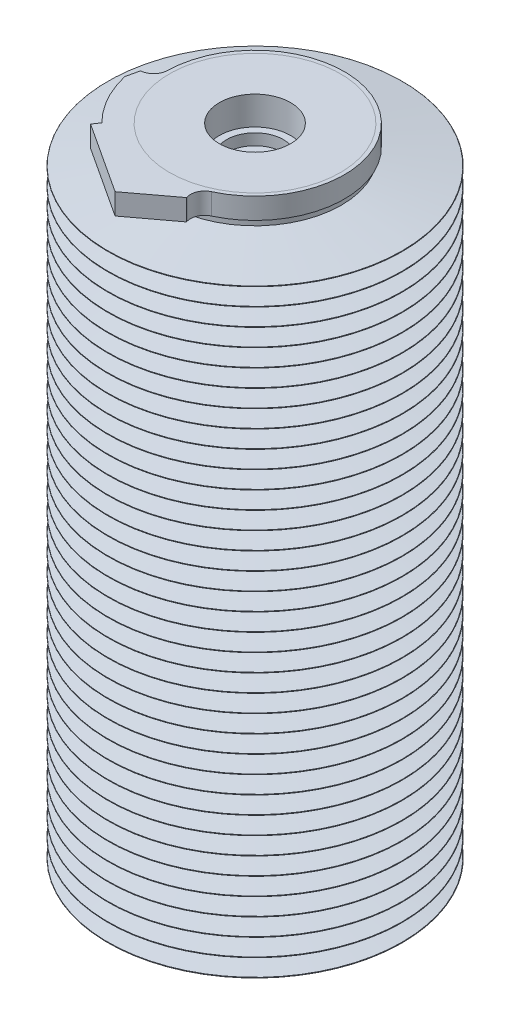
ISO-10303-21;
HEADER;
FILE_DESCRIPTION(('STEP AP214'),'2;1');
FILE_NAME('part.step','',(''),(''),'','','');
FILE_SCHEMA(('AUTOMOTIVE_DESIGN { 1 0 10303 214 1 1 1 1 }'));
ENDSEC;
DATA;
#1=APPLICATION_CONTEXT('core data for automotive mechanical design processes');
#2=APPLICATION_PROTOCOL_DEFINITION('international standard','automotive_design',2000,#1);
#3=PRODUCT_CONTEXT('',#1,'mechanical');
#4=PRODUCT('Part','Part','',(#3));
#5=PRODUCT_RELATED_PRODUCT_CATEGORY('part','',(#4));
#6=PRODUCT_DEFINITION_FORMATION('','',#4);
#7=PRODUCT_DEFINITION_CONTEXT('part definition',#1,'design');
#8=PRODUCT_DEFINITION('design','',#6,#7);
#9=PRODUCT_DEFINITION_SHAPE('','',#8);
#10=(LENGTH_UNIT() NAMED_UNIT(*) SI_UNIT(.MILLI.,.METRE.));
#11=(NAMED_UNIT(*) PLANE_ANGLE_UNIT() SI_UNIT($,.RADIAN.));
#12=(NAMED_UNIT(*) SI_UNIT($,.STERADIAN.) SOLID_ANGLE_UNIT());
#13=UNCERTAINTY_MEASURE_WITH_UNIT(LENGTH_MEASURE(1.E-05),#10,'distance_accuracy_value','');
#14=(GEOMETRIC_REPRESENTATION_CONTEXT(3) GLOBAL_UNCERTAINTY_ASSIGNED_CONTEXT((#13)) GLOBAL_UNIT_ASSIGNED_CONTEXT((#10,
#11,#12)) REPRESENTATION_CONTEXT('',''));
#15=CARTESIAN_POINT('',(0.,0.,0.));
#16=DIRECTION('',(0.,0.,1.));
#17=DIRECTION('',(1.,0.,0.));
#18=AXIS2_PLACEMENT_3D('',#15,#16,#17);
#19=CARTESIAN_POINT('',(-217.488494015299,-141.690817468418,0.));
#20=DIRECTION('',(0.,1.,0.));
#21=DIRECTION('',(1.,0.,0.));
#22=AXIS2_PLACEMENT_3D('',#19,#20,#21);
#23=PLANE('',#22);
#24=CARTESIAN_POINT('',(-217.488494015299,-141.690817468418,0.));
#25=DIRECTION('',(0.,1.,0.));
#26=DIRECTION('',(0.,0.,1.));
#27=AXIS2_PLACEMENT_3D('',#24,#25,#26);
#28=CIRCLE('',#27,15.875);
#29=CARTESIAN_POINT('',(-217.488494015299,-141.690817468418,15.875));
#30=VERTEX_POINT('',#29);
#31=EDGE_CURVE('E25',#30,#30,#28,.F.);
#32=ORIENTED_EDGE('',*,*,#31,.F.);
#33=EDGE_LOOP('',(#32));
#34=FACE_BOUND('',#33,.T.);
#35=CARTESIAN_POINT('',(-217.488494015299,-141.690817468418,0.));
#36=DIRECTION('',(0.,1.,0.));
#37=DIRECTION('',(0.,0.,1.));
#38=AXIS2_PLACEMENT_3D('',#35,#36,#37);
#39=CIRCLE('',#38,38.5064);
#40=CARTESIAN_POINT('',(-217.488494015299,-141.690817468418,38.5064));
#41=VERTEX_POINT('',#40);
#42=EDGE_CURVE('E11',#41,#41,#39,.F.);
#43=ORIENTED_EDGE('',*,*,#42,.T.);
#44=EDGE_LOOP('',(#43));
#45=FACE_BOUND('',#44,.T.);
#46=ADVANCED_FACE('F16',(#34,#45),#23,.F.);
#47=CARTESIAN_POINT('',(-217.488494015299,-132.292817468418,0.));
#48=DIRECTION('',(0.,1.,0.));
#49=DIRECTION('',(1.,0.,0.));
#50=AXIS2_PLACEMENT_3D('',#47,#48,#49);
#51=PLANE('',#50);
#52=CARTESIAN_POINT('',(-217.488494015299,-132.292817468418,0.));
#53=DIRECTION('',(0.,1.,0.));
#54=DIRECTION('',(0.,0.,1.));
#55=AXIS2_PLACEMENT_3D('',#52,#53,#54);
#56=CIRCLE('',#55,38.5064);
#57=CARTESIAN_POINT('',(-217.488494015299,-132.292817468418,38.5064));
#58=VERTEX_POINT('',#57);
#59=EDGE_CURVE('E168',#58,#58,#56,.F.);
#60=ORIENTED_EDGE('',*,*,#59,.T.);
#61=EDGE_LOOP('',(#60));
#62=FACE_BOUND('',#61,.T.);
#63=CARTESIAN_POINT('',(-217.488494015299,-132.292817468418,0.));
#64=DIRECTION('',(0.,1.,0.));
#65=DIRECTION('',(1.,0.,0.));
#66=AXIS2_PLACEMENT_3D('',#63,#64,#65);
#67=CIRCLE('',#66,48.26);
#68=CARTESIAN_POINT('',(-227.605030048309,-132.292817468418,-47.1877452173));
#69=VERTEX_POINT('',#68);
#70=CARTESIAN_POINT('',(-250.814600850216,-132.292817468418,-34.9055612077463));
#71=VERTEX_POINT('',#70);
#72=EDGE_CURVE('E192',#69,#71,#67,.T.);
#73=ORIENTED_EDGE('',*,*,#72,.T.);
#74=DIRECTION('',(-0.342020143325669,0.,0.939692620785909));
#75=VECTOR('',#74,1.);
#76=CARTESIAN_POINT('',(-250.814600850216,-132.292817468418,-34.9055612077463));
#77=LINE('',#76,#75);
#78=CARTESIAN_POINT('',(-252.803172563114,-132.292817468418,-29.4420053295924));
#79=VERTEX_POINT('',#78);
#80=EDGE_CURVE('E104',#71,#79,#77,.T.);
#81=ORIENTED_EDGE('',*,*,#80,.T.);
#82=DIRECTION('',(0.768081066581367,0.,0.640352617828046));
#83=VECTOR('',#82,1.);
#84=CARTESIAN_POINT('',(-252.60952936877,-132.292817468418,-29.2805641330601));
#85=LINE('',#84,#83);
#86=CARTESIAN_POINT('',(-252.60952936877,-132.292817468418,-29.2805641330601));
#87=VERTEX_POINT('',#86);
#88=EDGE_CURVE('E287',#79,#87,#85,.T.);
#89=ORIENTED_EDGE('',*,*,#88,.T.);
#90=CARTESIAN_POINT('',(-256.675768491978,-132.292817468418,-24.4032493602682));
#91=DIRECTION('',(0.,-1.,0.));
#92=DIRECTION('',(1.,0.,0.));
#93=AXIS2_PLACEMENT_3D('',#90,#91,#92);
#94=CIRCLE('',#93,6.34999999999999);
#95=CARTESIAN_POINT('',(-251.285496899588,-132.292817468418,-21.0465438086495));
#96=VERTEX_POINT('',#95);
#97=EDGE_CURVE('E299',#87,#96,#94,.T.);
#98=ORIENTED_EDGE('',*,*,#97,.T.);
#99=CARTESIAN_POINT('',(-217.488494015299,-132.292817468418,0.));
#100=DIRECTION('',(0.,1.,0.));
#101=DIRECTION('',(1.,0.,0.));
#102=AXIS2_PLACEMENT_3D('',#99,#100,#101);
#103=CIRCLE('',#102,39.8145);
#104=CARTESIAN_POINT('',(-183.691491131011,-132.292817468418,-21.0465438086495));
#105=VERTEX_POINT('',#104);
#106=EDGE_CURVE('E295',#96,#105,#103,.T.);
#107=ORIENTED_EDGE('',*,*,#106,.T.);
#108=CARTESIAN_POINT('',(-178.30121953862,-132.292817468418,-24.4032493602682));
#109=DIRECTION('',(0.,-1.,0.));
#110=DIRECTION('',(1.,0.,0.));
#111=AXIS2_PLACEMENT_3D('',#108,#109,#110);
#112=CIRCLE('',#111,6.35);
#113=CARTESIAN_POINT('',(-182.367458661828,-132.292817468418,-29.2805641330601));
#114=VERTEX_POINT('',#113);
#115=EDGE_CURVE('E298',#105,#114,#112,.T.);
#116=ORIENTED_EDGE('',*,*,#115,.T.);
#117=DIRECTION('',(0.768081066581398,0.,-0.640352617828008));
#118=VECTOR('',#117,1.);
#119=CARTESIAN_POINT('',(-182.367458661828,-132.292817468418,-29.2805641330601));
#120=LINE('',#119,#118);
#121=CARTESIAN_POINT('',(-182.173815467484,-132.292817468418,-29.4420053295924));
#122=VERTEX_POINT('',#121);
#123=EDGE_CURVE('E139',#114,#122,#120,.T.);
#124=ORIENTED_EDGE('',*,*,#123,.T.);
#125=DIRECTION('',(-0.342020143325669,0.,-0.939692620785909));
#126=VECTOR('',#125,1.);
#127=CARTESIAN_POINT('',(-189.947489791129,-132.292817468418,-50.8));
#128=LINE('',#127,#126);
#129=CARTESIAN_POINT('',(-189.947489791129,-132.292817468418,-50.8));
#130=VERTEX_POINT('',#129);
#131=EDGE_CURVE('E133',#122,#130,#128,.T.);
#132=ORIENTED_EDGE('',*,*,#131,.T.);
#133=DIRECTION('',(-1.,0.,0.));
#134=VECTOR('',#133,1.);
#135=CARTESIAN_POINT('',(-189.947489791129,-132.292817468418,-50.8));
#136=LINE('',#135,#134);
#137=CARTESIAN_POINT('',(-227.605030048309,-132.292817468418,-50.8));
#138=VERTEX_POINT('',#137);
#139=EDGE_CURVE('E137',#130,#138,#136,.T.);
#140=ORIENTED_EDGE('',*,*,#139,.T.);
#141=DIRECTION('',(0.,0.,1.));
#142=VECTOR('',#141,1.);
#143=CARTESIAN_POINT('',(-227.605030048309,-132.292817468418,-50.8));
#144=LINE('',#143,#142);
#145=EDGE_CURVE('E38',#138,#69,#144,.T.);
#146=ORIENTED_EDGE('',*,*,#145,.T.);
#147=EDGE_LOOP('',(#73,#81,#89,#98,#107,#116,#124,#132,#140,#146));
#148=FACE_BOUND('',#147,.T.);
#149=ADVANCED_FACE('F135',(#62,#148),#51,.T.);
#150=ORIENTED_EDGE('',*,*,#42,.F.);
#151=EDGE_LOOP('',(#150));
#152=FACE_BOUND('',#151,.T.);
#153=CARTESIAN_POINT('',(-217.488494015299,-141.690817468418,0.));
#154=DIRECTION('',(0.,1.,0.));
#155=DIRECTION('',(1.,0.,0.));
#156=AXIS2_PLACEMENT_3D('',#153,#154,#155);
#157=CIRCLE('',#156,48.26);
#158=CARTESIAN_POINT('',(-227.605030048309,-141.690817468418,-47.1877452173));
#159=VERTEX_POINT('',#158);
#160=CARTESIAN_POINT('',(-250.814600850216,-141.690817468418,-34.9055612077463));
#161=VERTEX_POINT('',#160);
#162=EDGE_CURVE('E163',#159,#161,#157,.T.);
#163=ORIENTED_EDGE('',*,*,#162,.F.);
#164=DIRECTION('',(0.,0.,1.));
#165=VECTOR('',#164,1.);
#166=CARTESIAN_POINT('',(-227.605030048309,-141.690817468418,-50.8));
#167=LINE('',#166,#165);
#168=CARTESIAN_POINT('',(-227.605030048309,-141.690817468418,-50.8));
#169=VERTEX_POINT('',#168);
#170=EDGE_CURVE('E93',#169,#159,#167,.T.);
#171=ORIENTED_EDGE('',*,*,#170,.F.);
#172=DIRECTION('',(-1.,0.,0.));
#173=VECTOR('',#172,1.);
#174=CARTESIAN_POINT('',(-189.947489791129,-141.690817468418,-50.8));
#175=LINE('',#174,#173);
#176=CARTESIAN_POINT('',(-189.947489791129,-141.690817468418,-50.8));
#177=VERTEX_POINT('',#176);
#178=EDGE_CURVE('E85',#177,#169,#175,.T.);
#179=ORIENTED_EDGE('',*,*,#178,.F.);
#180=DIRECTION('',(-0.342020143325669,0.,-0.939692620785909));
#181=VECTOR('',#180,1.);
#182=CARTESIAN_POINT('',(-189.947489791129,-141.690817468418,-50.8));
#183=LINE('',#182,#181);
#184=CARTESIAN_POINT('',(-182.173815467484,-141.690817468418,-29.4420053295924));
#185=VERTEX_POINT('',#184);
#186=EDGE_CURVE('E148',#185,#177,#183,.T.);
#187=ORIENTED_EDGE('',*,*,#186,.F.);
#188=DIRECTION('',(0.768081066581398,0.,-0.640352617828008));
#189=VECTOR('',#188,1.);
#190=CARTESIAN_POINT('',(-182.367458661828,-141.690817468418,-29.2805641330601));
#191=LINE('',#190,#189);
#192=CARTESIAN_POINT('',(-182.367458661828,-141.690817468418,-29.2805641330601));
#193=VERTEX_POINT('',#192);
#194=EDGE_CURVE('E183',#193,#185,#191,.T.);
#195=ORIENTED_EDGE('',*,*,#194,.F.);
#196=CARTESIAN_POINT('',(-178.30121953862,-141.690817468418,-24.4032493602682));
#197=DIRECTION('',(0.,-1.,0.));
#198=DIRECTION('',(1.,0.,0.));
#199=AXIS2_PLACEMENT_3D('',#196,#197,#198);
#200=CIRCLE('',#199,6.35);
#201=CARTESIAN_POINT('',(-183.691491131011,-141.690817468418,-21.0465438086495));
#202=VERTEX_POINT('',#201);
#203=EDGE_CURVE('E180',#202,#193,#200,.T.);
#204=ORIENTED_EDGE('',*,*,#203,.F.);
#205=CARTESIAN_POINT('',(-217.488494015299,-141.690817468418,0.));
#206=DIRECTION('',(0.,1.,0.));
#207=DIRECTION('',(1.,0.,0.));
#208=AXIS2_PLACEMENT_3D('',#205,#206,#207);
#209=CIRCLE('',#208,39.8145);
#210=CARTESIAN_POINT('',(-251.285496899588,-141.690817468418,-21.0465438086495));
#211=VERTEX_POINT('',#210);
#212=EDGE_CURVE('E177',#211,#202,#209,.T.);
#213=ORIENTED_EDGE('',*,*,#212,.F.);
#214=CARTESIAN_POINT('',(-256.675768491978,-141.690817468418,-24.4032493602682));
#215=DIRECTION('',(0.,-1.,0.));
#216=DIRECTION('',(1.,0.,0.));
#217=AXIS2_PLACEMENT_3D('',#214,#215,#216);
#218=CIRCLE('',#217,6.34999999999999);
#219=CARTESIAN_POINT('',(-252.60952936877,-141.690817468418,-29.2805641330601));
#220=VERTEX_POINT('',#219);
#221=EDGE_CURVE('E174',#220,#211,#218,.T.);
#222=ORIENTED_EDGE('',*,*,#221,.F.);
#223=DIRECTION('',(0.768081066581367,0.,0.640352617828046));
#224=VECTOR('',#223,1.);
#225=CARTESIAN_POINT('',(-252.60952936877,-141.690817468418,-29.2805641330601));
#226=LINE('',#225,#224);
#227=CARTESIAN_POINT('',(-252.803172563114,-141.690817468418,-29.4420053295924));
#228=VERTEX_POINT('',#227);
#229=EDGE_CURVE('E171',#228,#220,#226,.T.);
#230=ORIENTED_EDGE('',*,*,#229,.F.);
#231=DIRECTION('',(-0.342020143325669,0.,0.939692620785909));
#232=VECTOR('',#231,1.);
#233=CARTESIAN_POINT('',(-250.814600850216,-141.690817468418,-34.9055612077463));
#234=LINE('',#233,#232);
#235=EDGE_CURVE('E167',#161,#228,#234,.T.);
#236=ORIENTED_EDGE('',*,*,#235,.F.);
#237=EDGE_LOOP('',(#163,#171,#179,#187,#195,#204,#213,#222,#230,#236));
#238=FACE_BOUND('',#237,.T.);
#239=ADVANCED_FACE('F234',(#152,#238),#23,.F.);
#240=CARTESIAN_POINT('',(-217.488494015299,-132.292817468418,0.));
#241=DIRECTION('',(0.,-1.,0.));
#242=DIRECTION('',(-1.,0.,0.));
#243=AXIS2_PLACEMENT_3D('',#240,#241,#242);
#244=CYLINDRICAL_SURFACE('',#243,48.26);
#245=ORIENTED_EDGE('',*,*,#162,.T.);
#246=DIRECTION('',(0.,-1.,0.));
#247=VECTOR('',#246,1.);
#248=CARTESIAN_POINT('',(-250.814600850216,-132.292817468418,-34.9055612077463));
#249=LINE('',#248,#247);
#250=EDGE_CURVE('E219',#71,#161,#249,.T.);
#251=ORIENTED_EDGE('',*,*,#250,.F.);
#252=ORIENTED_EDGE('',*,*,#72,.F.);
#253=DIRECTION('',(0.,-1.,0.));
#254=VECTOR('',#253,1.);
#255=CARTESIAN_POINT('',(-227.605030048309,-132.292817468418,-47.1877452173));
#256=LINE('',#255,#254);
#257=EDGE_CURVE('E159',#69,#159,#256,.T.);
#258=ORIENTED_EDGE('',*,*,#257,.T.);
#259=EDGE_LOOP('',(#245,#251,#252,#258));
#260=FACE_BOUND('',#259,.T.);
#261=ADVANCED_FACE('F18',(#260),#244,.T.);
#262=CARTESIAN_POINT('',(-250.814600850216,-132.292817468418,-34.9055612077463));
#263=DIRECTION('',(0.939692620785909,0.,0.342020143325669));
#264=DIRECTION('',(0.342020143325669,0.,-0.939692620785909));
#265=AXIS2_PLACEMENT_3D('',#262,#263,#264);
#266=PLANE('',#265);
#267=ORIENTED_EDGE('',*,*,#235,.T.);
#268=DIRECTION('',(0.,-1.,0.));
#269=VECTOR('',#268,1.);
#270=CARTESIAN_POINT('',(-252.803172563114,-132.292817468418,-29.4420053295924));
#271=LINE('',#270,#269);
#272=EDGE_CURVE('E215',#79,#228,#271,.T.);
#273=ORIENTED_EDGE('',*,*,#272,.F.);
#274=ORIENTED_EDGE('',*,*,#80,.F.);
#275=ORIENTED_EDGE('',*,*,#250,.T.);
#276=EDGE_LOOP('',(#267,#273,#274,#275));
#277=FACE_BOUND('',#276,.T.);
#278=ADVANCED_FACE('F279',(#277),#266,.F.);
#279=CARTESIAN_POINT('',(-252.60952936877,-132.292817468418,-29.2805641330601));
#280=DIRECTION('',(0.640352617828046,0.,-0.768081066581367));
#281=DIRECTION('',(-0.768081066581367,0.,-0.640352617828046));
#282=AXIS2_PLACEMENT_3D('',#279,#280,#281);
#283=PLANE('',#282);
#284=ORIENTED_EDGE('',*,*,#229,.T.);
#285=DIRECTION('',(0.,-1.,0.));
#286=VECTOR('',#285,1.);
#287=CARTESIAN_POINT('',(-252.60952936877,-132.292817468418,-29.2805641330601));
#288=LINE('',#287,#286);
#289=EDGE_CURVE('E211',#87,#220,#288,.T.);
#290=ORIENTED_EDGE('',*,*,#289,.F.);
#291=ORIENTED_EDGE('',*,*,#88,.F.);
#292=ORIENTED_EDGE('',*,*,#272,.T.);
#293=EDGE_LOOP('',(#284,#290,#291,#292));
#294=FACE_BOUND('',#293,.T.);
#295=ADVANCED_FACE('F276',(#294),#283,.F.);
#296=CARTESIAN_POINT('',(-256.675768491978,-132.292817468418,-24.4032493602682));
#297=DIRECTION('',(0.,-1.,0.));
#298=DIRECTION('',(-1.,0.,0.));
#299=AXIS2_PLACEMENT_3D('',#296,#297,#298);
#300=CYLINDRICAL_SURFACE('',#299,6.34999999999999);
#301=ORIENTED_EDGE('',*,*,#221,.T.);
#302=DIRECTION('',(0.,-1.,0.));
#303=VECTOR('',#302,1.);
#304=CARTESIAN_POINT('',(-251.285496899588,-132.292817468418,-21.0465438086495));
#305=LINE('',#304,#303);
#306=EDGE_CURVE('E207',#96,#211,#305,.T.);
#307=ORIENTED_EDGE('',*,*,#306,.F.);
#308=ORIENTED_EDGE('',*,*,#97,.F.);
#309=ORIENTED_EDGE('',*,*,#289,.T.);
#310=EDGE_LOOP('',(#301,#307,#308,#309));
#311=FACE_BOUND('',#310,.T.);
#312=ADVANCED_FACE('F272',(#311),#300,.F.);
#313=CARTESIAN_POINT('',(-217.488494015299,-132.292817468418,0.));
#314=DIRECTION('',(0.,-1.,0.));
#315=DIRECTION('',(-1.,0.,0.));
#316=AXIS2_PLACEMENT_3D('',#313,#314,#315);
#317=CYLINDRICAL_SURFACE('',#316,39.8145);
#318=ORIENTED_EDGE('',*,*,#212,.T.);
#319=DIRECTION('',(0.,-1.,0.));
#320=VECTOR('',#319,1.);
#321=CARTESIAN_POINT('',(-183.691491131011,-132.292817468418,-21.0465438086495));
#322=LINE('',#321,#320);
#323=EDGE_CURVE('E203',#105,#202,#322,.T.);
#324=ORIENTED_EDGE('',*,*,#323,.F.);
#325=ORIENTED_EDGE('',*,*,#106,.F.);
#326=ORIENTED_EDGE('',*,*,#306,.T.);
#327=EDGE_LOOP('',(#318,#324,#325,#326));
#328=FACE_BOUND('',#327,.T.);
#329=ADVANCED_FACE('F268',(#328),#317,.T.);
#330=CARTESIAN_POINT('',(-178.30121953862,-132.292817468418,-24.4032493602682));
#331=DIRECTION('',(0.,-1.,0.));
#332=DIRECTION('',(-1.,0.,0.));
#333=AXIS2_PLACEMENT_3D('',#330,#331,#332);
#334=CYLINDRICAL_SURFACE('',#333,6.35);
#335=ORIENTED_EDGE('',*,*,#203,.T.);
#336=DIRECTION('',(0.,-1.,0.));
#337=VECTOR('',#336,1.);
#338=CARTESIAN_POINT('',(-182.367458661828,-132.292817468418,-29.2805641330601));
#339=LINE('',#338,#337);
#340=EDGE_CURVE('E199',#114,#193,#339,.T.);
#341=ORIENTED_EDGE('',*,*,#340,.F.);
#342=ORIENTED_EDGE('',*,*,#115,.F.);
#343=ORIENTED_EDGE('',*,*,#323,.T.);
#344=EDGE_LOOP('',(#335,#341,#342,#343));
#345=FACE_BOUND('',#344,.T.);
#346=ADVANCED_FACE('F264',(#345),#334,.F.);
#347=CARTESIAN_POINT('',(-182.367458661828,-132.292817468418,-29.2805641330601));
#348=DIRECTION('',(-0.640352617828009,0.,-0.768081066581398));
#349=DIRECTION('',(-0.768081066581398,0.,0.640352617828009));
#350=AXIS2_PLACEMENT_3D('',#347,#348,#349);
#351=PLANE('',#350);
#352=ORIENTED_EDGE('',*,*,#194,.T.);
#353=DIRECTION('',(0.,-1.,0.));
#354=VECTOR('',#353,1.);
#355=CARTESIAN_POINT('',(-182.173815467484,-132.292817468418,-29.4420053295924));
#356=LINE('',#355,#354);
#357=EDGE_CURVE('E150',#122,#185,#356,.T.);
#358=ORIENTED_EDGE('',*,*,#357,.F.);
#359=ORIENTED_EDGE('',*,*,#123,.F.);
#360=ORIENTED_EDGE('',*,*,#340,.T.);
#361=EDGE_LOOP('',(#352,#358,#359,#360));
#362=FACE_BOUND('',#361,.T.);
#363=ADVANCED_FACE('F261',(#362),#351,.F.);
#364=CARTESIAN_POINT('',(-189.947489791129,-132.292817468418,-50.8));
#365=DIRECTION('',(-0.93969262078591,0.,0.342020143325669));
#366=DIRECTION('',(0.342020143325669,0.,0.93969262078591));
#367=AXIS2_PLACEMENT_3D('',#364,#365,#366);
#368=PLANE('',#367);
#369=ORIENTED_EDGE('',*,*,#186,.T.);
#370=DIRECTION('',(0.,-1.,0.));
#371=VECTOR('',#370,1.);
#372=CARTESIAN_POINT('',(-189.947489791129,-132.292817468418,-50.8));
#373=LINE('',#372,#371);
#374=EDGE_CURVE('E145',#130,#177,#373,.T.);
#375=ORIENTED_EDGE('',*,*,#374,.F.);
#376=ORIENTED_EDGE('',*,*,#131,.F.);
#377=ORIENTED_EDGE('',*,*,#357,.T.);
#378=EDGE_LOOP('',(#369,#375,#376,#377));
#379=FACE_BOUND('',#378,.T.);
#380=ADVANCED_FACE('F146',(#379),#368,.F.);
#381=CARTESIAN_POINT('',(-189.947489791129,-132.292817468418,-50.8));
#382=DIRECTION('',(0.,0.,1.));
#383=DIRECTION('',(1.,0.,0.));
#384=AXIS2_PLACEMENT_3D('',#381,#382,#383);
#385=PLANE('',#384);
#386=ORIENTED_EDGE('',*,*,#178,.T.);
#387=DIRECTION('',(0.,-1.,0.));
#388=VECTOR('',#387,1.);
#389=CARTESIAN_POINT('',(-227.605030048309,-132.292817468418,-50.8));
#390=LINE('',#389,#388);
#391=EDGE_CURVE('E151',#138,#169,#390,.T.);
#392=ORIENTED_EDGE('',*,*,#391,.F.);
#393=ORIENTED_EDGE('',*,*,#139,.F.);
#394=ORIENTED_EDGE('',*,*,#374,.T.);
#395=EDGE_LOOP('',(#386,#392,#393,#394));
#396=FACE_BOUND('',#395,.T.);
#397=ADVANCED_FACE('F153',(#396),#385,.F.);
#398=CARTESIAN_POINT('',(-227.605030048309,-132.292817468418,-50.8));
#399=DIRECTION('',(1.,0.,0.));
#400=DIRECTION('',(0.,0.,-1.));
#401=AXIS2_PLACEMENT_3D('',#398,#399,#400);
#402=PLANE('',#401);
#403=ORIENTED_EDGE('',*,*,#170,.T.);
#404=ORIENTED_EDGE('',*,*,#257,.F.);
#405=ORIENTED_EDGE('',*,*,#145,.F.);
#406=ORIENTED_EDGE('',*,*,#391,.T.);
#407=EDGE_LOOP('',(#403,#404,#405,#406));
#408=FACE_BOUND('',#407,.T.);
#409=ADVANCED_FACE('F244',(#408),#402,.F.);
#410=CARTESIAN_POINT('',(-217.488494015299,-153.120817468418,0.));
#411=DIRECTION('',(0.,-1.,0.));
#412=DIRECTION('',(0.,0.,-1.));
#413=AXIS2_PLACEMENT_3D('',#410,#411,#412);
#414=PLANE('',#413);
#415=CARTESIAN_POINT('',(-217.488494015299,-153.120817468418,0.));
#416=DIRECTION('',(0.,-1.,0.));
#417=DIRECTION('',(0.,0.,-1.));
#418=AXIS2_PLACEMENT_3D('',#415,#416,#417);
#419=CIRCLE('',#418,12.7);
#420=CARTESIAN_POINT('',(-217.488494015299,-153.120817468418,-12.7));
#421=VERTEX_POINT('',#420);
#422=EDGE_CURVE('E1189',#421,#421,#419,.T.);
#423=ORIENTED_EDGE('',*,*,#422,.F.);
#424=EDGE_LOOP('',(#423));
#425=FACE_BOUND('',#424,.T.);
#426=CARTESIAN_POINT('',(-217.488494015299,-153.120817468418,0.));
#427=DIRECTION('',(0.,-1.,0.));
#428=DIRECTION('',(0.,0.,-1.));
#429=AXIS2_PLACEMENT_3D('',#426,#427,#428);
#430=CIRCLE('',#429,15.24);
#431=CARTESIAN_POINT('',(-217.488494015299,-153.120817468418,-15.24));
#432=VERTEX_POINT('',#431);
#433=EDGE_CURVE('E990',#432,#432,#430,.T.);
#434=ORIENTED_EDGE('',*,*,#433,.T.);
#435=EDGE_LOOP('',(#434));
#436=FACE_BOUND('',#435,.T.);
#437=ADVANCED_FACE('F246',(#425,#436),#414,.T.);
#438=CARTESIAN_POINT('',(-217.488494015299,-153.120817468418,0.));
#439=DIRECTION('',(0.,1.,0.));
#440=DIRECTION('',(0.,0.,1.));
#441=AXIS2_PLACEMENT_3D('',#438,#439,#440);
#442=CONICAL_SURFACE('',#441,15.24,0.785398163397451);
#443=CARTESIAN_POINT('',(-217.488494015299,-152.485817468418,0.));
#444=DIRECTION('',(0.,-1.,0.));
#445=DIRECTION('',(0.,0.,-1.));
#446=AXIS2_PLACEMENT_3D('',#443,#444,#445);
#447=CIRCLE('',#446,15.875);
#448=CARTESIAN_POINT('',(-217.488494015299,-152.485817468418,-15.875));
#449=VERTEX_POINT('',#448);
#450=EDGE_CURVE('E986',#449,#449,#447,.F.);
#451=ORIENTED_EDGE('',*,*,#450,.F.);
#452=EDGE_LOOP('',(#451));
#453=FACE_BOUND('',#452,.T.);
#454=ORIENTED_EDGE('',*,*,#433,.F.);
#455=EDGE_LOOP('',(#454));
#456=FACE_BOUND('',#455,.T.);
#457=ADVANCED_FACE('F253',(#453,#456),#442,.T.);
#458=CARTESIAN_POINT('',(-217.488494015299,-153.120817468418,0.));
#459=DIRECTION('',(0.,1.,0.));
#460=DIRECTION('',(0.,0.,1.));
#461=AXIS2_PLACEMENT_3D('',#458,#459,#460);
#462=CYLINDRICAL_SURFACE('',#461,15.875);
#463=ORIENTED_EDGE('',*,*,#450,.T.);
#464=EDGE_LOOP('',(#463));
#465=FACE_BOUND('',#464,.T.);
#466=ORIENTED_EDGE('',*,*,#31,.T.);
#467=EDGE_LOOP('',(#466));
#468=FACE_BOUND('',#467,.T.);
#469=ADVANCED_FACE('F229',(#465,#468),#462,.T.);
#470=CARTESIAN_POINT('',(-217.488494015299,-57.354017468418,0.));
#471=DIRECTION('',(0.,1.,0.));
#472=DIRECTION('',(-0.697711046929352,0.,0.716379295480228));
#473=AXIS2_PLACEMENT_3D('',#470,#471,#472);
#474=CYLINDRICAL_SURFACE('',#473,38.5064000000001);
#475=CARTESIAN_POINT('',(-217.488494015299,148.913782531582,0.));
#476=DIRECTION('',(0.,-1.,0.));
#477=DIRECTION('',(0.,0.,-1.));
#478=AXIS2_PLACEMENT_3D('',#475,#476,#477);
#479=CIRCLE('',#478,38.5064000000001);
#480=CARTESIAN_POINT('',(-217.488494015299,148.913782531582,-38.5064000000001));
#481=VERTEX_POINT('',#480);
#482=EDGE_CURVE('E993',#481,#481,#479,.T.);
#483=ORIENTED_EDGE('',*,*,#482,.T.);
#484=EDGE_LOOP('',(#483));
#485=FACE_BOUND('',#484,.T.);
#486=CARTESIAN_POINT('',(-217.488494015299,145.907715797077,0.));
#487=DIRECTION('',(0.,1.,0.));
#488=DIRECTION('',(-0.697711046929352,0.,0.716379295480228));
#489=AXIS2_PLACEMENT_3D('',#486,#487,#488);
#490=CIRCLE('',#489,38.5064000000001);
#491=CARTESIAN_POINT('',(-244.35483467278,145.907715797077,27.5851877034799));
#492=VERTEX_POINT('',#491);
#493=EDGE_CURVE('E351',#492,#492,#490,.T.);
#494=ORIENTED_EDGE('',*,*,#493,.T.);
#495=EDGE_LOOP('',(#494));
#496=FACE_BOUND('',#495,.T.);
#497=ADVANCED_FACE('F1312',(#485,#496),#474,.T.);
#498=CARTESIAN_POINT('',(-217.488494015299,141.636848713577,0.));
#499=DIRECTION('',(0.,-1.,0.));
#500=DIRECTION('',(0.697711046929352,0.,-0.716379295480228));
#501=AXIS2_PLACEMENT_3D('',#498,#499,#500);
#502=CONICAL_SURFACE('',#501,66.3030675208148,1.4183418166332);
#503=CARTESIAN_POINT('',(-217.488494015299,141.762375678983,0.));
#504=DIRECTION('',(0.,1.,0.));
#505=DIRECTION('',(-0.697711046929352,0.,0.716379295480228));
#506=AXIS2_PLACEMENT_3D('',#503,#504,#505);
#507=CIRCLE('',#506,65.4860832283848);
#508=CARTESIAN_POINT('',(-263.178857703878,141.762375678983,46.9128741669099));
#509=VERTEX_POINT('',#508);
#510=EDGE_CURVE('E361',#509,#509,#507,.T.);
#511=ORIENTED_EDGE('',*,*,#510,.T.);
#512=EDGE_LOOP('',(#511));
#513=FACE_BOUND('',#512,.T.);
#514=ORIENTED_EDGE('',*,*,#493,.F.);
#515=EDGE_LOOP('',(#514));
#516=FACE_BOUND('',#515,.T.);
#517=ADVANCED_FACE('F1639',(#513,#516),#502,.T.);
#518=CARTESIAN_POINT('',(-217.488494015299,137.714708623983,0.));
#519=DIRECTION('',(0.,1.,0.));
#520=DIRECTION('',(-0.697711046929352,0.,0.716379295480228));
#521=AXIS2_PLACEMENT_3D('',#518,#519,#520);
#522=CONICAL_SURFACE('',#521,40.7760675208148,1.41834181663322);
#523=CARTESIAN_POINT('',(-217.488494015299,141.511321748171,0.));
#524=DIRECTION('',(0.,-1.,0.));
#525=DIRECTION('',(0.697711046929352,0.,-0.716379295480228));
#526=AXIS2_PLACEMENT_3D('',#523,#524,#525);
#527=CIRCLE('',#526,65.4860832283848);
#528=CARTESIAN_POINT('',(-171.79813032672,141.511321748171,-46.9128741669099));
#529=VERTEX_POINT('',#528);
#530=EDGE_CURVE('E364',#529,#529,#527,.T.);
#531=ORIENTED_EDGE('',*,*,#530,.T.);
#532=EDGE_LOOP('',(#531));
#533=FACE_BOUND('',#532,.T.);
#534=CARTESIAN_POINT('',(-217.488494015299,137.714708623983,0.));
#535=DIRECTION('',(0.,1.,0.));
#536=DIRECTION('',(-0.697711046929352,0.,0.716379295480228));
#537=AXIS2_PLACEMENT_3D('',#534,#535,#536);
#538=CIRCLE('',#537,40.7760675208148);
#539=CARTESIAN_POINT('',(-245.938406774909,137.714708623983,29.2111305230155));
#540=VERTEX_POINT('',#539);
#541=EDGE_CURVE('E356',#540,#540,#538,.T.);
#542=ORIENTED_EDGE('',*,*,#541,.T.);
#543=EDGE_LOOP('',(#542));
#544=FACE_BOUND('',#543,.T.);
#545=ADVANCED_FACE('F1650',(#533,#544),#522,.T.);
#546=CARTESIAN_POINT('',(-217.488494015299,133.792568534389,0.));
#547=DIRECTION('',(0.,-1.,0.));
#548=DIRECTION('',(0.697711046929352,0.,-0.716379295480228));
#549=AXIS2_PLACEMENT_3D('',#546,#547,#548);
#550=CONICAL_SURFACE('',#549,66.3030675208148,1.4183418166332);
#551=CARTESIAN_POINT('',(-217.488494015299,133.918095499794,0.));
#552=DIRECTION('',(0.,1.,0.));
#553=DIRECTION('',(-0.697711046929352,0.,0.716379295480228));
#554=AXIS2_PLACEMENT_3D('',#551,#552,#553);
#555=CIRCLE('',#554,65.4860832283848);
#556=CARTESIAN_POINT('',(-263.178857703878,133.918095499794,46.9128741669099));
#557=VERTEX_POINT('',#556);
#558=EDGE_CURVE('E380',#557,#557,#555,.T.);
#559=ORIENTED_EDGE('',*,*,#558,.T.);
#560=EDGE_LOOP('',(#559));
#561=FACE_BOUND('',#560,.T.);
#562=ORIENTED_EDGE('',*,*,#541,.F.);
#563=EDGE_LOOP('',(#562));
#564=FACE_BOUND('',#563,.T.);
#565=ADVANCED_FACE('F1661',(#561,#564),#550,.T.);
#566=CARTESIAN_POINT('',(-217.488494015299,129.870428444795,0.));
#567=DIRECTION('',(0.,1.,0.));
#568=DIRECTION('',(-0.697711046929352,0.,0.716379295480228));
#569=AXIS2_PLACEMENT_3D('',#566,#567,#568);
#570=CONICAL_SURFACE('',#569,40.7760675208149,1.41834181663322);
#571=CARTESIAN_POINT('',(-217.488494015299,133.667041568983,0.));
#572=DIRECTION('',(0.,-1.,0.));
#573=DIRECTION('',(0.697711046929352,0.,-0.716379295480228));
#574=AXIS2_PLACEMENT_3D('',#571,#572,#573);
#575=CIRCLE('',#574,65.4860832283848);
#576=CARTESIAN_POINT('',(-171.79813032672,133.667041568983,-46.9128741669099));
#577=VERTEX_POINT('',#576);
#578=EDGE_CURVE('E365',#577,#577,#575,.T.);
#579=ORIENTED_EDGE('',*,*,#578,.T.);
#580=EDGE_LOOP('',(#579));
#581=FACE_BOUND('',#580,.T.);
#582=CARTESIAN_POINT('',(-217.488494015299,129.870428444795,0.));
#583=DIRECTION('',(0.,1.,0.));
#584=DIRECTION('',(-0.697711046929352,0.,0.716379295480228));
#585=AXIS2_PLACEMENT_3D('',#582,#583,#584);
#586=CIRCLE('',#585,40.7760675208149);
#587=CARTESIAN_POINT('',(-245.938406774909,129.870428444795,29.2111305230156));
#588=VERTEX_POINT('',#587);
#589=EDGE_CURVE('E376',#588,#588,#586,.T.);
#590=ORIENTED_EDGE('',*,*,#589,.T.);
#591=EDGE_LOOP('',(#590));
#592=FACE_BOUND('',#591,.T.);
#593=ADVANCED_FACE('F1672',(#581,#592),#570,.T.);
#594=CARTESIAN_POINT('',(-217.488494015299,125.948288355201,0.));
#595=DIRECTION('',(0.,-1.,0.));
#596=DIRECTION('',(0.697711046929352,0.,-0.716379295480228));
#597=AXIS2_PLACEMENT_3D('',#594,#595,#596);
#598=CONICAL_SURFACE('',#597,66.3030675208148,1.4183418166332);
#599=CARTESIAN_POINT('',(-217.488494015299,126.073815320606,0.));
#600=DIRECTION('',(0.,1.,0.));
#601=DIRECTION('',(-0.697711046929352,0.,0.716379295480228));
#602=AXIS2_PLACEMENT_3D('',#599,#600,#601);
#603=CIRCLE('',#602,65.4860832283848);
#604=CARTESIAN_POINT('',(-263.178857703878,126.073815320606,46.9128741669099));
#605=VERTEX_POINT('',#604);
#606=EDGE_CURVE('E398',#605,#605,#603,.T.);
#607=ORIENTED_EDGE('',*,*,#606,.T.);
#608=EDGE_LOOP('',(#607));
#609=FACE_BOUND('',#608,.T.);
#610=ORIENTED_EDGE('',*,*,#589,.F.);
#611=EDGE_LOOP('',(#610));
#612=FACE_BOUND('',#611,.T.);
#613=ADVANCED_FACE('F1683',(#609,#612),#598,.T.);
#614=CARTESIAN_POINT('',(-217.488494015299,122.026148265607,0.));
#615=DIRECTION('',(0.,1.,0.));
#616=DIRECTION('',(-0.697711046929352,0.,0.716379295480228));
#617=AXIS2_PLACEMENT_3D('',#614,#615,#616);
#618=CONICAL_SURFACE('',#617,40.7760675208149,1.41834181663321);
#619=CARTESIAN_POINT('',(-217.488494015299,125.822761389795,0.));
#620=DIRECTION('',(0.,-1.,0.));
#621=DIRECTION('',(0.697711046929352,0.,-0.716379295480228));
#622=AXIS2_PLACEMENT_3D('',#619,#620,#621);
#623=CIRCLE('',#622,65.4860832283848);
#624=CARTESIAN_POINT('',(-171.79813032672,125.822761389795,-46.9128741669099));
#625=VERTEX_POINT('',#624);
#626=EDGE_CURVE('E383',#625,#625,#623,.T.);
#627=ORIENTED_EDGE('',*,*,#626,.T.);
#628=EDGE_LOOP('',(#627));
#629=FACE_BOUND('',#628,.T.);
#630=CARTESIAN_POINT('',(-217.488494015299,122.026148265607,0.));
#631=DIRECTION('',(0.,1.,0.));
#632=DIRECTION('',(-0.697711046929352,0.,0.716379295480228));
#633=AXIS2_PLACEMENT_3D('',#630,#631,#632);
#634=CIRCLE('',#633,40.7760675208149);
#635=CARTESIAN_POINT('',(-245.938406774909,122.026148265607,29.2111305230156));
#636=VERTEX_POINT('',#635);
#637=EDGE_CURVE('E394',#636,#636,#634,.T.);
#638=ORIENTED_EDGE('',*,*,#637,.T.);
#639=EDGE_LOOP('',(#638));
#640=FACE_BOUND('',#639,.T.);
#641=ADVANCED_FACE('F1694',(#629,#640),#618,.T.);
#642=CARTESIAN_POINT('',(-217.488494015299,118.104008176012,0.));
#643=DIRECTION('',(0.,-1.,0.));
#644=DIRECTION('',(0.697711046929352,0.,-0.716379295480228));
#645=AXIS2_PLACEMENT_3D('',#642,#643,#644);
#646=CONICAL_SURFACE('',#645,66.3030675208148,1.4183418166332);
#647=CARTESIAN_POINT('',(-217.488494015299,118.229535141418,0.));
#648=DIRECTION('',(0.,1.,0.));
#649=DIRECTION('',(-0.697711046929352,0.,0.716379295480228));
#650=AXIS2_PLACEMENT_3D('',#647,#648,#649);
#651=CIRCLE('',#650,65.4860832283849);
#652=CARTESIAN_POINT('',(-263.178857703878,118.229535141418,46.91287416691));
#653=VERTEX_POINT('',#652);
#654=EDGE_CURVE('E416',#653,#653,#651,.T.);
#655=ORIENTED_EDGE('',*,*,#654,.T.);
#656=EDGE_LOOP('',(#655));
#657=FACE_BOUND('',#656,.T.);
#658=ORIENTED_EDGE('',*,*,#637,.F.);
#659=EDGE_LOOP('',(#658));
#660=FACE_BOUND('',#659,.T.);
#661=ADVANCED_FACE('F1705',(#657,#660),#646,.T.);
#662=CARTESIAN_POINT('',(-217.488494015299,114.181868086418,0.));
#663=DIRECTION('',(0.,1.,0.));
#664=DIRECTION('',(-0.697711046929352,0.,0.716379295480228));
#665=AXIS2_PLACEMENT_3D('',#662,#663,#664);
#666=CONICAL_SURFACE('',#665,40.7760675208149,1.41834181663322);
#667=CARTESIAN_POINT('',(-217.488494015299,117.978481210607,0.));
#668=DIRECTION('',(0.,-1.,0.));
#669=DIRECTION('',(0.697711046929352,0.,-0.716379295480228));
#670=AXIS2_PLACEMENT_3D('',#667,#668,#669);
#671=CIRCLE('',#670,65.4860832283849);
#672=CARTESIAN_POINT('',(-171.79813032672,117.978481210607,-46.91287416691));
#673=VERTEX_POINT('',#672);
#674=EDGE_CURVE('E401',#673,#673,#671,.T.);
#675=ORIENTED_EDGE('',*,*,#674,.T.);
#676=EDGE_LOOP('',(#675));
#677=FACE_BOUND('',#676,.T.);
#678=CARTESIAN_POINT('',(-217.488494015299,114.181868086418,0.));
#679=DIRECTION('',(0.,1.,0.));
#680=DIRECTION('',(-0.697711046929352,0.,0.716379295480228));
#681=AXIS2_PLACEMENT_3D('',#678,#679,#680);
#682=CIRCLE('',#681,40.7760675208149);
#683=CARTESIAN_POINT('',(-245.938406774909,114.181868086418,29.2111305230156));
#684=VERTEX_POINT('',#683);
#685=EDGE_CURVE('E412',#684,#684,#682,.T.);
#686=ORIENTED_EDGE('',*,*,#685,.T.);
#687=EDGE_LOOP('',(#686));
#688=FACE_BOUND('',#687,.T.);
#689=ADVANCED_FACE('F1716',(#677,#688),#666,.T.);
#690=CARTESIAN_POINT('',(-217.488494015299,110.259727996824,0.));
#691=DIRECTION('',(0.,-1.,0.));
#692=DIRECTION('',(0.697711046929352,0.,-0.716379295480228));
#693=AXIS2_PLACEMENT_3D('',#690,#691,#692);
#694=CONICAL_SURFACE('',#693,66.3030675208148,1.4183418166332);
#695=CARTESIAN_POINT('',(-217.488494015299,110.38525496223,0.));
#696=DIRECTION('',(0.,1.,0.));
#697=DIRECTION('',(-0.697711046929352,0.,0.716379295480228));
#698=AXIS2_PLACEMENT_3D('',#695,#696,#697);
#699=CIRCLE('',#698,65.4860832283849);
#700=CARTESIAN_POINT('',(-263.178857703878,110.38525496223,46.91287416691));
#701=VERTEX_POINT('',#700);
#702=EDGE_CURVE('E434',#701,#701,#699,.T.);
#703=ORIENTED_EDGE('',*,*,#702,.T.);
#704=EDGE_LOOP('',(#703));
#705=FACE_BOUND('',#704,.T.);
#706=ORIENTED_EDGE('',*,*,#685,.F.);
#707=EDGE_LOOP('',(#706));
#708=FACE_BOUND('',#707,.T.);
#709=ADVANCED_FACE('F1727',(#705,#708),#694,.T.);
#710=CARTESIAN_POINT('',(-217.488494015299,106.33758790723,0.));
#711=DIRECTION('',(0.,1.,0.));
#712=DIRECTION('',(-0.697711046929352,0.,0.716379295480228));
#713=AXIS2_PLACEMENT_3D('',#710,#711,#712);
#714=CONICAL_SURFACE('',#713,40.7760675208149,1.41834181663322);
#715=CARTESIAN_POINT('',(-217.488494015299,110.134201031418,0.));
#716=DIRECTION('',(0.,-1.,0.));
#717=DIRECTION('',(0.697711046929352,0.,-0.716379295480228));
#718=AXIS2_PLACEMENT_3D('',#715,#716,#717);
#719=CIRCLE('',#718,65.4860832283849);
#720=CARTESIAN_POINT('',(-171.79813032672,110.134201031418,-46.91287416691));
#721=VERTEX_POINT('',#720);
#722=EDGE_CURVE('E419',#721,#721,#719,.T.);
#723=ORIENTED_EDGE('',*,*,#722,.T.);
#724=EDGE_LOOP('',(#723));
#725=FACE_BOUND('',#724,.T.);
#726=CARTESIAN_POINT('',(-217.488494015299,106.33758790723,0.));
#727=DIRECTION('',(0.,1.,0.));
#728=DIRECTION('',(-0.697711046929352,0.,0.716379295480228));
#729=AXIS2_PLACEMENT_3D('',#726,#727,#728);
#730=CIRCLE('',#729,40.7760675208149);
#731=CARTESIAN_POINT('',(-245.938406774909,106.33758790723,29.2111305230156));
#732=VERTEX_POINT('',#731);
#733=EDGE_CURVE('E430',#732,#732,#730,.T.);
#734=ORIENTED_EDGE('',*,*,#733,.T.);
#735=EDGE_LOOP('',(#734));
#736=FACE_BOUND('',#735,.T.);
#737=ADVANCED_FACE('F1738',(#725,#736),#714,.T.);
#738=CARTESIAN_POINT('',(-217.488494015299,102.415447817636,0.));
#739=DIRECTION('',(0.,-1.,0.));
#740=DIRECTION('',(0.697711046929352,0.,-0.716379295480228));
#741=AXIS2_PLACEMENT_3D('',#738,#739,#740);
#742=CONICAL_SURFACE('',#741,66.3030675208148,1.4183418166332);
#743=CARTESIAN_POINT('',(-217.488494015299,102.540974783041,0.));
#744=DIRECTION('',(0.,1.,0.));
#745=DIRECTION('',(-0.697711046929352,0.,0.716379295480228));
#746=AXIS2_PLACEMENT_3D('',#743,#744,#745);
#747=CIRCLE('',#746,65.4860832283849);
#748=CARTESIAN_POINT('',(-263.178857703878,102.540974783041,46.91287416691));
#749=VERTEX_POINT('',#748);
#750=EDGE_CURVE('E452',#749,#749,#747,.T.);
#751=ORIENTED_EDGE('',*,*,#750,.T.);
#752=EDGE_LOOP('',(#751));
#753=FACE_BOUND('',#752,.T.);
#754=ORIENTED_EDGE('',*,*,#733,.F.);
#755=EDGE_LOOP('',(#754));
#756=FACE_BOUND('',#755,.T.);
#757=ADVANCED_FACE('F1749',(#753,#756),#742,.T.);
#758=CARTESIAN_POINT('',(-217.488494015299,98.4933077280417,0.));
#759=DIRECTION('',(0.,1.,0.));
#760=DIRECTION('',(-0.697711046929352,0.,0.716379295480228));
#761=AXIS2_PLACEMENT_3D('',#758,#759,#760);
#762=CONICAL_SURFACE('',#761,40.7760675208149,1.41834181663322);
#763=CARTESIAN_POINT('',(-217.488494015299,102.28992085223,0.));
#764=DIRECTION('',(0.,-1.,0.));
#765=DIRECTION('',(0.697711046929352,0.,-0.716379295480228));
#766=AXIS2_PLACEMENT_3D('',#763,#764,#765);
#767=CIRCLE('',#766,65.4860832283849);
#768=CARTESIAN_POINT('',(-171.79813032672,102.28992085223,-46.91287416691));
#769=VERTEX_POINT('',#768);
#770=EDGE_CURVE('E437',#769,#769,#767,.T.);
#771=ORIENTED_EDGE('',*,*,#770,.T.);
#772=EDGE_LOOP('',(#771));
#773=FACE_BOUND('',#772,.T.);
#774=CARTESIAN_POINT('',(-217.488494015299,98.4933077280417,0.));
#775=DIRECTION('',(0.,1.,0.));
#776=DIRECTION('',(-0.697711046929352,0.,0.716379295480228));
#777=AXIS2_PLACEMENT_3D('',#774,#775,#776);
#778=CIRCLE('',#777,40.7760675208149);
#779=CARTESIAN_POINT('',(-245.938406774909,98.4933077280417,29.2111305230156));
#780=VERTEX_POINT('',#779);
#781=EDGE_CURVE('E448',#780,#780,#778,.T.);
#782=ORIENTED_EDGE('',*,*,#781,.T.);
#783=EDGE_LOOP('',(#782));
#784=FACE_BOUND('',#783,.T.);
#785=ADVANCED_FACE('F1760',(#773,#784),#762,.T.);
#786=CARTESIAN_POINT('',(-217.488494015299,94.5711676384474,0.));
#787=DIRECTION('',(0.,-1.,0.));
#788=DIRECTION('',(0.697711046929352,0.,-0.716379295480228));
#789=AXIS2_PLACEMENT_3D('',#786,#787,#788);
#790=CONICAL_SURFACE('',#789,66.3030675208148,1.4183418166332);
#791=CARTESIAN_POINT('',(-217.488494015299,94.696694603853,0.));
#792=DIRECTION('',(0.,1.,0.));
#793=DIRECTION('',(-0.697711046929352,0.,0.716379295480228));
#794=AXIS2_PLACEMENT_3D('',#791,#792,#793);
#795=CIRCLE('',#794,65.4860832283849);
#796=CARTESIAN_POINT('',(-263.178857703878,94.696694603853,46.9128741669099));
#797=VERTEX_POINT('',#796);
#798=EDGE_CURVE('E470',#797,#797,#795,.T.);
#799=ORIENTED_EDGE('',*,*,#798,.T.);
#800=EDGE_LOOP('',(#799));
#801=FACE_BOUND('',#800,.T.);
#802=ORIENTED_EDGE('',*,*,#781,.F.);
#803=EDGE_LOOP('',(#802));
#804=FACE_BOUND('',#803,.T.);
#805=ADVANCED_FACE('F1771',(#801,#804),#790,.T.);
#806=CARTESIAN_POINT('',(-217.488494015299,90.6490275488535,0.));
#807=DIRECTION('',(0.,1.,0.));
#808=DIRECTION('',(-0.697711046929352,0.,0.716379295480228));
#809=AXIS2_PLACEMENT_3D('',#806,#807,#808);
#810=CONICAL_SURFACE('',#809,40.7760675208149,1.41834181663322);
#811=CARTESIAN_POINT('',(-217.488494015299,94.4456406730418,0.));
#812=DIRECTION('',(0.,-1.,0.));
#813=DIRECTION('',(0.697711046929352,0.,-0.716379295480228));
#814=AXIS2_PLACEMENT_3D('',#811,#812,#813);
#815=CIRCLE('',#814,65.4860832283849);
#816=CARTESIAN_POINT('',(-171.79813032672,94.4456406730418,-46.91287416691));
#817=VERTEX_POINT('',#816);
#818=EDGE_CURVE('E455',#817,#817,#815,.T.);
#819=ORIENTED_EDGE('',*,*,#818,.T.);
#820=EDGE_LOOP('',(#819));
#821=FACE_BOUND('',#820,.T.);
#822=CARTESIAN_POINT('',(-217.488494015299,90.6490275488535,0.));
#823=DIRECTION('',(0.,1.,0.));
#824=DIRECTION('',(-0.697711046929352,0.,0.716379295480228));
#825=AXIS2_PLACEMENT_3D('',#822,#823,#824);
#826=CIRCLE('',#825,40.7760675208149);
#827=CARTESIAN_POINT('',(-245.938406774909,90.6490275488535,29.2111305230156));
#828=VERTEX_POINT('',#827);
#829=EDGE_CURVE('E466',#828,#828,#826,.T.);
#830=ORIENTED_EDGE('',*,*,#829,.T.);
#831=EDGE_LOOP('',(#830));
#832=FACE_BOUND('',#831,.T.);
#833=ADVANCED_FACE('F1782',(#821,#832),#810,.T.);
#834=CARTESIAN_POINT('',(-217.488494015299,86.7268874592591,0.));
#835=DIRECTION('',(0.,-1.,0.));
#836=DIRECTION('',(0.697711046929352,0.,-0.716379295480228));
#837=AXIS2_PLACEMENT_3D('',#834,#835,#836);
#838=CONICAL_SURFACE('',#837,66.3030675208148,1.4183418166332);
#839=CARTESIAN_POINT('',(-217.488494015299,86.8524144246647,0.));
#840=DIRECTION('',(0.,1.,0.));
#841=DIRECTION('',(-0.697711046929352,0.,0.716379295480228));
#842=AXIS2_PLACEMENT_3D('',#839,#840,#841);
#843=CIRCLE('',#842,65.4860832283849);
#844=CARTESIAN_POINT('',(-263.178857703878,86.8524144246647,46.91287416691));
#845=VERTEX_POINT('',#844);
#846=EDGE_CURVE('E488',#845,#845,#843,.T.);
#847=ORIENTED_EDGE('',*,*,#846,.T.);
#848=EDGE_LOOP('',(#847));
#849=FACE_BOUND('',#848,.T.);
#850=ORIENTED_EDGE('',*,*,#829,.F.);
#851=EDGE_LOOP('',(#850));
#852=FACE_BOUND('',#851,.T.);
#853=ADVANCED_FACE('F1793',(#849,#852),#838,.T.);
#854=CARTESIAN_POINT('',(-217.488494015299,82.8047473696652,0.));
#855=DIRECTION('',(0.,1.,0.));
#856=DIRECTION('',(-0.697711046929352,0.,0.716379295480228));
#857=AXIS2_PLACEMENT_3D('',#854,#855,#856);
#858=CONICAL_SURFACE('',#857,40.7760675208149,1.41834181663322);
#859=CARTESIAN_POINT('',(-217.488494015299,86.6013604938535,0.));
#860=DIRECTION('',(0.,-1.,0.));
#861=DIRECTION('',(0.697711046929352,0.,-0.716379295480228));
#862=AXIS2_PLACEMENT_3D('',#859,#860,#861);
#863=CIRCLE('',#862,65.4860832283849);
#864=CARTESIAN_POINT('',(-171.79813032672,86.6013604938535,-46.9128741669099));
#865=VERTEX_POINT('',#864);
#866=EDGE_CURVE('E473',#865,#865,#863,.T.);
#867=ORIENTED_EDGE('',*,*,#866,.T.);
#868=EDGE_LOOP('',(#867));
#869=FACE_BOUND('',#868,.T.);
#870=CARTESIAN_POINT('',(-217.488494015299,82.8047473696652,0.));
#871=DIRECTION('',(0.,1.,0.));
#872=DIRECTION('',(-0.697711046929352,0.,0.716379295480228));
#873=AXIS2_PLACEMENT_3D('',#870,#871,#872);
#874=CIRCLE('',#873,40.7760675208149);
#875=CARTESIAN_POINT('',(-245.938406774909,82.8047473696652,29.2111305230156));
#876=VERTEX_POINT('',#875);
#877=EDGE_CURVE('E484',#876,#876,#874,.T.);
#878=ORIENTED_EDGE('',*,*,#877,.T.);
#879=EDGE_LOOP('',(#878));
#880=FACE_BOUND('',#879,.T.);
#881=ADVANCED_FACE('F1804',(#869,#880),#858,.T.);
#882=CARTESIAN_POINT('',(-217.488494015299,78.8826072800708,0.));
#883=DIRECTION('',(0.,-1.,0.));
#884=DIRECTION('',(0.697711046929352,0.,-0.716379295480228));
#885=AXIS2_PLACEMENT_3D('',#882,#883,#884);
#886=CONICAL_SURFACE('',#885,66.3030675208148,1.4183418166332);
#887=CARTESIAN_POINT('',(-217.488494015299,79.0081342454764,0.));
#888=DIRECTION('',(0.,1.,0.));
#889=DIRECTION('',(-0.697711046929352,0.,0.716379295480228));
#890=AXIS2_PLACEMENT_3D('',#887,#888,#889);
#891=CIRCLE('',#890,65.4860832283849);
#892=CARTESIAN_POINT('',(-263.178857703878,79.0081342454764,46.91287416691));
#893=VERTEX_POINT('',#892);
#894=EDGE_CURVE('E506',#893,#893,#891,.T.);
#895=ORIENTED_EDGE('',*,*,#894,.T.);
#896=EDGE_LOOP('',(#895));
#897=FACE_BOUND('',#896,.T.);
#898=ORIENTED_EDGE('',*,*,#877,.F.);
#899=EDGE_LOOP('',(#898));
#900=FACE_BOUND('',#899,.T.);
#901=ADVANCED_FACE('F1815',(#897,#900),#886,.T.);
#902=CARTESIAN_POINT('',(-217.488494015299,74.9604671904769,0.));
#903=DIRECTION('',(0.,1.,0.));
#904=DIRECTION('',(-0.697711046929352,0.,0.716379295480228));
#905=AXIS2_PLACEMENT_3D('',#902,#903,#904);
#906=CONICAL_SURFACE('',#905,40.7760675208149,1.41834181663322);
#907=CARTESIAN_POINT('',(-217.488494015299,78.7570803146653,0.));
#908=DIRECTION('',(0.,-1.,0.));
#909=DIRECTION('',(0.697711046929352,0.,-0.716379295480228));
#910=AXIS2_PLACEMENT_3D('',#907,#908,#909);
#911=CIRCLE('',#910,65.4860832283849);
#912=CARTESIAN_POINT('',(-171.79813032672,78.7570803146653,-46.91287416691));
#913=VERTEX_POINT('',#912);
#914=EDGE_CURVE('E491',#913,#913,#911,.T.);
#915=ORIENTED_EDGE('',*,*,#914,.T.);
#916=EDGE_LOOP('',(#915));
#917=FACE_BOUND('',#916,.T.);
#918=CARTESIAN_POINT('',(-217.488494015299,74.9604671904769,0.));
#919=DIRECTION('',(0.,1.,0.));
#920=DIRECTION('',(-0.697711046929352,0.,0.716379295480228));
#921=AXIS2_PLACEMENT_3D('',#918,#919,#920);
#922=CIRCLE('',#921,40.7760675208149);
#923=CARTESIAN_POINT('',(-245.938406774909,74.9604671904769,29.2111305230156));
#924=VERTEX_POINT('',#923);
#925=EDGE_CURVE('E502',#924,#924,#922,.T.);
#926=ORIENTED_EDGE('',*,*,#925,.T.);
#927=EDGE_LOOP('',(#926));
#928=FACE_BOUND('',#927,.T.);
#929=ADVANCED_FACE('F1826',(#917,#928),#906,.T.);
#930=CARTESIAN_POINT('',(-217.488494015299,71.0383271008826,0.));
#931=DIRECTION('',(0.,-1.,0.));
#932=DIRECTION('',(0.697711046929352,0.,-0.716379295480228));
#933=AXIS2_PLACEMENT_3D('',#930,#931,#932);
#934=CONICAL_SURFACE('',#933,66.3030675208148,1.4183418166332);
#935=CARTESIAN_POINT('',(-217.488494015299,71.1638540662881,0.));
#936=DIRECTION('',(0.,1.,0.));
#937=DIRECTION('',(-0.697711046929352,0.,0.716379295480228));
#938=AXIS2_PLACEMENT_3D('',#935,#936,#937);
#939=CIRCLE('',#938,65.4860832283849);
#940=CARTESIAN_POINT('',(-263.178857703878,71.1638540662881,46.91287416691));
#941=VERTEX_POINT('',#940);
#942=EDGE_CURVE('E524',#941,#941,#939,.T.);
#943=ORIENTED_EDGE('',*,*,#942,.T.);
#944=EDGE_LOOP('',(#943));
#945=FACE_BOUND('',#944,.T.);
#946=ORIENTED_EDGE('',*,*,#925,.F.);
#947=EDGE_LOOP('',(#946));
#948=FACE_BOUND('',#947,.T.);
#949=ADVANCED_FACE('F1837',(#945,#948),#934,.T.);
#950=CARTESIAN_POINT('',(-217.488494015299,67.1161870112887,0.));
#951=DIRECTION('',(0.,1.,0.));
#952=DIRECTION('',(-0.697711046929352,0.,0.716379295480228));
#953=AXIS2_PLACEMENT_3D('',#950,#951,#952);
#954=CONICAL_SURFACE('',#953,40.7760675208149,1.41834181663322);
#955=CARTESIAN_POINT('',(-217.488494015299,70.912800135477,0.));
#956=DIRECTION('',(0.,-1.,0.));
#957=DIRECTION('',(0.697711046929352,0.,-0.716379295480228));
#958=AXIS2_PLACEMENT_3D('',#955,#956,#957);
#959=CIRCLE('',#958,65.4860832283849);
#960=CARTESIAN_POINT('',(-171.79813032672,70.912800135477,-46.91287416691));
#961=VERTEX_POINT('',#960);
#962=EDGE_CURVE('E509',#961,#961,#959,.T.);
#963=ORIENTED_EDGE('',*,*,#962,.T.);
#964=EDGE_LOOP('',(#963));
#965=FACE_BOUND('',#964,.T.);
#966=CARTESIAN_POINT('',(-217.488494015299,67.1161870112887,0.));
#967=DIRECTION('',(0.,1.,0.));
#968=DIRECTION('',(-0.697711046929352,0.,0.716379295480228));
#969=AXIS2_PLACEMENT_3D('',#966,#967,#968);
#970=CIRCLE('',#969,40.7760675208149);
#971=CARTESIAN_POINT('',(-245.938406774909,67.1161870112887,29.2111305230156));
#972=VERTEX_POINT('',#971);
#973=EDGE_CURVE('E520',#972,#972,#970,.T.);
#974=ORIENTED_EDGE('',*,*,#973,.T.);
#975=EDGE_LOOP('',(#974));
#976=FACE_BOUND('',#975,.T.);
#977=ADVANCED_FACE('F1848',(#965,#976),#954,.T.);
#978=CARTESIAN_POINT('',(-217.488494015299,63.1940469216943,0.));
#979=DIRECTION('',(0.,-1.,0.));
#980=DIRECTION('',(0.697711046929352,0.,-0.716379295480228));
#981=AXIS2_PLACEMENT_3D('',#978,#979,#980);
#982=CONICAL_SURFACE('',#981,66.3030675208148,1.4183418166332);
#983=CARTESIAN_POINT('',(-217.488494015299,63.3195738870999,0.));
#984=DIRECTION('',(0.,1.,0.));
#985=DIRECTION('',(-0.697711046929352,0.,0.716379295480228));
#986=AXIS2_PLACEMENT_3D('',#983,#984,#985);
#987=CIRCLE('',#986,65.4860832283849);
#988=CARTESIAN_POINT('',(-263.178857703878,63.3195738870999,46.9128741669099));
#989=VERTEX_POINT('',#988);
#990=EDGE_CURVE('E542',#989,#989,#987,.T.);
#991=ORIENTED_EDGE('',*,*,#990,.T.);
#992=EDGE_LOOP('',(#991));
#993=FACE_BOUND('',#992,.T.);
#994=ORIENTED_EDGE('',*,*,#973,.F.);
#995=EDGE_LOOP('',(#994));
#996=FACE_BOUND('',#995,.T.);
#997=ADVANCED_FACE('F1859',(#993,#996),#982,.T.);
#998=CARTESIAN_POINT('',(-217.488494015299,59.2719068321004,0.));
#999=DIRECTION('',(0.,1.,0.));
#1000=DIRECTION('',(-0.697711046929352,0.,0.716379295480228));
#1001=AXIS2_PLACEMENT_3D('',#998,#999,#1000);
#1002=CONICAL_SURFACE('',#1001,40.7760675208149,1.41834181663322);
#1003=CARTESIAN_POINT('',(-217.488494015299,63.0685199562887,0.));
#1004=DIRECTION('',(0.,-1.,0.));
#1005=DIRECTION('',(0.697711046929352,0.,-0.716379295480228));
#1006=AXIS2_PLACEMENT_3D('',#1003,#1004,#1005);
#1007=CIRCLE('',#1006,65.4860832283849);
#1008=CARTESIAN_POINT('',(-171.79813032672,63.0685199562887,-46.9128741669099));
#1009=VERTEX_POINT('',#1008);
#1010=EDGE_CURVE('E527',#1009,#1009,#1007,.T.);
#1011=ORIENTED_EDGE('',*,*,#1010,.T.);
#1012=EDGE_LOOP('',(#1011));
#1013=FACE_BOUND('',#1012,.T.);
#1014=CARTESIAN_POINT('',(-217.488494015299,59.2719068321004,0.));
#1015=DIRECTION('',(0.,1.,0.));
#1016=DIRECTION('',(-0.697711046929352,0.,0.716379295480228));
#1017=AXIS2_PLACEMENT_3D('',#1014,#1015,#1016);
#1018=CIRCLE('',#1017,40.7760675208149);
#1019=CARTESIAN_POINT('',(-245.938406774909,59.2719068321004,29.2111305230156));
#1020=VERTEX_POINT('',#1019);
#1021=EDGE_CURVE('E538',#1020,#1020,#1018,.T.);
#1022=ORIENTED_EDGE('',*,*,#1021,.T.);
#1023=EDGE_LOOP('',(#1022));
#1024=FACE_BOUND('',#1023,.T.);
#1025=ADVANCED_FACE('F1870',(#1013,#1024),#1002,.T.);
#1026=CARTESIAN_POINT('',(-217.488494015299,55.349766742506,0.));
#1027=DIRECTION('',(0.,-1.,0.));
#1028=DIRECTION('',(0.697711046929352,0.,-0.716379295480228));
#1029=AXIS2_PLACEMENT_3D('',#1026,#1027,#1028);
#1030=CONICAL_SURFACE('',#1029,66.3030675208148,1.4183418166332);
#1031=CARTESIAN_POINT('',(-217.488494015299,55.4752937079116,0.));
#1032=DIRECTION('',(0.,1.,0.));
#1033=DIRECTION('',(-0.697711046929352,0.,0.716379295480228));
#1034=AXIS2_PLACEMENT_3D('',#1031,#1032,#1033);
#1035=CIRCLE('',#1034,65.4860832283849);
#1036=CARTESIAN_POINT('',(-263.178857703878,55.4752937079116,46.91287416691));
#1037=VERTEX_POINT('',#1036);
#1038=EDGE_CURVE('E560',#1037,#1037,#1035,.T.);
#1039=ORIENTED_EDGE('',*,*,#1038,.T.);
#1040=EDGE_LOOP('',(#1039));
#1041=FACE_BOUND('',#1040,.T.);
#1042=ORIENTED_EDGE('',*,*,#1021,.F.);
#1043=EDGE_LOOP('',(#1042));
#1044=FACE_BOUND('',#1043,.T.);
#1045=ADVANCED_FACE('F1881',(#1041,#1044),#1030,.T.);
#1046=CARTESIAN_POINT('',(-217.488494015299,51.4276266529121,0.));
#1047=DIRECTION('',(0.,1.,0.));
#1048=DIRECTION('',(-0.697711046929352,0.,0.716379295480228));
#1049=AXIS2_PLACEMENT_3D('',#1046,#1047,#1048);
#1050=CONICAL_SURFACE('',#1049,40.7760675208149,1.41834181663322);
#1051=CARTESIAN_POINT('',(-217.488494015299,55.2242397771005,0.));
#1052=DIRECTION('',(0.,-1.,0.));
#1053=DIRECTION('',(0.697711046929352,0.,-0.716379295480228));
#1054=AXIS2_PLACEMENT_3D('',#1051,#1052,#1053);
#1055=CIRCLE('',#1054,65.4860832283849);
#1056=CARTESIAN_POINT('',(-171.79813032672,55.2242397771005,-46.91287416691));
#1057=VERTEX_POINT('',#1056);
#1058=EDGE_CURVE('E545',#1057,#1057,#1055,.T.);
#1059=ORIENTED_EDGE('',*,*,#1058,.T.);
#1060=EDGE_LOOP('',(#1059));
#1061=FACE_BOUND('',#1060,.T.);
#1062=CARTESIAN_POINT('',(-217.488494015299,51.4276266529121,0.));
#1063=DIRECTION('',(0.,1.,0.));
#1064=DIRECTION('',(-0.697711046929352,0.,0.716379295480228));
#1065=AXIS2_PLACEMENT_3D('',#1062,#1063,#1064);
#1066=CIRCLE('',#1065,40.7760675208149);
#1067=CARTESIAN_POINT('',(-245.938406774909,51.4276266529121,29.2111305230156));
#1068=VERTEX_POINT('',#1067);
#1069=EDGE_CURVE('E556',#1068,#1068,#1066,.T.);
#1070=ORIENTED_EDGE('',*,*,#1069,.T.);
#1071=EDGE_LOOP('',(#1070));
#1072=FACE_BOUND('',#1071,.T.);
#1073=ADVANCED_FACE('F1892',(#1061,#1072),#1050,.T.);
#1074=CARTESIAN_POINT('',(-217.488494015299,47.5054865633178,0.));
#1075=DIRECTION('',(0.,-1.,0.));
#1076=DIRECTION('',(0.697711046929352,0.,-0.716379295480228));
#1077=AXIS2_PLACEMENT_3D('',#1074,#1075,#1076);
#1078=CONICAL_SURFACE('',#1077,66.3030675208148,1.4183418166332);
#1079=CARTESIAN_POINT('',(-217.488494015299,47.6310135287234,0.));
#1080=DIRECTION('',(0.,1.,0.));
#1081=DIRECTION('',(-0.697711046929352,0.,0.716379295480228));
#1082=AXIS2_PLACEMENT_3D('',#1079,#1080,#1081);
#1083=CIRCLE('',#1082,65.4860832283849);
#1084=CARTESIAN_POINT('',(-263.178857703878,47.6310135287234,46.9128741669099));
#1085=VERTEX_POINT('',#1084);
#1086=EDGE_CURVE('E578',#1085,#1085,#1083,.T.);
#1087=ORIENTED_EDGE('',*,*,#1086,.T.);
#1088=EDGE_LOOP('',(#1087));
#1089=FACE_BOUND('',#1088,.T.);
#1090=ORIENTED_EDGE('',*,*,#1069,.F.);
#1091=EDGE_LOOP('',(#1090));
#1092=FACE_BOUND('',#1091,.T.);
#1093=ADVANCED_FACE('F1903',(#1089,#1092),#1078,.T.);
#1094=CARTESIAN_POINT('',(-217.488494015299,43.5833464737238,0.));
#1095=DIRECTION('',(0.,1.,0.));
#1096=DIRECTION('',(-0.697711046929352,0.,0.716379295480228));
#1097=AXIS2_PLACEMENT_3D('',#1094,#1095,#1096);
#1098=CONICAL_SURFACE('',#1097,40.7760675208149,1.41834181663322);
#1099=CARTESIAN_POINT('',(-217.488494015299,47.3799595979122,0.));
#1100=DIRECTION('',(0.,-1.,0.));
#1101=DIRECTION('',(0.697711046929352,0.,-0.716379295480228));
#1102=AXIS2_PLACEMENT_3D('',#1099,#1100,#1101);
#1103=CIRCLE('',#1102,65.4860832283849);
#1104=CARTESIAN_POINT('',(-171.79813032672,47.3799595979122,-46.9128741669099));
#1105=VERTEX_POINT('',#1104);
#1106=EDGE_CURVE('E563',#1105,#1105,#1103,.T.);
#1107=ORIENTED_EDGE('',*,*,#1106,.T.);
#1108=EDGE_LOOP('',(#1107));
#1109=FACE_BOUND('',#1108,.T.);
#1110=CARTESIAN_POINT('',(-217.488494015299,43.5833464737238,0.));
#1111=DIRECTION('',(0.,1.,0.));
#1112=DIRECTION('',(-0.697711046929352,0.,0.716379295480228));
#1113=AXIS2_PLACEMENT_3D('',#1110,#1111,#1112);
#1114=CIRCLE('',#1113,40.7760675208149);
#1115=CARTESIAN_POINT('',(-245.938406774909,43.5833464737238,29.2111305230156));
#1116=VERTEX_POINT('',#1115);
#1117=EDGE_CURVE('E574',#1116,#1116,#1114,.T.);
#1118=ORIENTED_EDGE('',*,*,#1117,.T.);
#1119=EDGE_LOOP('',(#1118));
#1120=FACE_BOUND('',#1119,.T.);
#1121=ADVANCED_FACE('F1914',(#1109,#1120),#1098,.T.);
#1122=CARTESIAN_POINT('',(-217.488494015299,39.6612063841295,0.));
#1123=DIRECTION('',(0.,-1.,0.));
#1124=DIRECTION('',(0.697711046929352,0.,-0.716379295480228));
#1125=AXIS2_PLACEMENT_3D('',#1122,#1123,#1124);
#1126=CONICAL_SURFACE('',#1125,66.3030675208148,1.4183418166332);
#1127=CARTESIAN_POINT('',(-217.488494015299,39.7867333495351,0.));
#1128=DIRECTION('',(0.,1.,0.));
#1129=DIRECTION('',(-0.697711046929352,0.,0.716379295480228));
#1130=AXIS2_PLACEMENT_3D('',#1127,#1128,#1129);
#1131=CIRCLE('',#1130,65.4860832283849);
#1132=CARTESIAN_POINT('',(-263.178857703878,39.7867333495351,46.91287416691));
#1133=VERTEX_POINT('',#1132);
#1134=EDGE_CURVE('E596',#1133,#1133,#1131,.T.);
#1135=ORIENTED_EDGE('',*,*,#1134,.T.);
#1136=EDGE_LOOP('',(#1135));
#1137=FACE_BOUND('',#1136,.T.);
#1138=ORIENTED_EDGE('',*,*,#1117,.F.);
#1139=EDGE_LOOP('',(#1138));
#1140=FACE_BOUND('',#1139,.T.);
#1141=ADVANCED_FACE('F1925',(#1137,#1140),#1126,.T.);
#1142=CARTESIAN_POINT('',(-217.488494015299,35.7390662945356,0.));
#1143=DIRECTION('',(0.,1.,0.));
#1144=DIRECTION('',(-0.697711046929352,0.,0.716379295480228));
#1145=AXIS2_PLACEMENT_3D('',#1142,#1143,#1144);
#1146=CONICAL_SURFACE('',#1145,40.7760675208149,1.41834181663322);
#1147=CARTESIAN_POINT('',(-217.488494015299,39.5356794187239,0.));
#1148=DIRECTION('',(0.,-1.,0.));
#1149=DIRECTION('',(0.697711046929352,0.,-0.716379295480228));
#1150=AXIS2_PLACEMENT_3D('',#1147,#1148,#1149);
#1151=CIRCLE('',#1150,65.4860832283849);
#1152=CARTESIAN_POINT('',(-171.79813032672,39.5356794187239,-46.91287416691));
#1153=VERTEX_POINT('',#1152);
#1154=EDGE_CURVE('E581',#1153,#1153,#1151,.T.);
#1155=ORIENTED_EDGE('',*,*,#1154,.T.);
#1156=EDGE_LOOP('',(#1155));
#1157=FACE_BOUND('',#1156,.T.);
#1158=CARTESIAN_POINT('',(-217.488494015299,35.7390662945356,0.));
#1159=DIRECTION('',(0.,1.,0.));
#1160=DIRECTION('',(-0.697711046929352,0.,0.716379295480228));
#1161=AXIS2_PLACEMENT_3D('',#1158,#1159,#1160);
#1162=CIRCLE('',#1161,40.7760675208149);
#1163=CARTESIAN_POINT('',(-245.938406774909,35.7390662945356,29.2111305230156));
#1164=VERTEX_POINT('',#1163);
#1165=EDGE_CURVE('E592',#1164,#1164,#1162,.T.);
#1166=ORIENTED_EDGE('',*,*,#1165,.T.);
#1167=EDGE_LOOP('',(#1166));
#1168=FACE_BOUND('',#1167,.T.);
#1169=ADVANCED_FACE('F1936',(#1157,#1168),#1146,.T.);
#1170=CARTESIAN_POINT('',(-217.488494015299,31.8169262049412,0.));
#1171=DIRECTION('',(0.,-1.,0.));
#1172=DIRECTION('',(0.697711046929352,0.,-0.716379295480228));
#1173=AXIS2_PLACEMENT_3D('',#1170,#1171,#1172);
#1174=CONICAL_SURFACE('',#1173,66.3030675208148,1.4183418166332);
#1175=CARTESIAN_POINT('',(-217.488494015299,31.9424531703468,0.));
#1176=DIRECTION('',(0.,1.,0.));
#1177=DIRECTION('',(-0.697711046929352,0.,0.716379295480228));
#1178=AXIS2_PLACEMENT_3D('',#1175,#1176,#1177);
#1179=CIRCLE('',#1178,65.4860832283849);
#1180=CARTESIAN_POINT('',(-263.178857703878,31.9424531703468,46.91287416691));
#1181=VERTEX_POINT('',#1180);
#1182=EDGE_CURVE('E614',#1181,#1181,#1179,.T.);
#1183=ORIENTED_EDGE('',*,*,#1182,.T.);
#1184=EDGE_LOOP('',(#1183));
#1185=FACE_BOUND('',#1184,.T.);
#1186=ORIENTED_EDGE('',*,*,#1165,.F.);
#1187=EDGE_LOOP('',(#1186));
#1188=FACE_BOUND('',#1187,.T.);
#1189=ADVANCED_FACE('F1947',(#1185,#1188),#1174,.T.);
#1190=CARTESIAN_POINT('',(-217.488494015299,27.8947861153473,0.));
#1191=DIRECTION('',(0.,1.,0.));
#1192=DIRECTION('',(-0.697711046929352,0.,0.716379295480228));
#1193=AXIS2_PLACEMENT_3D('',#1190,#1191,#1192);
#1194=CONICAL_SURFACE('',#1193,40.7760675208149,1.41834181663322);
#1195=CARTESIAN_POINT('',(-217.488494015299,31.6913992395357,0.));
#1196=DIRECTION('',(0.,-1.,0.));
#1197=DIRECTION('',(0.697711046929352,0.,-0.716379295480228));
#1198=AXIS2_PLACEMENT_3D('',#1195,#1196,#1197);
#1199=CIRCLE('',#1198,65.4860832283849);
#1200=CARTESIAN_POINT('',(-171.79813032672,31.6913992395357,-46.91287416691));
#1201=VERTEX_POINT('',#1200);
#1202=EDGE_CURVE('E599',#1201,#1201,#1199,.T.);
#1203=ORIENTED_EDGE('',*,*,#1202,.T.);
#1204=EDGE_LOOP('',(#1203));
#1205=FACE_BOUND('',#1204,.T.);
#1206=CARTESIAN_POINT('',(-217.488494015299,27.8947861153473,0.));
#1207=DIRECTION('',(0.,1.,0.));
#1208=DIRECTION('',(-0.697711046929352,0.,0.716379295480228));
#1209=AXIS2_PLACEMENT_3D('',#1206,#1207,#1208);
#1210=CIRCLE('',#1209,40.7760675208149);
#1211=CARTESIAN_POINT('',(-245.938406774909,27.8947861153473,29.2111305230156));
#1212=VERTEX_POINT('',#1211);
#1213=EDGE_CURVE('E610',#1212,#1212,#1210,.T.);
#1214=ORIENTED_EDGE('',*,*,#1213,.T.);
#1215=EDGE_LOOP('',(#1214));
#1216=FACE_BOUND('',#1215,.T.);
#1217=ADVANCED_FACE('F1958',(#1205,#1216),#1194,.T.);
#1218=CARTESIAN_POINT('',(-217.488494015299,23.972646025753,0.));
#1219=DIRECTION('',(0.,-1.,0.));
#1220=DIRECTION('',(0.697711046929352,0.,-0.716379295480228));
#1221=AXIS2_PLACEMENT_3D('',#1218,#1219,#1220);
#1222=CONICAL_SURFACE('',#1221,66.3030675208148,1.4183418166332);
#1223=CARTESIAN_POINT('',(-217.488494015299,24.0981729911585,0.));
#1224=DIRECTION('',(0.,1.,0.));
#1225=DIRECTION('',(-0.697711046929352,0.,0.716379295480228));
#1226=AXIS2_PLACEMENT_3D('',#1223,#1224,#1225);
#1227=CIRCLE('',#1226,65.4860832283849);
#1228=CARTESIAN_POINT('',(-263.178857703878,24.0981729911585,46.9128741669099));
#1229=VERTEX_POINT('',#1228);
#1230=EDGE_CURVE('E632',#1229,#1229,#1227,.T.);
#1231=ORIENTED_EDGE('',*,*,#1230,.T.);
#1232=EDGE_LOOP('',(#1231));
#1233=FACE_BOUND('',#1232,.T.);
#1234=ORIENTED_EDGE('',*,*,#1213,.F.);
#1235=EDGE_LOOP('',(#1234));
#1236=FACE_BOUND('',#1235,.T.);
#1237=ADVANCED_FACE('F1969',(#1233,#1236),#1222,.T.);
#1238=CARTESIAN_POINT('',(-217.488494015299,20.050505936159,0.));
#1239=DIRECTION('',(0.,1.,0.));
#1240=DIRECTION('',(-0.697711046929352,0.,0.716379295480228));
#1241=AXIS2_PLACEMENT_3D('',#1238,#1239,#1240);
#1242=CONICAL_SURFACE('',#1241,40.7760675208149,1.41834181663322);
#1243=CARTESIAN_POINT('',(-217.488494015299,23.8471190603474,0.));
#1244=DIRECTION('',(0.,-1.,0.));
#1245=DIRECTION('',(0.697711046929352,0.,-0.716379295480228));
#1246=AXIS2_PLACEMENT_3D('',#1243,#1244,#1245);
#1247=CIRCLE('',#1246,65.4860832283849);
#1248=CARTESIAN_POINT('',(-171.79813032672,23.8471190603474,-46.91287416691));
#1249=VERTEX_POINT('',#1248);
#1250=EDGE_CURVE('E617',#1249,#1249,#1247,.T.);
#1251=ORIENTED_EDGE('',*,*,#1250,.T.);
#1252=EDGE_LOOP('',(#1251));
#1253=FACE_BOUND('',#1252,.T.);
#1254=CARTESIAN_POINT('',(-217.488494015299,20.050505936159,0.));
#1255=DIRECTION('',(0.,1.,0.));
#1256=DIRECTION('',(-0.697711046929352,0.,0.716379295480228));
#1257=AXIS2_PLACEMENT_3D('',#1254,#1255,#1256);
#1258=CIRCLE('',#1257,40.7760675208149);
#1259=CARTESIAN_POINT('',(-245.938406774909,20.050505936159,29.2111305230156));
#1260=VERTEX_POINT('',#1259);
#1261=EDGE_CURVE('E628',#1260,#1260,#1258,.T.);
#1262=ORIENTED_EDGE('',*,*,#1261,.T.);
#1263=EDGE_LOOP('',(#1262));
#1264=FACE_BOUND('',#1263,.T.);
#1265=ADVANCED_FACE('F1980',(#1253,#1264),#1242,.T.);
#1266=CARTESIAN_POINT('',(-217.488494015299,16.1283658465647,0.));
#1267=DIRECTION('',(0.,-1.,0.));
#1268=DIRECTION('',(0.697711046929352,0.,-0.716379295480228));
#1269=AXIS2_PLACEMENT_3D('',#1266,#1267,#1268);
#1270=CONICAL_SURFACE('',#1269,66.3030675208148,1.4183418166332);
#1271=CARTESIAN_POINT('',(-217.488494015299,16.2538928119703,0.));
#1272=DIRECTION('',(0.,1.,0.));
#1273=DIRECTION('',(-0.697711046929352,0.,0.716379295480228));
#1274=AXIS2_PLACEMENT_3D('',#1271,#1272,#1273);
#1275=CIRCLE('',#1274,65.4860832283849);
#1276=CARTESIAN_POINT('',(-263.178857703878,16.2538928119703,46.91287416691));
#1277=VERTEX_POINT('',#1276);
#1278=EDGE_CURVE('E650',#1277,#1277,#1275,.T.);
#1279=ORIENTED_EDGE('',*,*,#1278,.T.);
#1280=EDGE_LOOP('',(#1279));
#1281=FACE_BOUND('',#1280,.T.);
#1282=ORIENTED_EDGE('',*,*,#1261,.F.);
#1283=EDGE_LOOP('',(#1282));
#1284=FACE_BOUND('',#1283,.T.);
#1285=ADVANCED_FACE('F1991',(#1281,#1284),#1270,.T.);
#1286=CARTESIAN_POINT('',(-217.488494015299,12.2062257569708,0.));
#1287=DIRECTION('',(0.,1.,0.));
#1288=DIRECTION('',(-0.697711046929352,0.,0.716379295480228));
#1289=AXIS2_PLACEMENT_3D('',#1286,#1287,#1288);
#1290=CONICAL_SURFACE('',#1289,40.7760675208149,1.41834181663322);
#1291=CARTESIAN_POINT('',(-217.488494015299,16.0028388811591,0.));
#1292=DIRECTION('',(0.,-1.,0.));
#1293=DIRECTION('',(0.697711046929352,0.,-0.716379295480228));
#1294=AXIS2_PLACEMENT_3D('',#1291,#1292,#1293);
#1295=CIRCLE('',#1294,65.4860832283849);
#1296=CARTESIAN_POINT('',(-171.79813032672,16.0028388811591,-46.91287416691));
#1297=VERTEX_POINT('',#1296);
#1298=EDGE_CURVE('E635',#1297,#1297,#1295,.T.);
#1299=ORIENTED_EDGE('',*,*,#1298,.T.);
#1300=EDGE_LOOP('',(#1299));
#1301=FACE_BOUND('',#1300,.T.);
#1302=CARTESIAN_POINT('',(-217.488494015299,12.2062257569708,0.));
#1303=DIRECTION('',(0.,1.,0.));
#1304=DIRECTION('',(-0.697711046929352,0.,0.716379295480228));
#1305=AXIS2_PLACEMENT_3D('',#1302,#1303,#1304);
#1306=CIRCLE('',#1305,40.7760675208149);
#1307=CARTESIAN_POINT('',(-245.938406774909,12.2062257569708,29.2111305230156));
#1308=VERTEX_POINT('',#1307);
#1309=EDGE_CURVE('E646',#1308,#1308,#1306,.T.);
#1310=ORIENTED_EDGE('',*,*,#1309,.T.);
#1311=EDGE_LOOP('',(#1310));
#1312=FACE_BOUND('',#1311,.T.);
#1313=ADVANCED_FACE('F2002',(#1301,#1312),#1290,.T.);
#1314=CARTESIAN_POINT('',(-217.488494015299,8.28408566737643,0.));
#1315=DIRECTION('',(0.,-1.,0.));
#1316=DIRECTION('',(0.697711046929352,0.,-0.716379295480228));
#1317=AXIS2_PLACEMENT_3D('',#1314,#1315,#1316);
#1318=CONICAL_SURFACE('',#1317,66.3030675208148,1.4183418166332);
#1319=CARTESIAN_POINT('',(-217.488494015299,8.40961263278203,0.));
#1320=DIRECTION('',(0.,1.,0.));
#1321=DIRECTION('',(-0.697711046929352,0.,0.716379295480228));
#1322=AXIS2_PLACEMENT_3D('',#1319,#1320,#1321);
#1323=CIRCLE('',#1322,65.4860832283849);
#1324=CARTESIAN_POINT('',(-263.178857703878,8.40961263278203,46.9128741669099));
#1325=VERTEX_POINT('',#1324);
#1326=EDGE_CURVE('E668',#1325,#1325,#1323,.T.);
#1327=ORIENTED_EDGE('',*,*,#1326,.T.);
#1328=EDGE_LOOP('',(#1327));
#1329=FACE_BOUND('',#1328,.T.);
#1330=ORIENTED_EDGE('',*,*,#1309,.F.);
#1331=EDGE_LOOP('',(#1330));
#1332=FACE_BOUND('',#1331,.T.);
#1333=ADVANCED_FACE('F2013',(#1329,#1332),#1318,.T.);
#1334=CARTESIAN_POINT('',(-217.488494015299,4.36194557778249,0.));
#1335=DIRECTION('',(0.,1.,0.));
#1336=DIRECTION('',(-0.697711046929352,0.,0.716379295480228));
#1337=AXIS2_PLACEMENT_3D('',#1334,#1335,#1336);
#1338=CONICAL_SURFACE('',#1337,40.7760675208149,1.41834181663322);
#1339=CARTESIAN_POINT('',(-217.488494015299,8.15855870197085,0.));
#1340=DIRECTION('',(0.,-1.,0.));
#1341=DIRECTION('',(0.697711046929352,0.,-0.716379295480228));
#1342=AXIS2_PLACEMENT_3D('',#1339,#1340,#1341);
#1343=CIRCLE('',#1342,65.4860832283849);
#1344=CARTESIAN_POINT('',(-171.79813032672,8.15855870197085,-46.91287416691));
#1345=VERTEX_POINT('',#1344);
#1346=EDGE_CURVE('E653',#1345,#1345,#1343,.T.);
#1347=ORIENTED_EDGE('',*,*,#1346,.T.);
#1348=EDGE_LOOP('',(#1347));
#1349=FACE_BOUND('',#1348,.T.);
#1350=CARTESIAN_POINT('',(-217.488494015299,4.36194557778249,0.));
#1351=DIRECTION('',(0.,1.,0.));
#1352=DIRECTION('',(-0.697711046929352,0.,0.716379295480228));
#1353=AXIS2_PLACEMENT_3D('',#1350,#1351,#1352);
#1354=CIRCLE('',#1353,40.7760675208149);
#1355=CARTESIAN_POINT('',(-245.938406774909,4.36194557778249,29.2111305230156));
#1356=VERTEX_POINT('',#1355);
#1357=EDGE_CURVE('E664',#1356,#1356,#1354,.T.);
#1358=ORIENTED_EDGE('',*,*,#1357,.T.);
#1359=EDGE_LOOP('',(#1358));
#1360=FACE_BOUND('',#1359,.T.);
#1361=ADVANCED_FACE('F2024',(#1349,#1360),#1338,.T.);
#1362=CARTESIAN_POINT('',(-217.488494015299,0.439805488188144,0.));
#1363=DIRECTION('',(0.,-1.,0.));
#1364=DIRECTION('',(0.697711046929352,0.,-0.716379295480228));
#1365=AXIS2_PLACEMENT_3D('',#1362,#1363,#1364);
#1366=CONICAL_SURFACE('',#1365,66.3030675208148,1.4183418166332);
#1367=CARTESIAN_POINT('',(-217.488494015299,0.565332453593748,0.));
#1368=DIRECTION('',(0.,1.,0.));
#1369=DIRECTION('',(-0.697711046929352,0.,0.716379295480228));
#1370=AXIS2_PLACEMENT_3D('',#1367,#1368,#1369);
#1371=CIRCLE('',#1370,65.4860832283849);
#1372=CARTESIAN_POINT('',(-263.178857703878,0.565332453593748,46.91287416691));
#1373=VERTEX_POINT('',#1372);
#1374=EDGE_CURVE('E686',#1373,#1373,#1371,.T.);
#1375=ORIENTED_EDGE('',*,*,#1374,.T.);
#1376=EDGE_LOOP('',(#1375));
#1377=FACE_BOUND('',#1376,.T.);
#1378=ORIENTED_EDGE('',*,*,#1357,.F.);
#1379=EDGE_LOOP('',(#1378));
#1380=FACE_BOUND('',#1379,.T.);
#1381=ADVANCED_FACE('F2035',(#1377,#1380),#1366,.T.);
#1382=CARTESIAN_POINT('',(-217.488494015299,-3.48233460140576,0.));
#1383=DIRECTION('',(0.,1.,0.));
#1384=DIRECTION('',(-0.697711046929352,0.,0.716379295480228));
#1385=AXIS2_PLACEMENT_3D('',#1382,#1383,#1384);
#1386=CONICAL_SURFACE('',#1385,40.7760675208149,1.41834181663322);
#1387=CARTESIAN_POINT('',(-217.488494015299,0.314278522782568,0.));
#1388=DIRECTION('',(0.,-1.,0.));
#1389=DIRECTION('',(0.697711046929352,0.,-0.716379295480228));
#1390=AXIS2_PLACEMENT_3D('',#1387,#1388,#1389);
#1391=CIRCLE('',#1390,65.4860832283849);
#1392=CARTESIAN_POINT('',(-171.79813032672,0.314278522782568,-46.91287416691));
#1393=VERTEX_POINT('',#1392);
#1394=EDGE_CURVE('E671',#1393,#1393,#1391,.T.);
#1395=ORIENTED_EDGE('',*,*,#1394,.T.);
#1396=EDGE_LOOP('',(#1395));
#1397=FACE_BOUND('',#1396,.T.);
#1398=CARTESIAN_POINT('',(-217.488494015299,-3.48233460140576,0.));
#1399=DIRECTION('',(0.,1.,0.));
#1400=DIRECTION('',(-0.697711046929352,0.,0.716379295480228));
#1401=AXIS2_PLACEMENT_3D('',#1398,#1399,#1400);
#1402=CIRCLE('',#1401,40.7760675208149);
#1403=CARTESIAN_POINT('',(-245.938406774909,-3.48233460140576,29.2111305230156));
#1404=VERTEX_POINT('',#1403);
#1405=EDGE_CURVE('E682',#1404,#1404,#1402,.T.);
#1406=ORIENTED_EDGE('',*,*,#1405,.T.);
#1407=EDGE_LOOP('',(#1406));
#1408=FACE_BOUND('',#1407,.T.);
#1409=ADVANCED_FACE('F2046',(#1397,#1408),#1386,.T.);
#1410=CARTESIAN_POINT('',(-217.488494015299,-7.40447469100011,0.));
#1411=DIRECTION('',(0.,-1.,0.));
#1412=DIRECTION('',(0.697711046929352,0.,-0.716379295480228));
#1413=AXIS2_PLACEMENT_3D('',#1410,#1411,#1412);
#1414=CONICAL_SURFACE('',#1413,66.3030675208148,1.4183418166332);
#1415=CARTESIAN_POINT('',(-217.488494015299,-7.27894772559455,0.));
#1416=DIRECTION('',(0.,1.,0.));
#1417=DIRECTION('',(-0.697711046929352,0.,0.716379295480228));
#1418=AXIS2_PLACEMENT_3D('',#1415,#1416,#1417);
#1419=CIRCLE('',#1418,65.4860832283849);
#1420=CARTESIAN_POINT('',(-263.178857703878,-7.27894772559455,46.91287416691));
#1421=VERTEX_POINT('',#1420);
#1422=EDGE_CURVE('E704',#1421,#1421,#1419,.T.);
#1423=ORIENTED_EDGE('',*,*,#1422,.T.);
#1424=EDGE_LOOP('',(#1423));
#1425=FACE_BOUND('',#1424,.T.);
#1426=ORIENTED_EDGE('',*,*,#1405,.F.);
#1427=EDGE_LOOP('',(#1426));
#1428=FACE_BOUND('',#1427,.T.);
#1429=ADVANCED_FACE('F2057',(#1425,#1428),#1414,.T.);
#1430=CARTESIAN_POINT('',(-217.488494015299,-11.326614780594,0.));
#1431=DIRECTION('',(0.,1.,0.));
#1432=DIRECTION('',(-0.697711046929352,0.,0.716379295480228));
#1433=AXIS2_PLACEMENT_3D('',#1430,#1431,#1432);
#1434=CONICAL_SURFACE('',#1433,40.7760675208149,1.41834181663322);
#1435=CARTESIAN_POINT('',(-217.488494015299,-7.53000165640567,0.));
#1436=DIRECTION('',(0.,-1.,0.));
#1437=DIRECTION('',(0.697711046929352,0.,-0.716379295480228));
#1438=AXIS2_PLACEMENT_3D('',#1435,#1436,#1437);
#1439=CIRCLE('',#1438,65.4860832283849);
#1440=CARTESIAN_POINT('',(-171.79813032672,-7.53000165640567,-46.91287416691));
#1441=VERTEX_POINT('',#1440);
#1442=EDGE_CURVE('E689',#1441,#1441,#1439,.T.);
#1443=ORIENTED_EDGE('',*,*,#1442,.T.);
#1444=EDGE_LOOP('',(#1443));
#1445=FACE_BOUND('',#1444,.T.);
#1446=CARTESIAN_POINT('',(-217.488494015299,-11.326614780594,0.));
#1447=DIRECTION('',(0.,1.,0.));
#1448=DIRECTION('',(-0.697711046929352,0.,0.716379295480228));
#1449=AXIS2_PLACEMENT_3D('',#1446,#1447,#1448);
#1450=CIRCLE('',#1449,40.7760675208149);
#1451=CARTESIAN_POINT('',(-245.938406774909,-11.326614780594,29.2111305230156));
#1452=VERTEX_POINT('',#1451);
#1453=EDGE_CURVE('E700',#1452,#1452,#1450,.T.);
#1454=ORIENTED_EDGE('',*,*,#1453,.T.);
#1455=EDGE_LOOP('',(#1454));
#1456=FACE_BOUND('',#1455,.T.);
#1457=ADVANCED_FACE('F2068',(#1445,#1456),#1434,.T.);
#1458=CARTESIAN_POINT('',(-217.488494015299,-15.2487548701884,0.));
#1459=DIRECTION('',(0.,-1.,0.));
#1460=DIRECTION('',(0.697711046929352,0.,-0.716379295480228));
#1461=AXIS2_PLACEMENT_3D('',#1458,#1459,#1460);
#1462=CONICAL_SURFACE('',#1461,66.3030675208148,1.4183418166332);
#1463=CARTESIAN_POINT('',(-217.488494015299,-15.1232279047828,0.));
#1464=DIRECTION('',(0.,1.,0.));
#1465=DIRECTION('',(-0.697711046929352,0.,0.716379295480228));
#1466=AXIS2_PLACEMENT_3D('',#1463,#1464,#1465);
#1467=CIRCLE('',#1466,65.486083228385);
#1468=CARTESIAN_POINT('',(-263.178857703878,-15.1232279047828,46.91287416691));
#1469=VERTEX_POINT('',#1468);
#1470=EDGE_CURVE('E722',#1469,#1469,#1467,.T.);
#1471=ORIENTED_EDGE('',*,*,#1470,.T.);
#1472=EDGE_LOOP('',(#1471));
#1473=FACE_BOUND('',#1472,.T.);
#1474=ORIENTED_EDGE('',*,*,#1453,.F.);
#1475=EDGE_LOOP('',(#1474));
#1476=FACE_BOUND('',#1475,.T.);
#1477=ADVANCED_FACE('F2079',(#1473,#1476),#1462,.T.);
#1478=CARTESIAN_POINT('',(-217.488494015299,-19.1708949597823,0.));
#1479=DIRECTION('',(0.,1.,0.));
#1480=DIRECTION('',(-0.697711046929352,0.,0.716379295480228));
#1481=AXIS2_PLACEMENT_3D('',#1478,#1479,#1480);
#1482=CONICAL_SURFACE('',#1481,40.7760675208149,1.41834181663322);
#1483=CARTESIAN_POINT('',(-217.488494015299,-15.374281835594,0.));
#1484=DIRECTION('',(0.,-1.,0.));
#1485=DIRECTION('',(0.697711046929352,0.,-0.716379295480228));
#1486=AXIS2_PLACEMENT_3D('',#1483,#1484,#1485);
#1487=CIRCLE('',#1486,65.486083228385);
#1488=CARTESIAN_POINT('',(-171.79813032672,-15.374281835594,-46.91287416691));
#1489=VERTEX_POINT('',#1488);
#1490=EDGE_CURVE('E707',#1489,#1489,#1487,.T.);
#1491=ORIENTED_EDGE('',*,*,#1490,.T.);
#1492=EDGE_LOOP('',(#1491));
#1493=FACE_BOUND('',#1492,.T.);
#1494=CARTESIAN_POINT('',(-217.488494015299,-19.1708949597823,0.));
#1495=DIRECTION('',(0.,1.,0.));
#1496=DIRECTION('',(-0.697711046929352,0.,0.716379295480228));
#1497=AXIS2_PLACEMENT_3D('',#1494,#1495,#1496);
#1498=CIRCLE('',#1497,40.7760675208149);
#1499=CARTESIAN_POINT('',(-245.938406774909,-19.1708949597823,29.2111305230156));
#1500=VERTEX_POINT('',#1499);
#1501=EDGE_CURVE('E718',#1500,#1500,#1498,.T.);
#1502=ORIENTED_EDGE('',*,*,#1501,.T.);
#1503=EDGE_LOOP('',(#1502));
#1504=FACE_BOUND('',#1503,.T.);
#1505=ADVANCED_FACE('F2090',(#1493,#1504),#1482,.T.);
#1506=CARTESIAN_POINT('',(-217.488494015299,-23.0930350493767,0.));
#1507=DIRECTION('',(0.,-1.,0.));
#1508=DIRECTION('',(0.697711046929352,0.,-0.716379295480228));
#1509=AXIS2_PLACEMENT_3D('',#1506,#1507,#1508);
#1510=CONICAL_SURFACE('',#1509,66.3030675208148,1.4183418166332);
#1511=CARTESIAN_POINT('',(-217.488494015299,-22.9675080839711,0.));
#1512=DIRECTION('',(0.,1.,0.));
#1513=DIRECTION('',(-0.697711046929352,0.,0.716379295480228));
#1514=AXIS2_PLACEMENT_3D('',#1511,#1512,#1513);
#1515=CIRCLE('',#1514,65.4860832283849);
#1516=CARTESIAN_POINT('',(-263.178857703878,-22.9675080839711,46.91287416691));
#1517=VERTEX_POINT('',#1516);
#1518=EDGE_CURVE('E740',#1517,#1517,#1515,.T.);
#1519=ORIENTED_EDGE('',*,*,#1518,.T.);
#1520=EDGE_LOOP('',(#1519));
#1521=FACE_BOUND('',#1520,.T.);
#1522=ORIENTED_EDGE('',*,*,#1501,.F.);
#1523=EDGE_LOOP('',(#1522));
#1524=FACE_BOUND('',#1523,.T.);
#1525=ADVANCED_FACE('F2101',(#1521,#1524),#1510,.T.);
#1526=CARTESIAN_POINT('',(-217.488494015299,-27.0151751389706,0.));
#1527=DIRECTION('',(0.,1.,0.));
#1528=DIRECTION('',(-0.697711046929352,0.,0.716379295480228));
#1529=AXIS2_PLACEMENT_3D('',#1526,#1527,#1528);
#1530=CONICAL_SURFACE('',#1529,40.7760675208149,1.41834181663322);
#1531=CARTESIAN_POINT('',(-217.488494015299,-23.2185620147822,0.));
#1532=DIRECTION('',(0.,-1.,0.));
#1533=DIRECTION('',(0.697711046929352,0.,-0.716379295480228));
#1534=AXIS2_PLACEMENT_3D('',#1531,#1532,#1533);
#1535=CIRCLE('',#1534,65.4860832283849);
#1536=CARTESIAN_POINT('',(-171.79813032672,-23.2185620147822,-46.91287416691));
#1537=VERTEX_POINT('',#1536);
#1538=EDGE_CURVE('E725',#1537,#1537,#1535,.T.);
#1539=ORIENTED_EDGE('',*,*,#1538,.T.);
#1540=EDGE_LOOP('',(#1539));
#1541=FACE_BOUND('',#1540,.T.);
#1542=CARTESIAN_POINT('',(-217.488494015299,-27.0151751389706,0.));
#1543=DIRECTION('',(0.,1.,0.));
#1544=DIRECTION('',(-0.697711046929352,0.,0.716379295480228));
#1545=AXIS2_PLACEMENT_3D('',#1542,#1543,#1544);
#1546=CIRCLE('',#1545,40.7760675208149);
#1547=CARTESIAN_POINT('',(-245.938406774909,-27.0151751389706,29.2111305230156));
#1548=VERTEX_POINT('',#1547);
#1549=EDGE_CURVE('E736',#1548,#1548,#1546,.T.);
#1550=ORIENTED_EDGE('',*,*,#1549,.T.);
#1551=EDGE_LOOP('',(#1550));
#1552=FACE_BOUND('',#1551,.T.);
#1553=ADVANCED_FACE('F2112',(#1541,#1552),#1530,.T.);
#1554=CARTESIAN_POINT('',(-217.488494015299,-30.9373152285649,0.));
#1555=DIRECTION('',(0.,-1.,0.));
#1556=DIRECTION('',(0.697711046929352,0.,-0.716379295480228));
#1557=AXIS2_PLACEMENT_3D('',#1554,#1555,#1556);
#1558=CONICAL_SURFACE('',#1557,66.3030675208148,1.4183418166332);
#1559=CARTESIAN_POINT('',(-217.488494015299,-30.8117882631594,0.));
#1560=DIRECTION('',(0.,1.,0.));
#1561=DIRECTION('',(-0.697711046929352,0.,0.716379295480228));
#1562=AXIS2_PLACEMENT_3D('',#1559,#1560,#1561);
#1563=CIRCLE('',#1562,65.486083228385);
#1564=CARTESIAN_POINT('',(-263.178857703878,-30.8117882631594,46.91287416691));
#1565=VERTEX_POINT('',#1564);
#1566=EDGE_CURVE('E758',#1565,#1565,#1563,.T.);
#1567=ORIENTED_EDGE('',*,*,#1566,.T.);
#1568=EDGE_LOOP('',(#1567));
#1569=FACE_BOUND('',#1568,.T.);
#1570=ORIENTED_EDGE('',*,*,#1549,.F.);
#1571=EDGE_LOOP('',(#1570));
#1572=FACE_BOUND('',#1571,.T.);
#1573=ADVANCED_FACE('F2123',(#1569,#1572),#1558,.T.);
#1574=CARTESIAN_POINT('',(-217.488494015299,-34.8594553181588,0.));
#1575=DIRECTION('',(0.,1.,0.));
#1576=DIRECTION('',(-0.697711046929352,0.,0.716379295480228));
#1577=AXIS2_PLACEMENT_3D('',#1574,#1575,#1576);
#1578=CONICAL_SURFACE('',#1577,40.7760675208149,1.41834181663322);
#1579=CARTESIAN_POINT('',(-217.488494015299,-31.0628421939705,0.));
#1580=DIRECTION('',(0.,-1.,0.));
#1581=DIRECTION('',(0.697711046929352,0.,-0.716379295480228));
#1582=AXIS2_PLACEMENT_3D('',#1579,#1580,#1581);
#1583=CIRCLE('',#1582,65.4860832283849);
#1584=CARTESIAN_POINT('',(-171.79813032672,-31.0628421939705,-46.91287416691));
#1585=VERTEX_POINT('',#1584);
#1586=EDGE_CURVE('E743',#1585,#1585,#1583,.T.);
#1587=ORIENTED_EDGE('',*,*,#1586,.T.);
#1588=EDGE_LOOP('',(#1587));
#1589=FACE_BOUND('',#1588,.T.);
#1590=CARTESIAN_POINT('',(-217.488494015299,-34.8594553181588,0.));
#1591=DIRECTION('',(0.,1.,0.));
#1592=DIRECTION('',(-0.697711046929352,0.,0.716379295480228));
#1593=AXIS2_PLACEMENT_3D('',#1590,#1591,#1592);
#1594=CIRCLE('',#1593,40.7760675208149);
#1595=CARTESIAN_POINT('',(-245.938406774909,-34.8594553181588,29.2111305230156));
#1596=VERTEX_POINT('',#1595);
#1597=EDGE_CURVE('E754',#1596,#1596,#1594,.T.);
#1598=ORIENTED_EDGE('',*,*,#1597,.T.);
#1599=EDGE_LOOP('',(#1598));
#1600=FACE_BOUND('',#1599,.T.);
#1601=ADVANCED_FACE('F2134',(#1589,#1600),#1578,.T.);
#1602=CARTESIAN_POINT('',(-217.488494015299,-38.7815954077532,0.));
#1603=DIRECTION('',(0.,-1.,0.));
#1604=DIRECTION('',(0.697711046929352,0.,-0.716379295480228));
#1605=AXIS2_PLACEMENT_3D('',#1602,#1603,#1604);
#1606=CONICAL_SURFACE('',#1605,66.3030675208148,1.4183418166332);
#1607=CARTESIAN_POINT('',(-217.488494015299,-38.6560684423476,0.));
#1608=DIRECTION('',(0.,1.,0.));
#1609=DIRECTION('',(-0.697711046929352,0.,0.716379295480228));
#1610=AXIS2_PLACEMENT_3D('',#1607,#1608,#1609);
#1611=CIRCLE('',#1610,65.486083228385);
#1612=CARTESIAN_POINT('',(-263.178857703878,-38.6560684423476,46.91287416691));
#1613=VERTEX_POINT('',#1612);
#1614=EDGE_CURVE('E776',#1613,#1613,#1611,.T.);
#1615=ORIENTED_EDGE('',*,*,#1614,.T.);
#1616=EDGE_LOOP('',(#1615));
#1617=FACE_BOUND('',#1616,.T.);
#1618=ORIENTED_EDGE('',*,*,#1597,.F.);
#1619=EDGE_LOOP('',(#1618));
#1620=FACE_BOUND('',#1619,.T.);
#1621=ADVANCED_FACE('F2145',(#1617,#1620),#1606,.T.);
#1622=CARTESIAN_POINT('',(-217.488494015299,-42.7037354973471,0.));
#1623=DIRECTION('',(0.,1.,0.));
#1624=DIRECTION('',(-0.697711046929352,0.,0.716379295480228));
#1625=AXIS2_PLACEMENT_3D('',#1622,#1623,#1624);
#1626=CONICAL_SURFACE('',#1625,40.7760675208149,1.41834181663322);
#1627=CARTESIAN_POINT('',(-217.488494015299,-38.9071223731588,0.));
#1628=DIRECTION('',(0.,-1.,0.));
#1629=DIRECTION('',(0.697711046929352,0.,-0.716379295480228));
#1630=AXIS2_PLACEMENT_3D('',#1627,#1628,#1629);
#1631=CIRCLE('',#1630,65.4860832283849);
#1632=CARTESIAN_POINT('',(-171.79813032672,-38.9071223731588,-46.91287416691));
#1633=VERTEX_POINT('',#1632);
#1634=EDGE_CURVE('E761',#1633,#1633,#1631,.T.);
#1635=ORIENTED_EDGE('',*,*,#1634,.T.);
#1636=EDGE_LOOP('',(#1635));
#1637=FACE_BOUND('',#1636,.T.);
#1638=CARTESIAN_POINT('',(-217.488494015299,-42.7037354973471,0.));
#1639=DIRECTION('',(0.,1.,0.));
#1640=DIRECTION('',(-0.697711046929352,0.,0.716379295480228));
#1641=AXIS2_PLACEMENT_3D('',#1638,#1639,#1640);
#1642=CIRCLE('',#1641,40.7760675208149);
#1643=CARTESIAN_POINT('',(-245.938406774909,-42.7037354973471,29.2111305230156));
#1644=VERTEX_POINT('',#1643);
#1645=EDGE_CURVE('E772',#1644,#1644,#1642,.T.);
#1646=ORIENTED_EDGE('',*,*,#1645,.T.);
#1647=EDGE_LOOP('',(#1646));
#1648=FACE_BOUND('',#1647,.T.);
#1649=ADVANCED_FACE('F2156',(#1637,#1648),#1626,.T.);
#1650=CARTESIAN_POINT('',(-217.488494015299,-46.6258755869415,0.));
#1651=DIRECTION('',(0.,-1.,0.));
#1652=DIRECTION('',(0.697711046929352,0.,-0.716379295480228));
#1653=AXIS2_PLACEMENT_3D('',#1650,#1651,#1652);
#1654=CONICAL_SURFACE('',#1653,66.3030675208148,1.4183418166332);
#1655=CARTESIAN_POINT('',(-217.488494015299,-46.5003486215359,0.));
#1656=DIRECTION('',(0.,1.,0.));
#1657=DIRECTION('',(-0.697711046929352,0.,0.716379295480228));
#1658=AXIS2_PLACEMENT_3D('',#1655,#1656,#1657);
#1659=CIRCLE('',#1658,65.4860832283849);
#1660=CARTESIAN_POINT('',(-263.178857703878,-46.5003486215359,46.91287416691));
#1661=VERTEX_POINT('',#1660);
#1662=EDGE_CURVE('E794',#1661,#1661,#1659,.T.);
#1663=ORIENTED_EDGE('',*,*,#1662,.T.);
#1664=EDGE_LOOP('',(#1663));
#1665=FACE_BOUND('',#1664,.T.);
#1666=ORIENTED_EDGE('',*,*,#1645,.F.);
#1667=EDGE_LOOP('',(#1666));
#1668=FACE_BOUND('',#1667,.T.);
#1669=ADVANCED_FACE('F2167',(#1665,#1668),#1654,.T.);
#1670=CARTESIAN_POINT('',(-217.488494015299,-50.5480156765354,0.));
#1671=DIRECTION('',(0.,1.,0.));
#1672=DIRECTION('',(-0.697711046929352,0.,0.716379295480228));
#1673=AXIS2_PLACEMENT_3D('',#1670,#1671,#1672);
#1674=CONICAL_SURFACE('',#1673,40.7760675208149,1.41834181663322);
#1675=CARTESIAN_POINT('',(-217.488494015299,-46.751402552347,0.));
#1676=DIRECTION('',(0.,-1.,0.));
#1677=DIRECTION('',(0.697711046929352,0.,-0.716379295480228));
#1678=AXIS2_PLACEMENT_3D('',#1675,#1676,#1677);
#1679=CIRCLE('',#1678,65.4860832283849);
#1680=CARTESIAN_POINT('',(-171.79813032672,-46.751402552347,-46.91287416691));
#1681=VERTEX_POINT('',#1680);
#1682=EDGE_CURVE('E779',#1681,#1681,#1679,.T.);
#1683=ORIENTED_EDGE('',*,*,#1682,.T.);
#1684=EDGE_LOOP('',(#1683));
#1685=FACE_BOUND('',#1684,.T.);
#1686=CARTESIAN_POINT('',(-217.488494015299,-50.5480156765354,0.));
#1687=DIRECTION('',(0.,1.,0.));
#1688=DIRECTION('',(-0.697711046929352,0.,0.716379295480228));
#1689=AXIS2_PLACEMENT_3D('',#1686,#1687,#1688);
#1690=CIRCLE('',#1689,40.7760675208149);
#1691=CARTESIAN_POINT('',(-245.938406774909,-50.5480156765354,29.2111305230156));
#1692=VERTEX_POINT('',#1691);
#1693=EDGE_CURVE('E790',#1692,#1692,#1690,.T.);
#1694=ORIENTED_EDGE('',*,*,#1693,.T.);
#1695=EDGE_LOOP('',(#1694));
#1696=FACE_BOUND('',#1695,.T.);
#1697=ADVANCED_FACE('F2178',(#1685,#1696),#1674,.T.);
#1698=CARTESIAN_POINT('',(-217.488494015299,-54.4701557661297,0.));
#1699=DIRECTION('',(0.,-1.,0.));
#1700=DIRECTION('',(0.697711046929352,0.,-0.716379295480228));
#1701=AXIS2_PLACEMENT_3D('',#1698,#1699,#1700);
#1702=CONICAL_SURFACE('',#1701,66.3030675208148,1.4183418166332);
#1703=CARTESIAN_POINT('',(-217.488494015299,-54.3446288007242,0.));
#1704=DIRECTION('',(0.,1.,0.));
#1705=DIRECTION('',(-0.697711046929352,0.,0.716379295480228));
#1706=AXIS2_PLACEMENT_3D('',#1703,#1704,#1705);
#1707=CIRCLE('',#1706,65.486083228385);
#1708=CARTESIAN_POINT('',(-263.178857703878,-54.3446288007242,46.91287416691));
#1709=VERTEX_POINT('',#1708);
#1710=EDGE_CURVE('E812',#1709,#1709,#1707,.T.);
#1711=ORIENTED_EDGE('',*,*,#1710,.T.);
#1712=EDGE_LOOP('',(#1711));
#1713=FACE_BOUND('',#1712,.T.);
#1714=ORIENTED_EDGE('',*,*,#1693,.F.);
#1715=EDGE_LOOP('',(#1714));
#1716=FACE_BOUND('',#1715,.T.);
#1717=ADVANCED_FACE('F2189',(#1713,#1716),#1702,.T.);
#1718=CARTESIAN_POINT('',(-217.488494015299,-58.3922958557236,0.));
#1719=DIRECTION('',(0.,1.,0.));
#1720=DIRECTION('',(-0.697711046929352,0.,0.716379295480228));
#1721=AXIS2_PLACEMENT_3D('',#1718,#1719,#1720);
#1722=CONICAL_SURFACE('',#1721,40.7760675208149,1.41834181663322);
#1723=CARTESIAN_POINT('',(-217.488494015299,-54.5956827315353,0.));
#1724=DIRECTION('',(0.,-1.,0.));
#1725=DIRECTION('',(0.697711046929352,0.,-0.716379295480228));
#1726=AXIS2_PLACEMENT_3D('',#1723,#1724,#1725);
#1727=CIRCLE('',#1726,65.486083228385);
#1728=CARTESIAN_POINT('',(-171.79813032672,-54.5956827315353,-46.91287416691));
#1729=VERTEX_POINT('',#1728);
#1730=EDGE_CURVE('E797',#1729,#1729,#1727,.T.);
#1731=ORIENTED_EDGE('',*,*,#1730,.T.);
#1732=EDGE_LOOP('',(#1731));
#1733=FACE_BOUND('',#1732,.T.);
#1734=CARTESIAN_POINT('',(-217.488494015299,-58.3922958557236,0.));
#1735=DIRECTION('',(0.,1.,0.));
#1736=DIRECTION('',(-0.697711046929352,0.,0.716379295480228));
#1737=AXIS2_PLACEMENT_3D('',#1734,#1735,#1736);
#1738=CIRCLE('',#1737,40.7760675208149);
#1739=CARTESIAN_POINT('',(-245.938406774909,-58.3922958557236,29.2111305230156));
#1740=VERTEX_POINT('',#1739);
#1741=EDGE_CURVE('E808',#1740,#1740,#1738,.T.);
#1742=ORIENTED_EDGE('',*,*,#1741,.T.);
#1743=EDGE_LOOP('',(#1742));
#1744=FACE_BOUND('',#1743,.T.);
#1745=ADVANCED_FACE('F2200',(#1733,#1744),#1722,.T.);
#1746=CARTESIAN_POINT('',(-217.488494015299,-62.314435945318,0.));
#1747=DIRECTION('',(0.,-1.,0.));
#1748=DIRECTION('',(0.697711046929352,0.,-0.716379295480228));
#1749=AXIS2_PLACEMENT_3D('',#1746,#1747,#1748);
#1750=CONICAL_SURFACE('',#1749,66.3030675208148,1.4183418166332);
#1751=CARTESIAN_POINT('',(-217.488494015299,-62.1889089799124,0.));
#1752=DIRECTION('',(0.,1.,0.));
#1753=DIRECTION('',(-0.697711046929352,0.,0.716379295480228));
#1754=AXIS2_PLACEMENT_3D('',#1751,#1752,#1753);
#1755=CIRCLE('',#1754,65.4860832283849);
#1756=CARTESIAN_POINT('',(-263.178857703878,-62.1889089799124,46.91287416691));
#1757=VERTEX_POINT('',#1756);
#1758=EDGE_CURVE('E830',#1757,#1757,#1755,.T.);
#1759=ORIENTED_EDGE('',*,*,#1758,.T.);
#1760=EDGE_LOOP('',(#1759));
#1761=FACE_BOUND('',#1760,.T.);
#1762=ORIENTED_EDGE('',*,*,#1741,.F.);
#1763=EDGE_LOOP('',(#1762));
#1764=FACE_BOUND('',#1763,.T.);
#1765=ADVANCED_FACE('F2211',(#1761,#1764),#1750,.T.);
#1766=CARTESIAN_POINT('',(-217.488494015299,-66.2365760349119,0.));
#1767=DIRECTION('',(0.,1.,0.));
#1768=DIRECTION('',(-0.697711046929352,0.,0.716379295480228));
#1769=AXIS2_PLACEMENT_3D('',#1766,#1767,#1768);
#1770=CONICAL_SURFACE('',#1769,40.7760675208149,1.41834181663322);
#1771=CARTESIAN_POINT('',(-217.488494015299,-62.4399629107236,0.));
#1772=DIRECTION('',(0.,-1.,0.));
#1773=DIRECTION('',(0.697711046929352,0.,-0.716379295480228));
#1774=AXIS2_PLACEMENT_3D('',#1771,#1772,#1773);
#1775=CIRCLE('',#1774,65.4860832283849);
#1776=CARTESIAN_POINT('',(-171.79813032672,-62.4399629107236,-46.91287416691));
#1777=VERTEX_POINT('',#1776);
#1778=EDGE_CURVE('E815',#1777,#1777,#1775,.T.);
#1779=ORIENTED_EDGE('',*,*,#1778,.T.);
#1780=EDGE_LOOP('',(#1779));
#1781=FACE_BOUND('',#1780,.T.);
#1782=CARTESIAN_POINT('',(-217.488494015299,-66.2365760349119,0.));
#1783=DIRECTION('',(0.,1.,0.));
#1784=DIRECTION('',(-0.697711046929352,0.,0.716379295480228));
#1785=AXIS2_PLACEMENT_3D('',#1782,#1783,#1784);
#1786=CIRCLE('',#1785,40.7760675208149);
#1787=CARTESIAN_POINT('',(-245.938406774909,-66.2365760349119,29.2111305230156));
#1788=VERTEX_POINT('',#1787);
#1789=EDGE_CURVE('E826',#1788,#1788,#1786,.T.);
#1790=ORIENTED_EDGE('',*,*,#1789,.T.);
#1791=EDGE_LOOP('',(#1790));
#1792=FACE_BOUND('',#1791,.T.);
#1793=ADVANCED_FACE('F2222',(#1781,#1792),#1770,.T.);
#1794=CARTESIAN_POINT('',(-217.488494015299,-70.1587161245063,0.));
#1795=DIRECTION('',(0.,-1.,0.));
#1796=DIRECTION('',(0.697711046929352,0.,-0.716379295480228));
#1797=AXIS2_PLACEMENT_3D('',#1794,#1795,#1796);
#1798=CONICAL_SURFACE('',#1797,66.3030675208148,1.4183418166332);
#1799=CARTESIAN_POINT('',(-217.488494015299,-70.0331891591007,0.));
#1800=DIRECTION('',(0.,1.,0.));
#1801=DIRECTION('',(-0.697711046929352,0.,0.716379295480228));
#1802=AXIS2_PLACEMENT_3D('',#1799,#1800,#1801);
#1803=CIRCLE('',#1802,65.486083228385);
#1804=CARTESIAN_POINT('',(-263.178857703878,-70.0331891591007,46.91287416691));
#1805=VERTEX_POINT('',#1804);
#1806=EDGE_CURVE('E848',#1805,#1805,#1803,.T.);
#1807=ORIENTED_EDGE('',*,*,#1806,.T.);
#1808=EDGE_LOOP('',(#1807));
#1809=FACE_BOUND('',#1808,.T.);
#1810=ORIENTED_EDGE('',*,*,#1789,.F.);
#1811=EDGE_LOOP('',(#1810));
#1812=FACE_BOUND('',#1811,.T.);
#1813=ADVANCED_FACE('F2233',(#1809,#1812),#1798,.T.);
#1814=CARTESIAN_POINT('',(-217.488494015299,-74.0808562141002,0.));
#1815=DIRECTION('',(0.,1.,0.));
#1816=DIRECTION('',(-0.697711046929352,0.,0.716379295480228));
#1817=AXIS2_PLACEMENT_3D('',#1814,#1815,#1816);
#1818=CONICAL_SURFACE('',#1817,40.776067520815,1.41834181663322);
#1819=CARTESIAN_POINT('',(-217.488494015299,-70.2842430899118,0.));
#1820=DIRECTION('',(0.,-1.,0.));
#1821=DIRECTION('',(0.697711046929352,0.,-0.716379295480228));
#1822=AXIS2_PLACEMENT_3D('',#1819,#1820,#1821);
#1823=CIRCLE('',#1822,65.486083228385);
#1824=CARTESIAN_POINT('',(-171.79813032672,-70.2842430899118,-46.91287416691));
#1825=VERTEX_POINT('',#1824);
#1826=EDGE_CURVE('E833',#1825,#1825,#1823,.T.);
#1827=ORIENTED_EDGE('',*,*,#1826,.T.);
#1828=EDGE_LOOP('',(#1827));
#1829=FACE_BOUND('',#1828,.T.);
#1830=CARTESIAN_POINT('',(-217.488494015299,-74.0808562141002,0.));
#1831=DIRECTION('',(0.,1.,0.));
#1832=DIRECTION('',(-0.697711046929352,0.,0.716379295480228));
#1833=AXIS2_PLACEMENT_3D('',#1830,#1831,#1832);
#1834=CIRCLE('',#1833,40.776067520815);
#1835=CARTESIAN_POINT('',(-245.938406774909,-74.0808562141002,29.2111305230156));
#1836=VERTEX_POINT('',#1835);
#1837=EDGE_CURVE('E844',#1836,#1836,#1834,.T.);
#1838=ORIENTED_EDGE('',*,*,#1837,.T.);
#1839=EDGE_LOOP('',(#1838));
#1840=FACE_BOUND('',#1839,.T.);
#1841=ADVANCED_FACE('F2244',(#1829,#1840),#1818,.T.);
#1842=CARTESIAN_POINT('',(-217.488494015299,-78.0029963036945,0.));
#1843=DIRECTION('',(0.,-1.,0.));
#1844=DIRECTION('',(0.697711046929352,0.,-0.716379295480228));
#1845=AXIS2_PLACEMENT_3D('',#1842,#1843,#1844);
#1846=CONICAL_SURFACE('',#1845,66.3030675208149,1.4183418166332);
#1847=CARTESIAN_POINT('',(-217.488494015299,-77.877469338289,0.));
#1848=DIRECTION('',(0.,1.,0.));
#1849=DIRECTION('',(-0.697711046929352,0.,0.716379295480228));
#1850=AXIS2_PLACEMENT_3D('',#1847,#1848,#1849);
#1851=CIRCLE('',#1850,65.486083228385);
#1852=CARTESIAN_POINT('',(-263.178857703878,-77.877469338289,46.91287416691));
#1853=VERTEX_POINT('',#1852);
#1854=EDGE_CURVE('E866',#1853,#1853,#1851,.T.);
#1855=ORIENTED_EDGE('',*,*,#1854,.T.);
#1856=EDGE_LOOP('',(#1855));
#1857=FACE_BOUND('',#1856,.T.);
#1858=ORIENTED_EDGE('',*,*,#1837,.F.);
#1859=EDGE_LOOP('',(#1858));
#1860=FACE_BOUND('',#1859,.T.);
#1861=ADVANCED_FACE('F2255',(#1857,#1860),#1846,.T.);
#1862=CARTESIAN_POINT('',(-217.488494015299,-81.9251363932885,0.));
#1863=DIRECTION('',(0.,1.,0.));
#1864=DIRECTION('',(-0.697711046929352,0.,0.716379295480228));
#1865=AXIS2_PLACEMENT_3D('',#1862,#1863,#1864);
#1866=CONICAL_SURFACE('',#1865,40.7760675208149,1.41834181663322);
#1867=CARTESIAN_POINT('',(-217.488494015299,-78.1285232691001,0.));
#1868=DIRECTION('',(0.,-1.,0.));
#1869=DIRECTION('',(0.697711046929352,0.,-0.716379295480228));
#1870=AXIS2_PLACEMENT_3D('',#1867,#1868,#1869);
#1871=CIRCLE('',#1870,65.486083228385);
#1872=CARTESIAN_POINT('',(-171.79813032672,-78.1285232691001,-46.91287416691));
#1873=VERTEX_POINT('',#1872);
#1874=EDGE_CURVE('E851',#1873,#1873,#1871,.T.);
#1875=ORIENTED_EDGE('',*,*,#1874,.T.);
#1876=EDGE_LOOP('',(#1875));
#1877=FACE_BOUND('',#1876,.T.);
#1878=CARTESIAN_POINT('',(-217.488494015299,-81.9251363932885,0.));
#1879=DIRECTION('',(0.,1.,0.));
#1880=DIRECTION('',(-0.697711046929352,0.,0.716379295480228));
#1881=AXIS2_PLACEMENT_3D('',#1878,#1879,#1880);
#1882=CIRCLE('',#1881,40.7760675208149);
#1883=CARTESIAN_POINT('',(-245.938406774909,-81.9251363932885,29.2111305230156));
#1884=VERTEX_POINT('',#1883);
#1885=EDGE_CURVE('E862',#1884,#1884,#1882,.T.);
#1886=ORIENTED_EDGE('',*,*,#1885,.T.);
#1887=EDGE_LOOP('',(#1886));
#1888=FACE_BOUND('',#1887,.T.);
#1889=ADVANCED_FACE('F2266',(#1877,#1888),#1866,.T.);
#1890=CARTESIAN_POINT('',(-217.488494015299,-85.8472764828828,0.));
#1891=DIRECTION('',(0.,-1.,0.));
#1892=DIRECTION('',(0.697711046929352,0.,-0.716379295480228));
#1893=AXIS2_PLACEMENT_3D('',#1890,#1891,#1892);
#1894=CONICAL_SURFACE('',#1893,66.3030675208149,1.4183418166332);
#1895=CARTESIAN_POINT('',(-217.488494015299,-85.7217495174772,0.));
#1896=DIRECTION('',(0.,1.,0.));
#1897=DIRECTION('',(-0.697711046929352,0.,0.716379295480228));
#1898=AXIS2_PLACEMENT_3D('',#1895,#1896,#1897);
#1899=CIRCLE('',#1898,65.486083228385);
#1900=CARTESIAN_POINT('',(-263.178857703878,-85.7217495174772,46.91287416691));
#1901=VERTEX_POINT('',#1900);
#1902=EDGE_CURVE('E884',#1901,#1901,#1899,.T.);
#1903=ORIENTED_EDGE('',*,*,#1902,.T.);
#1904=EDGE_LOOP('',(#1903));
#1905=FACE_BOUND('',#1904,.T.);
#1906=ORIENTED_EDGE('',*,*,#1885,.F.);
#1907=EDGE_LOOP('',(#1906));
#1908=FACE_BOUND('',#1907,.T.);
#1909=ADVANCED_FACE('F2277',(#1905,#1908),#1894,.T.);
#1910=CARTESIAN_POINT('',(-217.488494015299,-89.7694165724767,0.));
#1911=DIRECTION('',(0.,1.,0.));
#1912=DIRECTION('',(-0.697711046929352,0.,0.716379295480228));
#1913=AXIS2_PLACEMENT_3D('',#1910,#1911,#1912);
#1914=CONICAL_SURFACE('',#1913,40.776067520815,1.41834181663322);
#1915=CARTESIAN_POINT('',(-217.488494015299,-85.9728034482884,0.));
#1916=DIRECTION('',(0.,-1.,0.));
#1917=DIRECTION('',(0.697711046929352,0.,-0.716379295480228));
#1918=AXIS2_PLACEMENT_3D('',#1915,#1916,#1917);
#1919=CIRCLE('',#1918,65.486083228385);
#1920=CARTESIAN_POINT('',(-171.79813032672,-85.9728034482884,-46.91287416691));
#1921=VERTEX_POINT('',#1920);
#1922=EDGE_CURVE('E869',#1921,#1921,#1919,.T.);
#1923=ORIENTED_EDGE('',*,*,#1922,.T.);
#1924=EDGE_LOOP('',(#1923));
#1925=FACE_BOUND('',#1924,.T.);
#1926=CARTESIAN_POINT('',(-217.488494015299,-89.7694165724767,0.));
#1927=DIRECTION('',(0.,1.,0.));
#1928=DIRECTION('',(-0.697711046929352,0.,0.716379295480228));
#1929=AXIS2_PLACEMENT_3D('',#1926,#1927,#1928);
#1930=CIRCLE('',#1929,40.776067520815);
#1931=CARTESIAN_POINT('',(-245.938406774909,-89.7694165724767,29.2111305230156));
#1932=VERTEX_POINT('',#1931);
#1933=EDGE_CURVE('E880',#1932,#1932,#1930,.T.);
#1934=ORIENTED_EDGE('',*,*,#1933,.T.);
#1935=EDGE_LOOP('',(#1934));
#1936=FACE_BOUND('',#1935,.T.);
#1937=ADVANCED_FACE('F2288',(#1925,#1936),#1914,.T.);
#1938=CARTESIAN_POINT('',(-217.488494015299,-93.6915566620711,0.));
#1939=DIRECTION('',(0.,-1.,0.));
#1940=DIRECTION('',(0.697711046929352,0.,-0.716379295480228));
#1941=AXIS2_PLACEMENT_3D('',#1938,#1939,#1940);
#1942=CONICAL_SURFACE('',#1941,66.3030675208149,1.4183418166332);
#1943=CARTESIAN_POINT('',(-217.488494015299,-93.5660296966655,0.));
#1944=DIRECTION('',(0.,1.,0.));
#1945=DIRECTION('',(-0.697711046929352,0.,0.716379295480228));
#1946=AXIS2_PLACEMENT_3D('',#1943,#1944,#1945);
#1947=CIRCLE('',#1946,65.486083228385);
#1948=CARTESIAN_POINT('',(-263.178857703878,-93.5660296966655,46.91287416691));
#1949=VERTEX_POINT('',#1948);
#1950=EDGE_CURVE('E902',#1949,#1949,#1947,.T.);
#1951=ORIENTED_EDGE('',*,*,#1950,.T.);
#1952=EDGE_LOOP('',(#1951));
#1953=FACE_BOUND('',#1952,.T.);
#1954=ORIENTED_EDGE('',*,*,#1933,.F.);
#1955=EDGE_LOOP('',(#1954));
#1956=FACE_BOUND('',#1955,.T.);
#1957=ADVANCED_FACE('F2299',(#1953,#1956),#1942,.T.);
#1958=CARTESIAN_POINT('',(-217.488494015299,-97.613696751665,0.));
#1959=DIRECTION('',(0.,1.,0.));
#1960=DIRECTION('',(-0.697711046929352,0.,0.716379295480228));
#1961=AXIS2_PLACEMENT_3D('',#1958,#1959,#1960);
#1962=CONICAL_SURFACE('',#1961,40.7760675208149,1.41834181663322);
#1963=CARTESIAN_POINT('',(-217.488494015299,-93.8170836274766,0.));
#1964=DIRECTION('',(0.,-1.,0.));
#1965=DIRECTION('',(0.697711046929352,0.,-0.716379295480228));
#1966=AXIS2_PLACEMENT_3D('',#1963,#1964,#1965);
#1967=CIRCLE('',#1966,65.486083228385);
#1968=CARTESIAN_POINT('',(-171.79813032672,-93.8170836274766,-46.91287416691));
#1969=VERTEX_POINT('',#1968);
#1970=EDGE_CURVE('E887',#1969,#1969,#1967,.T.);
#1971=ORIENTED_EDGE('',*,*,#1970,.T.);
#1972=EDGE_LOOP('',(#1971));
#1973=FACE_BOUND('',#1972,.T.);
#1974=CARTESIAN_POINT('',(-217.488494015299,-97.613696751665,0.));
#1975=DIRECTION('',(0.,1.,0.));
#1976=DIRECTION('',(-0.697711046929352,0.,0.716379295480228));
#1977=AXIS2_PLACEMENT_3D('',#1974,#1975,#1976);
#1978=CIRCLE('',#1977,40.7760675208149);
#1979=CARTESIAN_POINT('',(-245.938406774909,-97.613696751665,29.2111305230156));
#1980=VERTEX_POINT('',#1979);
#1981=EDGE_CURVE('E898',#1980,#1980,#1978,.T.);
#1982=ORIENTED_EDGE('',*,*,#1981,.T.);
#1983=EDGE_LOOP('',(#1982));
#1984=FACE_BOUND('',#1983,.T.);
#1985=ADVANCED_FACE('F2310',(#1973,#1984),#1962,.T.);
#1986=CARTESIAN_POINT('',(-217.488494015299,-101.535836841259,0.));
#1987=DIRECTION('',(0.,-1.,0.));
#1988=DIRECTION('',(0.697711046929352,0.,-0.716379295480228));
#1989=AXIS2_PLACEMENT_3D('',#1986,#1987,#1988);
#1990=CONICAL_SURFACE('',#1989,66.3030675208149,1.4183418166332);
#1991=CARTESIAN_POINT('',(-217.488494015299,-101.410309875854,0.));
#1992=DIRECTION('',(0.,1.,0.));
#1993=DIRECTION('',(-0.697711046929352,0.,0.716379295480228));
#1994=AXIS2_PLACEMENT_3D('',#1991,#1992,#1993);
#1995=CIRCLE('',#1994,65.486083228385);
#1996=CARTESIAN_POINT('',(-263.178857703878,-101.410309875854,46.91287416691));
#1997=VERTEX_POINT('',#1996);
#1998=EDGE_CURVE('E920',#1997,#1997,#1995,.T.);
#1999=ORIENTED_EDGE('',*,*,#1998,.T.);
#2000=EDGE_LOOP('',(#1999));
#2001=FACE_BOUND('',#2000,.T.);
#2002=ORIENTED_EDGE('',*,*,#1981,.F.);
#2003=EDGE_LOOP('',(#2002));
#2004=FACE_BOUND('',#2003,.T.);
#2005=ADVANCED_FACE('F2321',(#2001,#2004),#1990,.T.);
#2006=CARTESIAN_POINT('',(-217.488494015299,-105.457976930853,0.));
#2007=DIRECTION('',(0.,1.,0.));
#2008=DIRECTION('',(-0.697711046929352,0.,0.716379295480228));
#2009=AXIS2_PLACEMENT_3D('',#2006,#2007,#2008);
#2010=CONICAL_SURFACE('',#2009,40.776067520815,1.41834181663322);
#2011=CARTESIAN_POINT('',(-217.488494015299,-101.661363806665,0.));
#2012=DIRECTION('',(0.,-1.,0.));
#2013=DIRECTION('',(0.697711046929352,0.,-0.716379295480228));
#2014=AXIS2_PLACEMENT_3D('',#2011,#2012,#2013);
#2015=CIRCLE('',#2014,65.486083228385);
#2016=CARTESIAN_POINT('',(-171.79813032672,-101.661363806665,-46.91287416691));
#2017=VERTEX_POINT('',#2016);
#2018=EDGE_CURVE('E905',#2017,#2017,#2015,.T.);
#2019=ORIENTED_EDGE('',*,*,#2018,.T.);
#2020=EDGE_LOOP('',(#2019));
#2021=FACE_BOUND('',#2020,.T.);
#2022=CARTESIAN_POINT('',(-217.488494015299,-105.457976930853,0.));
#2023=DIRECTION('',(0.,1.,0.));
#2024=DIRECTION('',(-0.697711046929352,0.,0.716379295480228));
#2025=AXIS2_PLACEMENT_3D('',#2022,#2023,#2024);
#2026=CIRCLE('',#2025,40.776067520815);
#2027=CARTESIAN_POINT('',(-245.938406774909,-105.457976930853,29.2111305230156));
#2028=VERTEX_POINT('',#2027);
#2029=EDGE_CURVE('E916',#2028,#2028,#2026,.T.);
#2030=ORIENTED_EDGE('',*,*,#2029,.T.);
#2031=EDGE_LOOP('',(#2030));
#2032=FACE_BOUND('',#2031,.T.);
#2033=ADVANCED_FACE('F2332',(#2021,#2032),#2010,.T.);
#2034=CARTESIAN_POINT('',(-217.488494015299,-109.380117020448,0.));
#2035=DIRECTION('',(0.,-1.,0.));
#2036=DIRECTION('',(0.697711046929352,0.,-0.716379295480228));
#2037=AXIS2_PLACEMENT_3D('',#2034,#2035,#2036);
#2038=CONICAL_SURFACE('',#2037,66.3030675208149,1.4183418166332);
#2039=CARTESIAN_POINT('',(-217.488494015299,-109.254590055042,0.));
#2040=DIRECTION('',(0.,1.,0.));
#2041=DIRECTION('',(-0.697711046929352,0.,0.716379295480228));
#2042=AXIS2_PLACEMENT_3D('',#2039,#2040,#2041);
#2043=CIRCLE('',#2042,65.486083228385);
#2044=CARTESIAN_POINT('',(-263.178857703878,-109.254590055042,46.91287416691));
#2045=VERTEX_POINT('',#2044);
#2046=EDGE_CURVE('E938',#2045,#2045,#2043,.T.);
#2047=ORIENTED_EDGE('',*,*,#2046,.T.);
#2048=EDGE_LOOP('',(#2047));
#2049=FACE_BOUND('',#2048,.T.);
#2050=ORIENTED_EDGE('',*,*,#2029,.F.);
#2051=EDGE_LOOP('',(#2050));
#2052=FACE_BOUND('',#2051,.T.);
#2053=ADVANCED_FACE('F2343',(#2049,#2052),#2038,.T.);
#2054=CARTESIAN_POINT('',(-217.488494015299,-113.302257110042,0.));
#2055=DIRECTION('',(0.,1.,0.));
#2056=DIRECTION('',(-0.697711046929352,0.,0.716379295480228));
#2057=AXIS2_PLACEMENT_3D('',#2054,#2055,#2056);
#2058=CONICAL_SURFACE('',#2057,40.776067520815,1.41834181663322);
#2059=CARTESIAN_POINT('',(-217.488494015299,-109.505643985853,0.));
#2060=DIRECTION('',(0.,-1.,0.));
#2061=DIRECTION('',(0.697711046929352,0.,-0.716379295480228));
#2062=AXIS2_PLACEMENT_3D('',#2059,#2060,#2061);
#2063=CIRCLE('',#2062,65.486083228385);
#2064=CARTESIAN_POINT('',(-171.79813032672,-109.505643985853,-46.91287416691));
#2065=VERTEX_POINT('',#2064);
#2066=EDGE_CURVE('E923',#2065,#2065,#2063,.T.);
#2067=ORIENTED_EDGE('',*,*,#2066,.T.);
#2068=EDGE_LOOP('',(#2067));
#2069=FACE_BOUND('',#2068,.T.);
#2070=CARTESIAN_POINT('',(-217.488494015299,-113.302257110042,0.));
#2071=DIRECTION('',(0.,1.,0.));
#2072=DIRECTION('',(-0.697711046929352,0.,0.716379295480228));
#2073=AXIS2_PLACEMENT_3D('',#2070,#2071,#2072);
#2074=CIRCLE('',#2073,40.776067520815);
#2075=CARTESIAN_POINT('',(-245.938406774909,-113.302257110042,29.2111305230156));
#2076=VERTEX_POINT('',#2075);
#2077=EDGE_CURVE('E934',#2076,#2076,#2074,.T.);
#2078=ORIENTED_EDGE('',*,*,#2077,.T.);
#2079=EDGE_LOOP('',(#2078));
#2080=FACE_BOUND('',#2079,.T.);
#2081=ADVANCED_FACE('F2354',(#2069,#2080),#2058,.T.);
#2082=CARTESIAN_POINT('',(-217.488494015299,-117.224397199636,0.));
#2083=DIRECTION('',(0.,-1.,0.));
#2084=DIRECTION('',(0.697711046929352,0.,-0.716379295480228));
#2085=AXIS2_PLACEMENT_3D('',#2082,#2083,#2084);
#2086=CONICAL_SURFACE('',#2085,66.3030675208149,1.4183418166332);
#2087=CARTESIAN_POINT('',(-217.488494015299,-117.09887023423,0.));
#2088=DIRECTION('',(0.,1.,0.));
#2089=DIRECTION('',(-0.697711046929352,0.,0.716379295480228));
#2090=AXIS2_PLACEMENT_3D('',#2087,#2088,#2089);
#2091=CIRCLE('',#2090,65.486083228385);
#2092=CARTESIAN_POINT('',(-263.178857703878,-117.09887023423,46.91287416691));
#2093=VERTEX_POINT('',#2092);
#2094=EDGE_CURVE('E956',#2093,#2093,#2091,.T.);
#2095=ORIENTED_EDGE('',*,*,#2094,.T.);
#2096=EDGE_LOOP('',(#2095));
#2097=FACE_BOUND('',#2096,.T.);
#2098=ORIENTED_EDGE('',*,*,#2077,.F.);
#2099=EDGE_LOOP('',(#2098));
#2100=FACE_BOUND('',#2099,.T.);
#2101=ADVANCED_FACE('F2365',(#2097,#2100),#2086,.T.);
#2102=CARTESIAN_POINT('',(-217.488494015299,-121.14653728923,0.));
#2103=DIRECTION('',(0.,1.,0.));
#2104=DIRECTION('',(-0.697711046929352,0.,0.716379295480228));
#2105=AXIS2_PLACEMENT_3D('',#2102,#2103,#2104);
#2106=CONICAL_SURFACE('',#2105,40.7760675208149,1.41834181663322);
#2107=CARTESIAN_POINT('',(-217.488494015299,-117.349924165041,0.));
#2108=DIRECTION('',(0.,-1.,0.));
#2109=DIRECTION('',(0.697711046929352,0.,-0.716379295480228));
#2110=AXIS2_PLACEMENT_3D('',#2107,#2108,#2109);
#2111=CIRCLE('',#2110,65.486083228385);
#2112=CARTESIAN_POINT('',(-171.79813032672,-117.349924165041,-46.91287416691));
#2113=VERTEX_POINT('',#2112);
#2114=EDGE_CURVE('E941',#2113,#2113,#2111,.T.);
#2115=ORIENTED_EDGE('',*,*,#2114,.T.);
#2116=EDGE_LOOP('',(#2115));
#2117=FACE_BOUND('',#2116,.T.);
#2118=CARTESIAN_POINT('',(-217.488494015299,-121.14653728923,0.));
#2119=DIRECTION('',(0.,1.,0.));
#2120=DIRECTION('',(-0.697711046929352,0.,0.716379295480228));
#2121=AXIS2_PLACEMENT_3D('',#2118,#2119,#2120);
#2122=CIRCLE('',#2121,40.7760675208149);
#2123=CARTESIAN_POINT('',(-245.938406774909,-121.14653728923,29.2111305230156));
#2124=VERTEX_POINT('',#2123);
#2125=EDGE_CURVE('E952',#2124,#2124,#2122,.T.);
#2126=ORIENTED_EDGE('',*,*,#2125,.T.);
#2127=EDGE_LOOP('',(#2126));
#2128=FACE_BOUND('',#2127,.T.);
#2129=ADVANCED_FACE('F2376',(#2117,#2128),#2106,.T.);
#2130=CARTESIAN_POINT('',(-217.488494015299,-125.068677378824,0.));
#2131=DIRECTION('',(0.,-1.,0.));
#2132=DIRECTION('',(0.697711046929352,0.,-0.716379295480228));
#2133=AXIS2_PLACEMENT_3D('',#2130,#2131,#2132);
#2134=CONICAL_SURFACE('',#2133,66.3030675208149,1.4183418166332);
#2135=CARTESIAN_POINT('',(-217.488494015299,-124.943150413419,0.));
#2136=DIRECTION('',(0.,1.,0.));
#2137=DIRECTION('',(-0.697711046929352,0.,0.716379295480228));
#2138=AXIS2_PLACEMENT_3D('',#2135,#2136,#2137);
#2139=CIRCLE('',#2138,65.486083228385);
#2140=CARTESIAN_POINT('',(-263.178857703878,-124.943150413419,46.91287416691));
#2141=VERTEX_POINT('',#2140);
#2142=EDGE_CURVE('E355',#2141,#2141,#2139,.T.);
#2143=ORIENTED_EDGE('',*,*,#2142,.T.);
#2144=EDGE_LOOP('',(#2143));
#2145=FACE_BOUND('',#2144,.T.);
#2146=ORIENTED_EDGE('',*,*,#2125,.F.);
#2147=EDGE_LOOP('',(#2146));
#2148=FACE_BOUND('',#2147,.T.);
#2149=ADVANCED_FACE('F2387',(#2145,#2148),#2134,.T.);
#2150=CARTESIAN_POINT('',(-217.488494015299,-129.339544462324,0.));
#2151=DIRECTION('',(0.,1.,0.));
#2152=DIRECTION('',(-0.697711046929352,0.,0.716379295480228));
#2153=AXIS2_PLACEMENT_3D('',#2150,#2151,#2152);
#2154=CONICAL_SURFACE('',#2153,38.5064,1.41834181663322);
#2155=CARTESIAN_POINT('',(-217.488494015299,-125.19420434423,0.));
#2156=DIRECTION('',(0.,-1.,0.));
#2157=DIRECTION('',(0.697711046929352,0.,-0.716379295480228));
#2158=AXIS2_PLACEMENT_3D('',#2155,#2156,#2157);
#2159=CIRCLE('',#2158,65.486083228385);
#2160=CARTESIAN_POINT('',(-171.79813032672,-125.19420434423,-46.91287416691));
#2161=VERTEX_POINT('',#2160);
#2162=EDGE_CURVE('E959',#2161,#2161,#2159,.T.);
#2163=ORIENTED_EDGE('',*,*,#2162,.T.);
#2164=EDGE_LOOP('',(#2163));
#2165=FACE_BOUND('',#2164,.T.);
#2166=CARTESIAN_POINT('',(-217.488494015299,-129.339544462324,0.));
#2167=DIRECTION('',(0.,1.,0.));
#2168=DIRECTION('',(-0.697711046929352,0.,0.716379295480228));
#2169=AXIS2_PLACEMENT_3D('',#2166,#2167,#2168);
#2170=CIRCLE('',#2169,38.5064);
#2171=CARTESIAN_POINT('',(-244.35483467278,-129.339544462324,27.5851877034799));
#2172=VERTEX_POINT('',#2171);
#2173=EDGE_CURVE('E970',#2172,#2172,#2170,.T.);
#2174=ORIENTED_EDGE('',*,*,#2173,.T.);
#2175=EDGE_LOOP('',(#2174));
#2176=FACE_BOUND('',#2175,.T.);
#2177=ADVANCED_FACE('F2398',(#2165,#2176),#2154,.T.);
#2178=CARTESIAN_POINT('',(-217.488494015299,-57.354017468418,0.));
#2179=DIRECTION('',(0.,1.,0.));
#2180=DIRECTION('',(-0.697711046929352,0.,0.716379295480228));
#2181=AXIS2_PLACEMENT_3D('',#2178,#2179,#2180);
#2182=CYLINDRICAL_SURFACE('',#2181,38.5064);
#2183=ORIENTED_EDGE('',*,*,#59,.F.);
#2184=EDGE_LOOP('',(#2183));
#2185=FACE_BOUND('',#2184,.T.);
#2186=ORIENTED_EDGE('',*,*,#2173,.F.);
#2187=EDGE_LOOP('',(#2186));
#2188=FACE_BOUND('',#2187,.T.);
#2189=ADVANCED_FACE('F2409',(#2185,#2188),#2182,.T.);
#2190=CARTESIAN_POINT('',(-217.488494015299,-125.068677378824,0.));
#2191=DIRECTION('',(0.,-1.,0.));
#2192=DIRECTION('',(0.697711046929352,0.,-0.716379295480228));
#2193=AXIS2_PLACEMENT_3D('',#2190,#2191,#2192);
#2194=TOROIDAL_SURFACE('',#2193,65.4667964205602,0.127);
#2195=ORIENTED_EDGE('',*,*,#2162,.F.);
#2196=EDGE_LOOP('',(#2195));
#2197=FACE_BOUND('',#2196,.T.);
#2198=ORIENTED_EDGE('',*,*,#2142,.F.);
#2199=EDGE_LOOP('',(#2198));
#2200=FACE_BOUND('',#2199,.T.);
#2201=ADVANCED_FACE('F2420',(#2197,#2200),#2194,.T.);
#2202=CARTESIAN_POINT('',(-217.488494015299,-117.224397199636,0.));
#2203=DIRECTION('',(0.,-1.,0.));
#2204=DIRECTION('',(0.697711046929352,0.,-0.716379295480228));
#2205=AXIS2_PLACEMENT_3D('',#2202,#2203,#2204);
#2206=TOROIDAL_SURFACE('',#2205,65.4667964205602,0.127);
#2207=ORIENTED_EDGE('',*,*,#2114,.F.);
#2208=EDGE_LOOP('',(#2207));
#2209=FACE_BOUND('',#2208,.T.);
#2210=ORIENTED_EDGE('',*,*,#2094,.F.);
#2211=EDGE_LOOP('',(#2210));
#2212=FACE_BOUND('',#2211,.T.);
#2213=ADVANCED_FACE('F2431',(#2209,#2212),#2206,.T.);
#2214=CARTESIAN_POINT('',(-217.488494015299,-109.380117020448,0.));
#2215=DIRECTION('',(0.,-1.,0.));
#2216=DIRECTION('',(0.697711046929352,0.,-0.716379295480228));
#2217=AXIS2_PLACEMENT_3D('',#2214,#2215,#2216);
#2218=TOROIDAL_SURFACE('',#2217,65.4667964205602,0.127);
#2219=ORIENTED_EDGE('',*,*,#2066,.F.);
#2220=EDGE_LOOP('',(#2219));
#2221=FACE_BOUND('',#2220,.T.);
#2222=ORIENTED_EDGE('',*,*,#2046,.F.);
#2223=EDGE_LOOP('',(#2222));
#2224=FACE_BOUND('',#2223,.T.);
#2225=ADVANCED_FACE('F2442',(#2221,#2224),#2218,.T.);
#2226=CARTESIAN_POINT('',(-217.488494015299,-101.535836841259,0.));
#2227=DIRECTION('',(0.,-1.,0.));
#2228=DIRECTION('',(0.697711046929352,0.,-0.716379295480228));
#2229=AXIS2_PLACEMENT_3D('',#2226,#2227,#2228);
#2230=TOROIDAL_SURFACE('',#2229,65.4667964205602,0.127);
#2231=ORIENTED_EDGE('',*,*,#2018,.F.);
#2232=EDGE_LOOP('',(#2231));
#2233=FACE_BOUND('',#2232,.T.);
#2234=ORIENTED_EDGE('',*,*,#1998,.F.);
#2235=EDGE_LOOP('',(#2234));
#2236=FACE_BOUND('',#2235,.T.);
#2237=ADVANCED_FACE('F2453',(#2233,#2236),#2230,.T.);
#2238=CARTESIAN_POINT('',(-217.488494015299,-93.6915566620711,0.));
#2239=DIRECTION('',(0.,-1.,0.));
#2240=DIRECTION('',(0.697711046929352,0.,-0.716379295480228));
#2241=AXIS2_PLACEMENT_3D('',#2238,#2239,#2240);
#2242=TOROIDAL_SURFACE('',#2241,65.4667964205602,0.127);
#2243=ORIENTED_EDGE('',*,*,#1970,.F.);
#2244=EDGE_LOOP('',(#2243));
#2245=FACE_BOUND('',#2244,.T.);
#2246=ORIENTED_EDGE('',*,*,#1950,.F.);
#2247=EDGE_LOOP('',(#2246));
#2248=FACE_BOUND('',#2247,.T.);
#2249=ADVANCED_FACE('F2464',(#2245,#2248),#2242,.T.);
#2250=CARTESIAN_POINT('',(-217.488494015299,-85.8472764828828,0.));
#2251=DIRECTION('',(0.,-1.,0.));
#2252=DIRECTION('',(0.697711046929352,0.,-0.716379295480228));
#2253=AXIS2_PLACEMENT_3D('',#2250,#2251,#2252);
#2254=TOROIDAL_SURFACE('',#2253,65.4667964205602,0.127);
#2255=ORIENTED_EDGE('',*,*,#1922,.F.);
#2256=EDGE_LOOP('',(#2255));
#2257=FACE_BOUND('',#2256,.T.);
#2258=ORIENTED_EDGE('',*,*,#1902,.F.);
#2259=EDGE_LOOP('',(#2258));
#2260=FACE_BOUND('',#2259,.T.);
#2261=ADVANCED_FACE('F2475',(#2257,#2260),#2254,.T.);
#2262=CARTESIAN_POINT('',(-217.488494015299,-78.0029963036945,0.));
#2263=DIRECTION('',(0.,-1.,0.));
#2264=DIRECTION('',(0.697711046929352,0.,-0.716379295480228));
#2265=AXIS2_PLACEMENT_3D('',#2262,#2263,#2264);
#2266=TOROIDAL_SURFACE('',#2265,65.4667964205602,0.127);
#2267=ORIENTED_EDGE('',*,*,#1874,.F.);
#2268=EDGE_LOOP('',(#2267));
#2269=FACE_BOUND('',#2268,.T.);
#2270=ORIENTED_EDGE('',*,*,#1854,.F.);
#2271=EDGE_LOOP('',(#2270));
#2272=FACE_BOUND('',#2271,.T.);
#2273=ADVANCED_FACE('F2486',(#2269,#2272),#2266,.T.);
#2274=CARTESIAN_POINT('',(-217.488494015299,-70.1587161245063,0.));
#2275=DIRECTION('',(0.,-1.,0.));
#2276=DIRECTION('',(0.697711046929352,0.,-0.716379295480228));
#2277=AXIS2_PLACEMENT_3D('',#2274,#2275,#2276);
#2278=TOROIDAL_SURFACE('',#2277,65.4667964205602,0.127);
#2279=ORIENTED_EDGE('',*,*,#1826,.F.);
#2280=EDGE_LOOP('',(#2279));
#2281=FACE_BOUND('',#2280,.T.);
#2282=ORIENTED_EDGE('',*,*,#1806,.F.);
#2283=EDGE_LOOP('',(#2282));
#2284=FACE_BOUND('',#2283,.T.);
#2285=ADVANCED_FACE('F2497',(#2281,#2284),#2278,.T.);
#2286=CARTESIAN_POINT('',(-217.488494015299,-62.314435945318,0.));
#2287=DIRECTION('',(0.,-1.,0.));
#2288=DIRECTION('',(0.697711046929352,0.,-0.716379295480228));
#2289=AXIS2_PLACEMENT_3D('',#2286,#2287,#2288);
#2290=TOROIDAL_SURFACE('',#2289,65.4667964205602,0.127);
#2291=ORIENTED_EDGE('',*,*,#1778,.F.);
#2292=EDGE_LOOP('',(#2291));
#2293=FACE_BOUND('',#2292,.T.);
#2294=ORIENTED_EDGE('',*,*,#1758,.F.);
#2295=EDGE_LOOP('',(#2294));
#2296=FACE_BOUND('',#2295,.T.);
#2297=ADVANCED_FACE('F2508',(#2293,#2296),#2290,.T.);
#2298=CARTESIAN_POINT('',(-217.488494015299,-54.4701557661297,0.));
#2299=DIRECTION('',(0.,-1.,0.));
#2300=DIRECTION('',(0.697711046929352,0.,-0.716379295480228));
#2301=AXIS2_PLACEMENT_3D('',#2298,#2299,#2300);
#2302=TOROIDAL_SURFACE('',#2301,65.4667964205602,0.127);
#2303=ORIENTED_EDGE('',*,*,#1730,.F.);
#2304=EDGE_LOOP('',(#2303));
#2305=FACE_BOUND('',#2304,.T.);
#2306=ORIENTED_EDGE('',*,*,#1710,.F.);
#2307=EDGE_LOOP('',(#2306));
#2308=FACE_BOUND('',#2307,.T.);
#2309=ADVANCED_FACE('F2519',(#2305,#2308),#2302,.T.);
#2310=CARTESIAN_POINT('',(-217.488494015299,-46.6258755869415,0.));
#2311=DIRECTION('',(0.,-1.,0.));
#2312=DIRECTION('',(0.697711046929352,0.,-0.716379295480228));
#2313=AXIS2_PLACEMENT_3D('',#2310,#2311,#2312);
#2314=TOROIDAL_SURFACE('',#2313,65.4667964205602,0.127);
#2315=ORIENTED_EDGE('',*,*,#1682,.F.);
#2316=EDGE_LOOP('',(#2315));
#2317=FACE_BOUND('',#2316,.T.);
#2318=ORIENTED_EDGE('',*,*,#1662,.F.);
#2319=EDGE_LOOP('',(#2318));
#2320=FACE_BOUND('',#2319,.T.);
#2321=ADVANCED_FACE('F2530',(#2317,#2320),#2314,.T.);
#2322=CARTESIAN_POINT('',(-217.488494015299,-38.7815954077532,0.));
#2323=DIRECTION('',(0.,-1.,0.));
#2324=DIRECTION('',(0.697711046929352,0.,-0.716379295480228));
#2325=AXIS2_PLACEMENT_3D('',#2322,#2323,#2324);
#2326=TOROIDAL_SURFACE('',#2325,65.4667964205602,0.127);
#2327=ORIENTED_EDGE('',*,*,#1634,.F.);
#2328=EDGE_LOOP('',(#2327));
#2329=FACE_BOUND('',#2328,.T.);
#2330=ORIENTED_EDGE('',*,*,#1614,.F.);
#2331=EDGE_LOOP('',(#2330));
#2332=FACE_BOUND('',#2331,.T.);
#2333=ADVANCED_FACE('F2541',(#2329,#2332),#2326,.T.);
#2334=CARTESIAN_POINT('',(-217.488494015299,-30.9373152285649,0.));
#2335=DIRECTION('',(0.,-1.,0.));
#2336=DIRECTION('',(0.697711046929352,0.,-0.716379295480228));
#2337=AXIS2_PLACEMENT_3D('',#2334,#2335,#2336);
#2338=TOROIDAL_SURFACE('',#2337,65.4667964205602,0.127);
#2339=ORIENTED_EDGE('',*,*,#1586,.F.);
#2340=EDGE_LOOP('',(#2339));
#2341=FACE_BOUND('',#2340,.T.);
#2342=ORIENTED_EDGE('',*,*,#1566,.F.);
#2343=EDGE_LOOP('',(#2342));
#2344=FACE_BOUND('',#2343,.T.);
#2345=ADVANCED_FACE('F2552',(#2341,#2344),#2338,.T.);
#2346=CARTESIAN_POINT('',(-217.488494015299,-23.0930350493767,0.));
#2347=DIRECTION('',(0.,-1.,0.));
#2348=DIRECTION('',(0.697711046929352,0.,-0.716379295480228));
#2349=AXIS2_PLACEMENT_3D('',#2346,#2347,#2348);
#2350=TOROIDAL_SURFACE('',#2349,65.4667964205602,0.127);
#2351=ORIENTED_EDGE('',*,*,#1538,.F.);
#2352=EDGE_LOOP('',(#2351));
#2353=FACE_BOUND('',#2352,.T.);
#2354=ORIENTED_EDGE('',*,*,#1518,.F.);
#2355=EDGE_LOOP('',(#2354));
#2356=FACE_BOUND('',#2355,.T.);
#2357=ADVANCED_FACE('F2563',(#2353,#2356),#2350,.T.);
#2358=CARTESIAN_POINT('',(-217.488494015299,-15.2487548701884,0.));
#2359=DIRECTION('',(0.,-1.,0.));
#2360=DIRECTION('',(0.697711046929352,0.,-0.716379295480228));
#2361=AXIS2_PLACEMENT_3D('',#2358,#2359,#2360);
#2362=TOROIDAL_SURFACE('',#2361,65.4667964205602,0.127);
#2363=ORIENTED_EDGE('',*,*,#1490,.F.);
#2364=EDGE_LOOP('',(#2363));
#2365=FACE_BOUND('',#2364,.T.);
#2366=ORIENTED_EDGE('',*,*,#1470,.F.);
#2367=EDGE_LOOP('',(#2366));
#2368=FACE_BOUND('',#2367,.T.);
#2369=ADVANCED_FACE('F2574',(#2365,#2368),#2362,.T.);
#2370=CARTESIAN_POINT('',(-217.488494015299,-7.40447469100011,0.));
#2371=DIRECTION('',(0.,-1.,0.));
#2372=DIRECTION('',(0.697711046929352,0.,-0.716379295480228));
#2373=AXIS2_PLACEMENT_3D('',#2370,#2371,#2372);
#2374=TOROIDAL_SURFACE('',#2373,65.4667964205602,0.127);
#2375=ORIENTED_EDGE('',*,*,#1442,.F.);
#2376=EDGE_LOOP('',(#2375));
#2377=FACE_BOUND('',#2376,.T.);
#2378=ORIENTED_EDGE('',*,*,#1422,.F.);
#2379=EDGE_LOOP('',(#2378));
#2380=FACE_BOUND('',#2379,.T.);
#2381=ADVANCED_FACE('F2585',(#2377,#2380),#2374,.T.);
#2382=CARTESIAN_POINT('',(-217.488494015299,0.439805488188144,0.));
#2383=DIRECTION('',(0.,-1.,0.));
#2384=DIRECTION('',(0.697711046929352,0.,-0.716379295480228));
#2385=AXIS2_PLACEMENT_3D('',#2382,#2383,#2384);
#2386=TOROIDAL_SURFACE('',#2385,65.4667964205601,0.127);
#2387=ORIENTED_EDGE('',*,*,#1394,.F.);
#2388=EDGE_LOOP('',(#2387));
#2389=FACE_BOUND('',#2388,.T.);
#2390=ORIENTED_EDGE('',*,*,#1374,.F.);
#2391=EDGE_LOOP('',(#2390));
#2392=FACE_BOUND('',#2391,.T.);
#2393=ADVANCED_FACE('F2596',(#2389,#2392),#2386,.T.);
#2394=CARTESIAN_POINT('',(-217.488494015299,8.28408566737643,0.));
#2395=DIRECTION('',(0.,-1.,0.));
#2396=DIRECTION('',(0.697711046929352,0.,-0.716379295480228));
#2397=AXIS2_PLACEMENT_3D('',#2394,#2395,#2396);
#2398=TOROIDAL_SURFACE('',#2397,65.4667964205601,0.127);
#2399=ORIENTED_EDGE('',*,*,#1346,.F.);
#2400=EDGE_LOOP('',(#2399));
#2401=FACE_BOUND('',#2400,.T.);
#2402=ORIENTED_EDGE('',*,*,#1326,.F.);
#2403=EDGE_LOOP('',(#2402));
#2404=FACE_BOUND('',#2403,.T.);
#2405=ADVANCED_FACE('F2607',(#2401,#2404),#2398,.T.);
#2406=CARTESIAN_POINT('',(-217.488494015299,16.1283658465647,0.));
#2407=DIRECTION('',(0.,-1.,0.));
#2408=DIRECTION('',(0.697711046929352,0.,-0.716379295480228));
#2409=AXIS2_PLACEMENT_3D('',#2406,#2407,#2408);
#2410=TOROIDAL_SURFACE('',#2409,65.4667964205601,0.127);
#2411=ORIENTED_EDGE('',*,*,#1298,.F.);
#2412=EDGE_LOOP('',(#2411));
#2413=FACE_BOUND('',#2412,.T.);
#2414=ORIENTED_EDGE('',*,*,#1278,.F.);
#2415=EDGE_LOOP('',(#2414));
#2416=FACE_BOUND('',#2415,.T.);
#2417=ADVANCED_FACE('F2618',(#2413,#2416),#2410,.T.);
#2418=CARTESIAN_POINT('',(-217.488494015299,23.972646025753,0.));
#2419=DIRECTION('',(0.,-1.,0.));
#2420=DIRECTION('',(0.697711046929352,0.,-0.716379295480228));
#2421=AXIS2_PLACEMENT_3D('',#2418,#2419,#2420);
#2422=TOROIDAL_SURFACE('',#2421,65.4667964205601,0.127);
#2423=ORIENTED_EDGE('',*,*,#1250,.F.);
#2424=EDGE_LOOP('',(#2423));
#2425=FACE_BOUND('',#2424,.T.);
#2426=ORIENTED_EDGE('',*,*,#1230,.F.);
#2427=EDGE_LOOP('',(#2426));
#2428=FACE_BOUND('',#2427,.T.);
#2429=ADVANCED_FACE('F2629',(#2425,#2428),#2422,.T.);
#2430=CARTESIAN_POINT('',(-217.488494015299,31.8169262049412,0.));
#2431=DIRECTION('',(0.,-1.,0.));
#2432=DIRECTION('',(0.697711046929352,0.,-0.716379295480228));
#2433=AXIS2_PLACEMENT_3D('',#2430,#2431,#2432);
#2434=TOROIDAL_SURFACE('',#2433,65.4667964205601,0.127);
#2435=ORIENTED_EDGE('',*,*,#1202,.F.);
#2436=EDGE_LOOP('',(#2435));
#2437=FACE_BOUND('',#2436,.T.);
#2438=ORIENTED_EDGE('',*,*,#1182,.F.);
#2439=EDGE_LOOP('',(#2438));
#2440=FACE_BOUND('',#2439,.T.);
#2441=ADVANCED_FACE('F2640',(#2437,#2440),#2434,.T.);
#2442=CARTESIAN_POINT('',(-217.488494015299,39.6612063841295,0.));
#2443=DIRECTION('',(0.,-1.,0.));
#2444=DIRECTION('',(0.697711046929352,0.,-0.716379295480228));
#2445=AXIS2_PLACEMENT_3D('',#2442,#2443,#2444);
#2446=TOROIDAL_SURFACE('',#2445,65.4667964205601,0.127);
#2447=ORIENTED_EDGE('',*,*,#1154,.F.);
#2448=EDGE_LOOP('',(#2447));
#2449=FACE_BOUND('',#2448,.T.);
#2450=ORIENTED_EDGE('',*,*,#1134,.F.);
#2451=EDGE_LOOP('',(#2450));
#2452=FACE_BOUND('',#2451,.T.);
#2453=ADVANCED_FACE('F2651',(#2449,#2452),#2446,.T.);
#2454=CARTESIAN_POINT('',(-217.488494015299,47.5054865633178,0.));
#2455=DIRECTION('',(0.,-1.,0.));
#2456=DIRECTION('',(0.697711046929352,0.,-0.716379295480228));
#2457=AXIS2_PLACEMENT_3D('',#2454,#2455,#2456);
#2458=TOROIDAL_SURFACE('',#2457,65.4667964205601,0.127);
#2459=ORIENTED_EDGE('',*,*,#1106,.F.);
#2460=EDGE_LOOP('',(#2459));
#2461=FACE_BOUND('',#2460,.T.);
#2462=ORIENTED_EDGE('',*,*,#1086,.F.);
#2463=EDGE_LOOP('',(#2462));
#2464=FACE_BOUND('',#2463,.T.);
#2465=ADVANCED_FACE('F2662',(#2461,#2464),#2458,.T.);
#2466=CARTESIAN_POINT('',(-217.488494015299,55.349766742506,0.));
#2467=DIRECTION('',(0.,-1.,0.));
#2468=DIRECTION('',(0.697711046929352,0.,-0.716379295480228));
#2469=AXIS2_PLACEMENT_3D('',#2466,#2467,#2468);
#2470=TOROIDAL_SURFACE('',#2469,65.4667964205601,0.127);
#2471=ORIENTED_EDGE('',*,*,#1058,.F.);
#2472=EDGE_LOOP('',(#2471));
#2473=FACE_BOUND('',#2472,.T.);
#2474=ORIENTED_EDGE('',*,*,#1038,.F.);
#2475=EDGE_LOOP('',(#2474));
#2476=FACE_BOUND('',#2475,.T.);
#2477=ADVANCED_FACE('F2673',(#2473,#2476),#2470,.T.);
#2478=CARTESIAN_POINT('',(-217.488494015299,63.1940469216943,0.));
#2479=DIRECTION('',(0.,-1.,0.));
#2480=DIRECTION('',(0.697711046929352,0.,-0.716379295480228));
#2481=AXIS2_PLACEMENT_3D('',#2478,#2479,#2480);
#2482=TOROIDAL_SURFACE('',#2481,65.4667964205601,0.127);
#2483=ORIENTED_EDGE('',*,*,#1010,.F.);
#2484=EDGE_LOOP('',(#2483));
#2485=FACE_BOUND('',#2484,.T.);
#2486=ORIENTED_EDGE('',*,*,#990,.F.);
#2487=EDGE_LOOP('',(#2486));
#2488=FACE_BOUND('',#2487,.T.);
#2489=ADVANCED_FACE('F2684',(#2485,#2488),#2482,.T.);
#2490=CARTESIAN_POINT('',(-217.488494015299,71.0383271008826,0.));
#2491=DIRECTION('',(0.,-1.,0.));
#2492=DIRECTION('',(0.697711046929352,0.,-0.716379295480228));
#2493=AXIS2_PLACEMENT_3D('',#2490,#2491,#2492);
#2494=TOROIDAL_SURFACE('',#2493,65.4667964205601,0.127);
#2495=ORIENTED_EDGE('',*,*,#962,.F.);
#2496=EDGE_LOOP('',(#2495));
#2497=FACE_BOUND('',#2496,.T.);
#2498=ORIENTED_EDGE('',*,*,#942,.F.);
#2499=EDGE_LOOP('',(#2498));
#2500=FACE_BOUND('',#2499,.T.);
#2501=ADVANCED_FACE('F2695',(#2497,#2500),#2494,.T.);
#2502=CARTESIAN_POINT('',(-217.488494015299,78.8826072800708,0.));
#2503=DIRECTION('',(0.,-1.,0.));
#2504=DIRECTION('',(0.697711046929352,0.,-0.716379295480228));
#2505=AXIS2_PLACEMENT_3D('',#2502,#2503,#2504);
#2506=TOROIDAL_SURFACE('',#2505,65.4667964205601,0.127);
#2507=ORIENTED_EDGE('',*,*,#914,.F.);
#2508=EDGE_LOOP('',(#2507));
#2509=FACE_BOUND('',#2508,.T.);
#2510=ORIENTED_EDGE('',*,*,#894,.F.);
#2511=EDGE_LOOP('',(#2510));
#2512=FACE_BOUND('',#2511,.T.);
#2513=ADVANCED_FACE('F2706',(#2509,#2512),#2506,.T.);
#2514=CARTESIAN_POINT('',(-217.488494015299,86.7268874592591,0.));
#2515=DIRECTION('',(0.,-1.,0.));
#2516=DIRECTION('',(0.697711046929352,0.,-0.716379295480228));
#2517=AXIS2_PLACEMENT_3D('',#2514,#2515,#2516);
#2518=TOROIDAL_SURFACE('',#2517,65.4667964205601,0.127);
#2519=ORIENTED_EDGE('',*,*,#866,.F.);
#2520=EDGE_LOOP('',(#2519));
#2521=FACE_BOUND('',#2520,.T.);
#2522=ORIENTED_EDGE('',*,*,#846,.F.);
#2523=EDGE_LOOP('',(#2522));
#2524=FACE_BOUND('',#2523,.T.);
#2525=ADVANCED_FACE('F2717',(#2521,#2524),#2518,.T.);
#2526=CARTESIAN_POINT('',(-217.488494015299,94.5711676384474,0.));
#2527=DIRECTION('',(0.,-1.,0.));
#2528=DIRECTION('',(0.697711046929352,0.,-0.716379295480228));
#2529=AXIS2_PLACEMENT_3D('',#2526,#2527,#2528);
#2530=TOROIDAL_SURFACE('',#2529,65.4667964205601,0.127);
#2531=ORIENTED_EDGE('',*,*,#818,.F.);
#2532=EDGE_LOOP('',(#2531));
#2533=FACE_BOUND('',#2532,.T.);
#2534=ORIENTED_EDGE('',*,*,#798,.F.);
#2535=EDGE_LOOP('',(#2534));
#2536=FACE_BOUND('',#2535,.T.);
#2537=ADVANCED_FACE('F2728',(#2533,#2536),#2530,.T.);
#2538=CARTESIAN_POINT('',(-217.488494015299,102.415447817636,0.));
#2539=DIRECTION('',(0.,-1.,0.));
#2540=DIRECTION('',(0.697711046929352,0.,-0.716379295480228));
#2541=AXIS2_PLACEMENT_3D('',#2538,#2539,#2540);
#2542=TOROIDAL_SURFACE('',#2541,65.4667964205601,0.127);
#2543=ORIENTED_EDGE('',*,*,#770,.F.);
#2544=EDGE_LOOP('',(#2543));
#2545=FACE_BOUND('',#2544,.T.);
#2546=ORIENTED_EDGE('',*,*,#750,.F.);
#2547=EDGE_LOOP('',(#2546));
#2548=FACE_BOUND('',#2547,.T.);
#2549=ADVANCED_FACE('F2739',(#2545,#2548),#2542,.T.);
#2550=CARTESIAN_POINT('',(-217.488494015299,110.259727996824,0.));
#2551=DIRECTION('',(0.,-1.,0.));
#2552=DIRECTION('',(0.697711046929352,0.,-0.716379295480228));
#2553=AXIS2_PLACEMENT_3D('',#2550,#2551,#2552);
#2554=TOROIDAL_SURFACE('',#2553,65.4667964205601,0.127);
#2555=ORIENTED_EDGE('',*,*,#722,.F.);
#2556=EDGE_LOOP('',(#2555));
#2557=FACE_BOUND('',#2556,.T.);
#2558=ORIENTED_EDGE('',*,*,#702,.F.);
#2559=EDGE_LOOP('',(#2558));
#2560=FACE_BOUND('',#2559,.T.);
#2561=ADVANCED_FACE('F2750',(#2557,#2560),#2554,.T.);
#2562=CARTESIAN_POINT('',(-217.488494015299,118.104008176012,0.));
#2563=DIRECTION('',(0.,-1.,0.));
#2564=DIRECTION('',(0.697711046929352,0.,-0.716379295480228));
#2565=AXIS2_PLACEMENT_3D('',#2562,#2563,#2564);
#2566=TOROIDAL_SURFACE('',#2565,65.4667964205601,0.127);
#2567=ORIENTED_EDGE('',*,*,#674,.F.);
#2568=EDGE_LOOP('',(#2567));
#2569=FACE_BOUND('',#2568,.T.);
#2570=ORIENTED_EDGE('',*,*,#654,.F.);
#2571=EDGE_LOOP('',(#2570));
#2572=FACE_BOUND('',#2571,.T.);
#2573=ADVANCED_FACE('F2761',(#2569,#2572),#2566,.T.);
#2574=CARTESIAN_POINT('',(-217.488494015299,125.948288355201,0.));
#2575=DIRECTION('',(0.,-1.,0.));
#2576=DIRECTION('',(0.697711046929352,0.,-0.716379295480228));
#2577=AXIS2_PLACEMENT_3D('',#2574,#2575,#2576);
#2578=TOROIDAL_SURFACE('',#2577,65.46679642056,0.127);
#2579=ORIENTED_EDGE('',*,*,#626,.F.);
#2580=EDGE_LOOP('',(#2579));
#2581=FACE_BOUND('',#2580,.T.);
#2582=ORIENTED_EDGE('',*,*,#606,.F.);
#2583=EDGE_LOOP('',(#2582));
#2584=FACE_BOUND('',#2583,.T.);
#2585=ADVANCED_FACE('F2772',(#2581,#2584),#2578,.T.);
#2586=CARTESIAN_POINT('',(-217.488494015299,133.792568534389,0.));
#2587=DIRECTION('',(0.,-1.,0.));
#2588=DIRECTION('',(0.697711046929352,0.,-0.716379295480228));
#2589=AXIS2_PLACEMENT_3D('',#2586,#2587,#2588);
#2590=TOROIDAL_SURFACE('',#2589,65.46679642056,0.127);
#2591=ORIENTED_EDGE('',*,*,#578,.F.);
#2592=EDGE_LOOP('',(#2591));
#2593=FACE_BOUND('',#2592,.T.);
#2594=ORIENTED_EDGE('',*,*,#558,.F.);
#2595=EDGE_LOOP('',(#2594));
#2596=FACE_BOUND('',#2595,.T.);
#2597=ADVANCED_FACE('F2783',(#2593,#2596),#2590,.T.);
#2598=CARTESIAN_POINT('',(-217.488494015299,141.636848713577,0.));
#2599=DIRECTION('',(0.,-1.,0.));
#2600=DIRECTION('',(0.697711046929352,0.,-0.716379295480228));
#2601=AXIS2_PLACEMENT_3D('',#2598,#2599,#2600);
#2602=TOROIDAL_SURFACE('',#2601,65.4667964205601,0.127);
#2603=ORIENTED_EDGE('',*,*,#530,.F.);
#2604=EDGE_LOOP('',(#2603));
#2605=FACE_BOUND('',#2604,.T.);
#2606=ORIENTED_EDGE('',*,*,#510,.F.);
#2607=EDGE_LOOP('',(#2606));
#2608=FACE_BOUND('',#2607,.T.);
#2609=ADVANCED_FACE('F1476',(#2605,#2608),#2602,.T.);
#2610=CARTESIAN_POINT('',(-217.488494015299,148.913782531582,0.));
#2611=DIRECTION('',(0.,-1.,0.));
#2612=DIRECTION('',(0.837169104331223,0.,0.546944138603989));
#2613=AXIS2_PLACEMENT_3D('',#2610,#2611,#2612);
#2614=PLANE('',#2613);
#2615=ORIENTED_EDGE('',*,*,#482,.F.);
#2616=EDGE_LOOP('',(#2615));
#2617=FACE_BOUND('',#2616,.T.);
#2618=CARTESIAN_POINT('',(-217.488494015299,148.913782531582,0.));
#2619=DIRECTION('',(0.,-1.,0.));
#2620=DIRECTION('',(0.837169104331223,0.,0.546944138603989));
#2621=AXIS2_PLACEMENT_3D('',#2618,#2619,#2620);
#2622=CIRCLE('',#2621,48.26);
#2623=CARTESIAN_POINT('',(-251.766806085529,148.913782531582,33.9709423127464));
#2624=VERTEX_POINT('',#2623);
#2625=CARTESIAN_POINT('',(-264.479473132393,148.913782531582,10.9943386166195));
#2626=VERTEX_POINT('',#2625);
#2627=EDGE_CURVE('E1002',#2624,#2626,#2622,.T.);
#2628=ORIENTED_EDGE('',*,*,#2627,.T.);
#2629=DIRECTION('',(0.227630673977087,0.,-0.97374754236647));
#2630=VECTOR('',#2629,1.);
#2631=CARTESIAN_POINT('',(-264.479473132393,148.913782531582,10.9943386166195));
#2632=LINE('',#2631,#2630);
#2633=CARTESIAN_POINT('',(-263.155984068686,148.913782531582,5.33278079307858));
#2634=VERTEX_POINT('',#2633);
#2635=EDGE_CURVE('E1005',#2626,#2634,#2632,.T.);
#2636=ORIENTED_EDGE('',*,*,#2635,.T.);
#2637=DIRECTION('',(0.993250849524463,0.,-0.115985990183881));
#2638=VECTOR('',#2637,1.);
#2639=CARTESIAN_POINT('',(-262.905572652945,148.913782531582,5.30353922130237));
#2640=LINE('',#2639,#2638);
#2641=CARTESIAN_POINT('',(-262.905572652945,148.913782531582,5.30353922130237));
#2642=VERTEX_POINT('',#2641);
#2643=EDGE_CURVE('E1012',#2634,#2642,#2640,.T.);
#2644=ORIENTED_EDGE('',*,*,#2643,.T.);
#2645=CARTESIAN_POINT('',(-263.642083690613,148.913782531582,-1.00360367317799));
#2646=DIRECTION('',(0.,1.,0.));
#2647=DIRECTION('',(0.837169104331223,0.,0.546944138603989));
#2648=AXIS2_PLACEMENT_3D('',#2645,#2646,#2647);
#2649=CIRCLE('',#2648,6.34999999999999);
#2650=CARTESIAN_POINT('',(-257.293584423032,148.913782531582,-0.865556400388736));
#2651=VERTEX_POINT('',#2650);
#2652=EDGE_CURVE('E1018',#2642,#2651,#2649,.T.);
#2653=ORIENTED_EDGE('',*,*,#2652,.T.);
#2654=CARTESIAN_POINT('',(-217.488494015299,148.913782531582,0.));
#2655=DIRECTION('',(0.,-1.,0.));
#2656=DIRECTION('',(0.837169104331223,0.,0.546944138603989));
#2657=AXIS2_PLACEMENT_3D('',#2654,#2655,#2656);
#2658=CIRCLE('',#2657,39.8145);
#2659=CARTESIAN_POINT('',(-200.705971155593,148.913782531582,36.1045888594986));
#2660=VERTEX_POINT('',#2659);
#2661=EDGE_CURVE('E1024',#2651,#2660,#2658,.T.);
#2662=ORIENTED_EDGE('',*,*,#2661,.T.);
#2663=CARTESIAN_POINT('',(-198.029332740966,148.913782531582,41.8628964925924));
#2664=DIRECTION('',(0.,1.,0.));
#2665=DIRECTION('',(0.837169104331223,0.,0.546944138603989));
#2666=AXIS2_PLACEMENT_3D('',#2663,#2664,#2665);
#2667=CIRCLE('',#2666,6.35);
#2668=CARTESIAN_POINT('',(-204.101081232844,148.913782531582,43.7220280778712));
#2669=VERTEX_POINT('',#2668);
#2670=EDGE_CURVE('E1030',#2660,#2669,#2667,.T.);
#2671=ORIENTED_EDGE('',*,*,#2670,.T.);
#2672=DIRECTION('',(0.29277662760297,0.,0.956180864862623));
#2673=VECTOR('',#2672,1.);
#2674=CARTESIAN_POINT('',(-204.101081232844,148.913782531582,43.7220280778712));
#2675=LINE('',#2674,#2673);
#2676=CARTESIAN_POINT('',(-204.027268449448,148.913782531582,43.9630936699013));
#2677=VERTEX_POINT('',#2676);
#2678=EDGE_CURVE('E1036',#2669,#2677,#2675,.T.);
#2679=ORIENTED_EDGE('',*,*,#2678,.T.);
#2680=DIRECTION('',(-0.80028806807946,0.,0.599615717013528));
#2681=VECTOR('',#2680,1.);
#2682=CARTESIAN_POINT('',(-222.216778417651,148.913782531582,57.5915813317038));
#2683=LINE('',#2682,#2681);
#2684=CARTESIAN_POINT('',(-222.216778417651,148.913782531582,57.5915813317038));
#2685=VERTEX_POINT('',#2684);
#2686=EDGE_CURVE('E1042',#2677,#2685,#2683,.T.);
#2687=ORIENTED_EDGE('',*,*,#2686,.T.);
#2688=DIRECTION('',(-0.837169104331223,0.,-0.546944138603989));
#2689=VECTOR('',#2688,1.);
#2690=CARTESIAN_POINT('',(-222.216778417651,148.913782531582,57.5915813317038));
#2691=LINE('',#2690,#2689);
#2692=CARTESIAN_POINT('',(-253.742507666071,148.913782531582,36.9950104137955));
#2693=VERTEX_POINT('',#2692);
#2694=EDGE_CURVE('E1048',#2685,#2693,#2691,.T.);
#2695=ORIENTED_EDGE('',*,*,#2694,.T.);
#2696=DIRECTION('',(0.546944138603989,0.,-0.837169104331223));
#2697=VECTOR('',#2696,1.);
#2698=CARTESIAN_POINT('',(-253.742507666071,148.913782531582,36.9950104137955));
#2699=LINE('',#2698,#2697);
#2700=EDGE_CURVE('E1054',#2693,#2624,#2699,.T.);
#2701=ORIENTED_EDGE('',*,*,#2700,.T.);
#2702=EDGE_LOOP('',(#2628,#2636,#2644,#2653,#2662,#2671,#2679,#2687,#2695,#2701));
#2703=FACE_BOUND('',#2702,.T.);
#2704=ADVANCED_FACE('F1464',(#2617,#2703),#2614,.T.);
#2705=CARTESIAN_POINT('',(-217.488494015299,158.311782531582,0.));
#2706=DIRECTION('',(0.,-1.,0.));
#2707=DIRECTION('',(0.837169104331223,0.,0.546944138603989));
#2708=AXIS2_PLACEMENT_3D('',#2705,#2706,#2707);
#2709=PLANE('',#2708);
#2710=CARTESIAN_POINT('',(-217.488494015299,158.311782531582,0.));
#2711=DIRECTION('',(0.,-1.,0.));
#2712=DIRECTION('',(-0.584077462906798,0.,0.811697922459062));
#2713=AXIS2_PLACEMENT_3D('',#2710,#2711,#2712);
#2714=CIRCLE('',#2713,38.1);
#2715=CARTESIAN_POINT('',(-239.741845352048,158.311782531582,30.9256908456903));
#2716=VERTEX_POINT('',#2715);
#2717=EDGE_CURVE('E1064',#2716,#2716,#2714,.T.);
#2718=ORIENTED_EDGE('',*,*,#2717,.T.);
#2719=EDGE_LOOP('',(#2718));
#2720=FACE_BOUND('',#2719,.T.);
#2721=CARTESIAN_POINT('',(-217.488494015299,158.311782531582,0.));
#2722=DIRECTION('',(0.,-1.,0.));
#2723=DIRECTION('',(0.837169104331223,0.,0.546944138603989));
#2724=AXIS2_PLACEMENT_3D('',#2721,#2722,#2723);
#2725=CIRCLE('',#2724,48.26);
#2726=CARTESIAN_POINT('',(-251.766806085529,158.311782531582,33.9709423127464));
#2727=VERTEX_POINT('',#2726);
#2728=CARTESIAN_POINT('',(-264.479473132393,158.311782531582,10.9943386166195));
#2729=VERTEX_POINT('',#2728);
#2730=EDGE_CURVE('E1071',#2727,#2729,#2725,.T.);
#2731=ORIENTED_EDGE('',*,*,#2730,.F.);
#2732=DIRECTION('',(0.546944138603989,0.,-0.837169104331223));
#2733=VECTOR('',#2732,1.);
#2734=CARTESIAN_POINT('',(-253.742507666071,158.311782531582,36.9950104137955));
#2735=LINE('',#2734,#2733);
#2736=CARTESIAN_POINT('',(-253.742507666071,158.311782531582,36.9950104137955));
#2737=VERTEX_POINT('',#2736);
#2738=EDGE_CURVE('E1006',#2737,#2727,#2735,.T.);
#2739=ORIENTED_EDGE('',*,*,#2738,.F.);
#2740=DIRECTION('',(-0.837169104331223,0.,-0.546944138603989));
#2741=VECTOR('',#2740,1.);
#2742=CARTESIAN_POINT('',(-222.216778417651,158.311782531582,57.5915813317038));
#2743=LINE('',#2742,#2741);
#2744=CARTESIAN_POINT('',(-222.216778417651,158.311782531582,57.5915813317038));
#2745=VERTEX_POINT('',#2744);
#2746=EDGE_CURVE('E1159',#2745,#2737,#2743,.T.);
#2747=ORIENTED_EDGE('',*,*,#2746,.F.);
#2748=DIRECTION('',(-0.80028806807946,0.,0.599615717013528));
#2749=VECTOR('',#2748,1.);
#2750=CARTESIAN_POINT('',(-222.216778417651,158.311782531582,57.5915813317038));
#2751=LINE('',#2750,#2749);
#2752=CARTESIAN_POINT('',(-204.027268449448,158.311782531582,43.9630936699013));
#2753=VERTEX_POINT('',#2752);
#2754=EDGE_CURVE('E1147',#2753,#2745,#2751,.T.);
#2755=ORIENTED_EDGE('',*,*,#2754,.F.);
#2756=DIRECTION('',(0.29277662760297,0.,0.956180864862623));
#2757=VECTOR('',#2756,1.);
#2758=CARTESIAN_POINT('',(-204.101081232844,158.311782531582,43.7220280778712));
#2759=LINE('',#2758,#2757);
#2760=CARTESIAN_POINT('',(-204.101081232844,158.311782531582,43.7220280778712));
#2761=VERTEX_POINT('',#2760);
#2762=EDGE_CURVE('E1135',#2761,#2753,#2759,.T.);
#2763=ORIENTED_EDGE('',*,*,#2762,.F.);
#2764=CARTESIAN_POINT('',(-198.029332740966,158.311782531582,41.8628964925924));
#2765=DIRECTION('',(0.,1.,0.));
#2766=DIRECTION('',(0.837169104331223,0.,0.546944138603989));
#2767=AXIS2_PLACEMENT_3D('',#2764,#2765,#2766);
#2768=CIRCLE('',#2767,6.35);
#2769=CARTESIAN_POINT('',(-200.705971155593,158.311782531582,36.1045888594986));
#2770=VERTEX_POINT('',#2769);
#2771=EDGE_CURVE('E1123',#2770,#2761,#2768,.T.);
#2772=ORIENTED_EDGE('',*,*,#2771,.F.);
#2773=CARTESIAN_POINT('',(-217.488494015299,158.311782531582,0.));
#2774=DIRECTION('',(0.,-1.,0.));
#2775=DIRECTION('',(0.837169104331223,0.,0.546944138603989));
#2776=AXIS2_PLACEMENT_3D('',#2773,#2774,#2775);
#2777=CIRCLE('',#2776,39.8145);
#2778=CARTESIAN_POINT('',(-257.293584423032,158.311782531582,-0.865556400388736));
#2779=VERTEX_POINT('',#2778);
#2780=EDGE_CURVE('E1111',#2779,#2770,#2777,.T.);
#2781=ORIENTED_EDGE('',*,*,#2780,.F.);
#2782=CARTESIAN_POINT('',(-263.642083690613,158.311782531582,-1.00360367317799));
#2783=DIRECTION('',(0.,1.,0.));
#2784=DIRECTION('',(0.837169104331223,0.,0.546944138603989));
#2785=AXIS2_PLACEMENT_3D('',#2782,#2783,#2784);
#2786=CIRCLE('',#2785,6.34999999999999);
#2787=CARTESIAN_POINT('',(-262.905572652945,158.311782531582,5.30353922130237));
#2788=VERTEX_POINT('',#2787);
#2789=EDGE_CURVE('E1099',#2788,#2779,#2786,.T.);
#2790=ORIENTED_EDGE('',*,*,#2789,.F.);
#2791=DIRECTION('',(0.993250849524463,0.,-0.115985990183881));
#2792=VECTOR('',#2791,1.);
#2793=CARTESIAN_POINT('',(-262.905572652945,158.311782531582,5.30353922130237));
#2794=LINE('',#2793,#2792);
#2795=CARTESIAN_POINT('',(-263.155984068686,158.311782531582,5.33278079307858));
#2796=VERTEX_POINT('',#2795);
#2797=EDGE_CURVE('E1087',#2796,#2788,#2794,.T.);
#2798=ORIENTED_EDGE('',*,*,#2797,.F.);
#2799=DIRECTION('',(0.227630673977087,0.,-0.97374754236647));
#2800=VECTOR('',#2799,1.);
#2801=CARTESIAN_POINT('',(-264.479473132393,158.311782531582,10.9943386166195));
#2802=LINE('',#2801,#2800);
#2803=EDGE_CURVE('E1074',#2729,#2796,#2802,.T.);
#2804=ORIENTED_EDGE('',*,*,#2803,.F.);
#2805=EDGE_LOOP('',(#2731,#2739,#2747,#2755,#2763,#2772,#2781,#2790,#2798,#2804));
#2806=FACE_BOUND('',#2805,.T.);
#2807=ADVANCED_FACE('F1452',(#2720,#2806),#2709,.F.);
#2808=CARTESIAN_POINT('',(-217.488494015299,148.913782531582,0.));
#2809=DIRECTION('',(0.,1.,0.));
#2810=DIRECTION('',(-0.837169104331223,0.,-0.546944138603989));
#2811=AXIS2_PLACEMENT_3D('',#2808,#2809,#2810);
#2812=CYLINDRICAL_SURFACE('',#2811,48.26);
#2813=ORIENTED_EDGE('',*,*,#2730,.T.);
#2814=DIRECTION('',(0.,1.,0.));
#2815=VECTOR('',#2814,1.);
#2816=CARTESIAN_POINT('',(-264.479473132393,148.913782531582,10.9943386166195));
#2817=LINE('',#2816,#2815);
#2818=EDGE_CURVE('E1067',#2626,#2729,#2817,.T.);
#2819=ORIENTED_EDGE('',*,*,#2818,.F.);
#2820=ORIENTED_EDGE('',*,*,#2627,.F.);
#2821=DIRECTION('',(0.,1.,0.));
#2822=VECTOR('',#2821,1.);
#2823=CARTESIAN_POINT('',(-251.766806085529,148.913782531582,33.9709423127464));
#2824=LINE('',#2823,#2822);
#2825=EDGE_CURVE('E1060',#2624,#2727,#2824,.T.);
#2826=ORIENTED_EDGE('',*,*,#2825,.T.);
#2827=EDGE_LOOP('',(#2813,#2819,#2820,#2826));
#2828=FACE_BOUND('',#2827,.T.);
#2829=ADVANCED_FACE('F1440',(#2828),#2812,.T.);
#2830=CARTESIAN_POINT('',(-264.479473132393,148.913782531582,10.9943386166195));
#2831=DIRECTION('',(0.97374754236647,0.,0.227630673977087));
#2832=DIRECTION('',(-0.227630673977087,0.,0.97374754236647));
#2833=AXIS2_PLACEMENT_3D('',#2830,#2831,#2832);
#2834=PLANE('',#2833);
#2835=ORIENTED_EDGE('',*,*,#2803,.T.);
#2836=DIRECTION('',(0.,1.,0.));
#2837=VECTOR('',#2836,1.);
#2838=CARTESIAN_POINT('',(-263.155984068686,148.913782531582,5.33278079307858));
#2839=LINE('',#2838,#2837);
#2840=EDGE_CURVE('E1093',#2634,#2796,#2839,.T.);
#2841=ORIENTED_EDGE('',*,*,#2840,.F.);
#2842=ORIENTED_EDGE('',*,*,#2635,.F.);
#2843=ORIENTED_EDGE('',*,*,#2818,.T.);
#2844=EDGE_LOOP('',(#2835,#2841,#2842,#2843));
#2845=FACE_BOUND('',#2844,.T.);
#2846=ADVANCED_FACE('F1428',(#2845),#2834,.F.);
#2847=CARTESIAN_POINT('',(-262.905572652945,148.913782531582,5.30353922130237));
#2848=DIRECTION('',(0.115985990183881,0.,0.993250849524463));
#2849=DIRECTION('',(-0.993250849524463,0.,0.115985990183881));
#2850=AXIS2_PLACEMENT_3D('',#2847,#2848,#2849);
#2851=PLANE('',#2850);
#2852=ORIENTED_EDGE('',*,*,#2797,.T.);
#2853=DIRECTION('',(0.,1.,0.));
#2854=VECTOR('',#2853,1.);
#2855=CARTESIAN_POINT('',(-262.905572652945,148.913782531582,5.30353922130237));
#2856=LINE('',#2855,#2854);
#2857=EDGE_CURVE('E1105',#2642,#2788,#2856,.T.);
#2858=ORIENTED_EDGE('',*,*,#2857,.F.);
#2859=ORIENTED_EDGE('',*,*,#2643,.F.);
#2860=ORIENTED_EDGE('',*,*,#2840,.T.);
#2861=EDGE_LOOP('',(#2852,#2858,#2859,#2860));
#2862=FACE_BOUND('',#2861,.T.);
#2863=ADVANCED_FACE('F1416',(#2862),#2851,.F.);
#2864=CARTESIAN_POINT('',(-263.642083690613,148.913782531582,-1.00360367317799));
#2865=DIRECTION('',(0.,1.,0.));
#2866=DIRECTION('',(-0.837169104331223,0.,-0.546944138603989));
#2867=AXIS2_PLACEMENT_3D('',#2864,#2865,#2866);
#2868=CYLINDRICAL_SURFACE('',#2867,6.34999999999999);
#2869=ORIENTED_EDGE('',*,*,#2789,.T.);
#2870=DIRECTION('',(0.,1.,0.));
#2871=VECTOR('',#2870,1.);
#2872=CARTESIAN_POINT('',(-257.293584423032,148.913782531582,-0.865556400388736));
#2873=LINE('',#2872,#2871);
#2874=EDGE_CURVE('E1117',#2651,#2779,#2873,.T.);
#2875=ORIENTED_EDGE('',*,*,#2874,.F.);
#2876=ORIENTED_EDGE('',*,*,#2652,.F.);
#2877=ORIENTED_EDGE('',*,*,#2857,.T.);
#2878=EDGE_LOOP('',(#2869,#2875,#2876,#2877));
#2879=FACE_BOUND('',#2878,.T.);
#2880=ADVANCED_FACE('F1404',(#2879),#2868,.F.);
#2881=CARTESIAN_POINT('',(-217.488494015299,148.913782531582,0.));
#2882=DIRECTION('',(0.,1.,0.));
#2883=DIRECTION('',(-0.837169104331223,0.,-0.546944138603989));
#2884=AXIS2_PLACEMENT_3D('',#2881,#2882,#2883);
#2885=CYLINDRICAL_SURFACE('',#2884,39.8145);
#2886=ORIENTED_EDGE('',*,*,#2780,.T.);
#2887=DIRECTION('',(0.,1.,0.));
#2888=VECTOR('',#2887,1.);
#2889=CARTESIAN_POINT('',(-200.705971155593,148.913782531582,36.1045888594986));
#2890=LINE('',#2889,#2888);
#2891=EDGE_CURVE('E1129',#2660,#2770,#2890,.T.);
#2892=ORIENTED_EDGE('',*,*,#2891,.F.);
#2893=ORIENTED_EDGE('',*,*,#2661,.F.);
#2894=ORIENTED_EDGE('',*,*,#2874,.T.);
#2895=EDGE_LOOP('',(#2886,#2892,#2893,#2894));
#2896=FACE_BOUND('',#2895,.T.);
#2897=ADVANCED_FACE('F1392',(#2896),#2885,.T.);
#2898=CARTESIAN_POINT('',(-198.029332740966,148.913782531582,41.8628964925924));
#2899=DIRECTION('',(0.,1.,0.));
#2900=DIRECTION('',(-0.837169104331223,0.,-0.546944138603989));
#2901=AXIS2_PLACEMENT_3D('',#2898,#2899,#2900);
#2902=CYLINDRICAL_SURFACE('',#2901,6.35);
#2903=ORIENTED_EDGE('',*,*,#2771,.T.);
#2904=DIRECTION('',(0.,1.,0.));
#2905=VECTOR('',#2904,1.);
#2906=CARTESIAN_POINT('',(-204.101081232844,148.913782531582,43.7220280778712));
#2907=LINE('',#2906,#2905);
#2908=EDGE_CURVE('E1141',#2669,#2761,#2907,.T.);
#2909=ORIENTED_EDGE('',*,*,#2908,.F.);
#2910=ORIENTED_EDGE('',*,*,#2670,.F.);
#2911=ORIENTED_EDGE('',*,*,#2891,.T.);
#2912=EDGE_LOOP('',(#2903,#2909,#2910,#2911));
#2913=FACE_BOUND('',#2912,.T.);
#2914=ADVANCED_FACE('F1380',(#2913),#2902,.F.);
#2915=CARTESIAN_POINT('',(-204.101081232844,148.913782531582,43.7220280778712));
#2916=DIRECTION('',(-0.956180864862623,0.,0.29277662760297));
#2917=DIRECTION('',(-0.29277662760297,0.,-0.956180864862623));
#2918=AXIS2_PLACEMENT_3D('',#2915,#2916,#2917);
#2919=PLANE('',#2918);
#2920=ORIENTED_EDGE('',*,*,#2762,.T.);
#2921=DIRECTION('',(0.,1.,0.));
#2922=VECTOR('',#2921,1.);
#2923=CARTESIAN_POINT('',(-204.027268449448,148.913782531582,43.9630936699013));
#2924=LINE('',#2923,#2922);
#2925=EDGE_CURVE('E1153',#2677,#2753,#2924,.T.);
#2926=ORIENTED_EDGE('',*,*,#2925,.F.);
#2927=ORIENTED_EDGE('',*,*,#2678,.F.);
#2928=ORIENTED_EDGE('',*,*,#2908,.T.);
#2929=EDGE_LOOP('',(#2920,#2926,#2927,#2928));
#2930=FACE_BOUND('',#2929,.T.);
#2931=ADVANCED_FACE('F1368',(#2930),#2919,.F.);
#2932=CARTESIAN_POINT('',(-222.216778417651,148.913782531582,57.5915813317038));
#2933=DIRECTION('',(-0.599615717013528,0.,-0.80028806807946));
#2934=DIRECTION('',(0.80028806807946,0.,-0.599615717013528));
#2935=AXIS2_PLACEMENT_3D('',#2932,#2933,#2934);
#2936=PLANE('',#2935);
#2937=ORIENTED_EDGE('',*,*,#2754,.T.);
#2938=DIRECTION('',(0.,1.,0.));
#2939=VECTOR('',#2938,1.);
#2940=CARTESIAN_POINT('',(-222.216778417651,148.913782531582,57.5915813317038));
#2941=LINE('',#2940,#2939);
#2942=EDGE_CURVE('E1165',#2685,#2745,#2941,.T.);
#2943=ORIENTED_EDGE('',*,*,#2942,.F.);
#2944=ORIENTED_EDGE('',*,*,#2686,.F.);
#2945=ORIENTED_EDGE('',*,*,#2925,.T.);
#2946=EDGE_LOOP('',(#2937,#2943,#2944,#2945));
#2947=FACE_BOUND('',#2946,.T.);
#2948=ADVANCED_FACE('F1356',(#2947),#2936,.F.);
#2949=CARTESIAN_POINT('',(-222.216778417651,148.913782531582,57.5915813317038));
#2950=DIRECTION('',(0.546944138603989,0.,-0.837169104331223));
#2951=DIRECTION('',(0.837169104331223,0.,0.546944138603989));
#2952=AXIS2_PLACEMENT_3D('',#2949,#2950,#2951);
#2953=PLANE('',#2952);
#2954=ORIENTED_EDGE('',*,*,#2746,.T.);
#2955=DIRECTION('',(0.,1.,0.));
#2956=VECTOR('',#2955,1.);
#2957=CARTESIAN_POINT('',(-253.742507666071,148.913782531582,36.9950104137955));
#2958=LINE('',#2957,#2956);
#2959=EDGE_CURVE('E1081',#2693,#2737,#2958,.T.);
#2960=ORIENTED_EDGE('',*,*,#2959,.F.);
#2961=ORIENTED_EDGE('',*,*,#2694,.F.);
#2962=ORIENTED_EDGE('',*,*,#2942,.T.);
#2963=EDGE_LOOP('',(#2954,#2960,#2961,#2962));
#2964=FACE_BOUND('',#2963,.T.);
#2965=ADVANCED_FACE('F1344',(#2964),#2953,.F.);
#2966=CARTESIAN_POINT('',(-253.742507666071,148.913782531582,36.9950104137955));
#2967=DIRECTION('',(0.837169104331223,0.,0.546944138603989));
#2968=DIRECTION('',(-0.546944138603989,0.,0.837169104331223));
#2969=AXIS2_PLACEMENT_3D('',#2966,#2967,#2968);
#2970=PLANE('',#2969);
#2971=ORIENTED_EDGE('',*,*,#2738,.T.);
#2972=ORIENTED_EDGE('',*,*,#2825,.F.);
#2973=ORIENTED_EDGE('',*,*,#2700,.F.);
#2974=ORIENTED_EDGE('',*,*,#2959,.T.);
#2975=EDGE_LOOP('',(#2971,#2972,#2973,#2974));
#2976=FACE_BOUND('',#2975,.T.);
#2977=ADVANCED_FACE('F1298',(#2976),#2970,.F.);
#2978=CARTESIAN_POINT('',(-217.488494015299,158.311782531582,0.));
#2979=DIRECTION('',(0.,-1.,0.));
#2980=DIRECTION('',(-0.584077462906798,0.,0.811697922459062));
#2981=AXIS2_PLACEMENT_3D('',#2978,#2979,#2980);
#2982=PLANE('',#2981);
#2983=CARTESIAN_POINT('',(-217.488494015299,158.311782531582,0.));
#2984=DIRECTION('',(0.,1.,0.));
#2985=DIRECTION('',(0.584077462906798,0.,-0.811697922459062));
#2986=AXIS2_PLACEMENT_3D('',#2983,#2984,#2985);
#2987=CIRCLE('',#2986,15.875);
#2988=CARTESIAN_POINT('',(-208.216264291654,158.311782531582,-12.8857045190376));
#2989=VERTEX_POINT('',#2988);
#2990=EDGE_CURVE('E1205',#2989,#2989,#2987,.T.);
#2991=ORIENTED_EDGE('',*,*,#2990,.F.);
#2992=EDGE_LOOP('',(#2991));
#2993=FACE_BOUND('',#2992,.T.);
#2994=ORIENTED_EDGE('',*,*,#2717,.F.);
#2995=EDGE_LOOP('',(#2994));
#2996=FACE_BOUND('',#2995,.T.);
#2997=ADVANCED_FACE('F1292',(#2993,#2996),#2982,.F.);
#2998=CARTESIAN_POINT('',(-217.488494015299,-136.688217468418,0.));
#2999=DIRECTION('',(0.,1.,0.));
#3000=DIRECTION('',(0.,0.,1.));
#3001=AXIS2_PLACEMENT_3D('',#2998,#2999,#3000);
#3002=PLANE('',#3001);
#3003=CARTESIAN_POINT('',(-217.488494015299,-136.688217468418,0.));
#3004=DIRECTION('',(0.,1.,0.));
#3005=DIRECTION('',(0.,0.,1.));
#3006=AXIS2_PLACEMENT_3D('',#3003,#3004,#3005);
#3007=CIRCLE('',#3006,12.7);
#3008=CARTESIAN_POINT('',(-217.488494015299,-136.688217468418,12.7));
#3009=VERTEX_POINT('',#3008);
#3010=EDGE_CURVE('E1075',#3009,#3009,#3007,.T.);
#3011=ORIENTED_EDGE('',*,*,#3010,.F.);
#3012=EDGE_LOOP('',(#3011));
#3013=FACE_BOUND('',#3012,.T.);
#3014=ADVANCED_FACE('F1284',(#3013),#3002,.F.);
#3015=CARTESIAN_POINT('',(-217.488494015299,-131.530817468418,0.));
#3016=DIRECTION('',(0.,-1.,0.));
#3017=DIRECTION('',(0.,0.,-1.));
#3018=AXIS2_PLACEMENT_3D('',#3015,#3016,#3017);
#3019=CYLINDRICAL_SURFACE('',#3018,12.7);
#3020=ORIENTED_EDGE('',*,*,#422,.T.);
#3021=EDGE_LOOP('',(#3020));
#3022=FACE_BOUND('',#3021,.T.);
#3023=ORIENTED_EDGE('',*,*,#3010,.T.);
#3024=EDGE_LOOP('',(#3023));
#3025=FACE_BOUND('',#3024,.T.);
#3026=ADVANCED_FACE('F1278',(#3022,#3025),#3019,.F.);
#3027=CARTESIAN_POINT('',(-217.488494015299,140.611782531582,0.));
#3028=DIRECTION('',(0.,-1.,0.));
#3029=DIRECTION('',(0.,0.,-1.));
#3030=AXIS2_PLACEMENT_3D('',#3027,#3028,#3029);
#3031=PLANE('',#3030);
#3032=CARTESIAN_POINT('',(-217.488494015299,140.611782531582,0.));
#3033=DIRECTION('',(0.,-1.,0.));
#3034=DIRECTION('',(-0.584077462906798,0.,0.811697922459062));
#3035=AXIS2_PLACEMENT_3D('',#3032,#3033,#3034);
#3036=CIRCLE('',#3035,12.7);
#3037=CARTESIAN_POINT('',(-224.906277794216,140.611782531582,10.3085636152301));
#3038=VERTEX_POINT('',#3037);
#3039=EDGE_CURVE('E1201',#3038,#3038,#3036,.T.);
#3040=ORIENTED_EDGE('',*,*,#3039,.F.);
#3041=EDGE_LOOP('',(#3040));
#3042=FACE_BOUND('',#3041,.T.);
#3043=ADVANCED_FACE('F1231',(#3042),#3031,.F.);
#3044=CARTESIAN_POINT('',(-217.488494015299,145.611782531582,0.));
#3045=DIRECTION('',(0.,1.,0.));
#3046=DIRECTION('',(0.584077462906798,0.,-0.811697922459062));
#3047=AXIS2_PLACEMENT_3D('',#3044,#3045,#3046);
#3048=CYLINDRICAL_SURFACE('',#3047,15.875);
#3049=CARTESIAN_POINT('',(-217.488494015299,145.611782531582,0.));
#3050=DIRECTION('',(0.,1.,0.));
#3051=DIRECTION('',(0.584077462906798,0.,-0.811697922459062));
#3052=AXIS2_PLACEMENT_3D('',#3049,#3050,#3051);
#3053=CIRCLE('',#3052,15.875);
#3054=CARTESIAN_POINT('',(-208.216264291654,145.611782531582,-12.8857045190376));
#3055=VERTEX_POINT('',#3054);
#3056=EDGE_CURVE('E1192',#3055,#3055,#3053,.T.);
#3057=ORIENTED_EDGE('',*,*,#3056,.F.);
#3058=EDGE_LOOP('',(#3057));
#3059=FACE_BOUND('',#3058,.T.);
#3060=ORIENTED_EDGE('',*,*,#2990,.T.);
#3061=EDGE_LOOP('',(#3060));
#3062=FACE_BOUND('',#3061,.T.);
#3063=ADVANCED_FACE('F1224',(#3059,#3062),#3048,.F.);
#3064=CARTESIAN_POINT('',(-217.488494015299,145.611782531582,0.));
#3065=DIRECTION('',(0.,1.,0.));
#3066=DIRECTION('',(0.584077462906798,0.,-0.811697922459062));
#3067=AXIS2_PLACEMENT_3D('',#3064,#3065,#3066);
#3068=PLANE('',#3067);
#3069=CARTESIAN_POINT('',(-217.488494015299,145.611782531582,0.));
#3070=DIRECTION('',(0.,1.,0.));
#3071=DIRECTION('',(0.584077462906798,0.,-0.811697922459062));
#3072=AXIS2_PLACEMENT_3D('',#3069,#3070,#3071);
#3073=CIRCLE('',#3072,12.7);
#3074=CARTESIAN_POINT('',(-210.070710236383,145.611782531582,-10.3085636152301));
#3075=VERTEX_POINT('',#3074);
#3076=EDGE_CURVE('E1211',#3075,#3075,#3073,.T.);
#3077=ORIENTED_EDGE('',*,*,#3076,.F.);
#3078=EDGE_LOOP('',(#3077));
#3079=FACE_BOUND('',#3078,.T.);
#3080=ORIENTED_EDGE('',*,*,#3056,.T.);
#3081=EDGE_LOOP('',(#3080));
#3082=FACE_BOUND('',#3081,.T.);
#3083=ADVANCED_FACE('F1230',(#3079,#3082),#3068,.T.);
#3084=CARTESIAN_POINT('',(-217.488494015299,140.611782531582,0.));
#3085=DIRECTION('',(0.,1.,0.));
#3086=DIRECTION('',(0.584077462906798,0.,-0.811697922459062));
#3087=AXIS2_PLACEMENT_3D('',#3084,#3085,#3086);
#3088=CYLINDRICAL_SURFACE('',#3087,12.7);
#3089=ORIENTED_EDGE('',*,*,#3039,.T.);
#3090=EDGE_LOOP('',(#3089));
#3091=FACE_BOUND('',#3090,.T.);
#3092=ORIENTED_EDGE('',*,*,#3076,.T.);
#3093=EDGE_LOOP('',(#3092));
#3094=FACE_BOUND('',#3093,.T.);
#3095=ADVANCED_FACE('F1246',(#3091,#3094),#3088,.F.);
#3096=CLOSED_SHELL('',(#46,#149,#239,#261,#278,#295,#312,#329,#346,#363,#380,#397,#409,#437,
#457,#469,#497,#517,#545,#565,#593,#613,#641,#661,#689,#709,#737,#757,#785,#805,#833,#853,#881,
#901,#929,#949,#977,#997,#1025,#1045,#1073,#1093,#1121,#1141,#1169,#1189,#1217,#1237,#1265,
#1285,#1313,#1333,#1361,#1381,#1409,#1429,#1457,#1477,#1505,#1525,#1553,#1573,#1601,#1621,#1649,
#1669,#1697,#1717,#1745,#1765,#1793,#1813,#1841,#1861,#1889,#1909,#1937,#1957,#1985,#2005,#2033,
#2053,#2081,#2101,#2129,#2149,#2177,#2189,#2201,#2213,#2225,#2237,#2249,#2261,#2273,#2285,#2297,
#2309,#2321,#2333,#2345,#2357,#2369,#2381,#2393,#2405,#2417,#2429,#2441,#2453,#2465,#2477,#2489,
#2501,#2513,#2525,#2537,#2549,#2561,#2573,#2585,#2597,#2609,#2704,#2807,#2829,#2846,#2863,#2880,
#2897,#2914,#2931,#2948,#2965,#2977,#2997,#3014,#3026,#3043,#3063,#3083,#3095));
#3097=MANIFOLD_SOLID_BREP('B1',#3096);
#3098=ADVANCED_BREP_SHAPE_REPRESENTATION('',(#18,#3097),#14);
#3099=SHAPE_DEFINITION_REPRESENTATION(#9,#3098);
ENDSEC;
END-ISO-10303-21;
